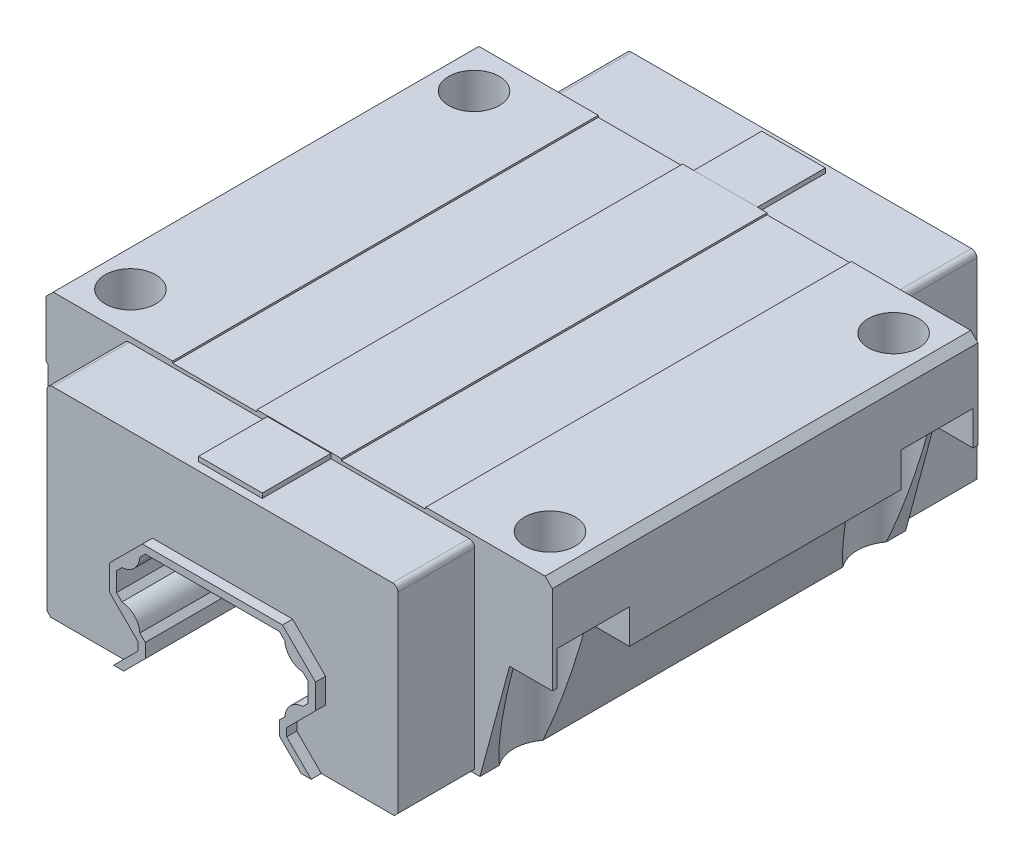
ISO-10303-21;
HEADER;
FILE_DESCRIPTION(('STEP AP214'),'2;1');
FILE_NAME('part.step','',(''),(''),'','','');
FILE_SCHEMA(('AUTOMOTIVE_DESIGN { 1 0 10303 214 1 1 1 1 }'));
ENDSEC;
DATA;
#1=APPLICATION_CONTEXT('core data for automotive mechanical design processes');
#2=APPLICATION_PROTOCOL_DEFINITION('international standard','automotive_design',2000,#1);
#3=PRODUCT_CONTEXT('',#1,'mechanical');
#4=PRODUCT('Part','Part','',(#3));
#5=PRODUCT_RELATED_PRODUCT_CATEGORY('part','',(#4));
#6=PRODUCT_DEFINITION_FORMATION('','',#4);
#7=PRODUCT_DEFINITION_CONTEXT('part definition',#1,'design');
#8=PRODUCT_DEFINITION('design','',#6,#7);
#9=PRODUCT_DEFINITION_SHAPE('','',#8);
#10=(LENGTH_UNIT() NAMED_UNIT(*) SI_UNIT(.MILLI.,.METRE.));
#11=(NAMED_UNIT(*) PLANE_ANGLE_UNIT() SI_UNIT($,.RADIAN.));
#12=(NAMED_UNIT(*) SI_UNIT($,.STERADIAN.) SOLID_ANGLE_UNIT());
#13=UNCERTAINTY_MEASURE_WITH_UNIT(LENGTH_MEASURE(1.E-05),#10,'distance_accuracy_value','');
#14=(GEOMETRIC_REPRESENTATION_CONTEXT(3) GLOBAL_UNCERTAINTY_ASSIGNED_CONTEXT((#13)) GLOBAL_UNIT_ASSIGNED_CONTEXT((#10,
#11,#12)) REPRESENTATION_CONTEXT('',''));
#15=CARTESIAN_POINT('',(0.,0.,0.));
#16=DIRECTION('',(0.,0.,1.));
#17=DIRECTION('',(1.,0.,0.));
#18=AXIS2_PLACEMENT_3D('',#15,#16,#17);
#19=CARTESIAN_POINT('',(0.,0.,-77.85));
#20=DIRECTION('',(0.,0.,1.));
#21=DIRECTION('',(1.,0.,0.));
#22=AXIS2_PLACEMENT_3D('',#19,#20,#21);
#23=PLANE('',#22);
#24=DIRECTION('',(1.,0.,0.));
#25=VECTOR('',#24,1.);
#26=CARTESIAN_POINT('',(-8.8,69.8,-77.85));
#27=LINE('',#26,#25);
#28=CARTESIAN_POINT('',(-8.8,69.8,-77.85));
#29=VERTEX_POINT('',#28);
#30=CARTESIAN_POINT('',(8.8,69.8,-77.85));
#31=VERTEX_POINT('',#30);
#32=EDGE_CURVE('E1751',#29,#31,#27,.T.);
#33=ORIENTED_EDGE('',*,*,#32,.T.);
#34=DIRECTION('',(0.,1.,0.));
#35=VECTOR('',#34,1.);
#36=CARTESIAN_POINT('',(8.8,68.5,-77.85));
#37=LINE('',#36,#35);
#38=CARTESIAN_POINT('',(8.8,68.5,-77.85));
#39=VERTEX_POINT('',#38);
#40=EDGE_CURVE('E1689',#31,#39,#37,.F.);
#41=ORIENTED_EDGE('',*,*,#40,.T.);
#42=DIRECTION('',(1.,0.,0.));
#43=VECTOR('',#42,1.);
#44=CARTESIAN_POINT('',(-48.5,68.5,-77.85));
#45=LINE('',#44,#43);
#46=CARTESIAN_POINT('',(-8.8,68.5,-77.85));
#47=VERTEX_POINT('',#46);
#48=EDGE_CURVE('E1450',#39,#47,#45,.F.);
#49=ORIENTED_EDGE('',*,*,#48,.T.);
#50=DIRECTION('',(0.,1.,0.));
#51=VECTOR('',#50,1.);
#52=CARTESIAN_POINT('',(-8.8,68.5,-77.85));
#53=LINE('',#52,#51);
#54=EDGE_CURVE('E1703',#47,#29,#53,.T.);
#55=ORIENTED_EDGE('',*,*,#54,.T.);
#56=EDGE_LOOP('',(#33,#41,#49,#55));
#57=FACE_BOUND('',#56,.T.);
#58=ADVANCED_FACE('F14',(#57),#23,.F.);
#59=CARTESIAN_POINT('',(-8.8,68.5,95.49794605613));
#60=DIRECTION('',(1.,0.,0.));
#61=DIRECTION('',(0.,0.,-1.));
#62=AXIS2_PLACEMENT_3D('',#59,#60,#61);
#63=PLANE('',#62);
#64=DIRECTION('',(0.,1.,0.));
#65=VECTOR('',#64,1.);
#66=CARTESIAN_POINT('',(-8.8,68.5,-58.85));
#67=LINE('',#66,#65);
#68=CARTESIAN_POINT('',(-8.8,69.8,-58.85));
#69=VERTEX_POINT('',#68);
#70=CARTESIAN_POINT('',(-8.8,68.5,-58.85));
#71=VERTEX_POINT('',#70);
#72=EDGE_CURVE('E1694',#69,#71,#67,.F.);
#73=ORIENTED_EDGE('',*,*,#72,.F.);
#74=DIRECTION('',(0.,0.,-1.));
#75=VECTOR('',#74,1.);
#76=CARTESIAN_POINT('',(-8.8,69.8,95.49794605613));
#77=LINE('',#76,#75);
#78=EDGE_CURVE('E1455',#69,#29,#77,.T.);
#79=ORIENTED_EDGE('',*,*,#78,.T.);
#80=ORIENTED_EDGE('',*,*,#54,.F.);
#81=DIRECTION('',(0.,0.,-1.));
#82=VECTOR('',#81,1.);
#83=CARTESIAN_POINT('',(-8.8,68.5,189.6053130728));
#84=LINE('',#83,#82);
#85=EDGE_CURVE('E1447',#47,#71,#84,.F.);
#86=ORIENTED_EDGE('',*,*,#85,.T.);
#87=EDGE_LOOP('',(#73,#79,#80,#86));
#88=FACE_BOUND('',#87,.T.);
#89=ADVANCED_FACE('F1915',(#88),#63,.F.);
#90=CARTESIAN_POINT('',(8.8,68.5,95.49794605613));
#91=DIRECTION('',(-1.,0.,0.));
#92=DIRECTION('',(0.,0.,1.));
#93=AXIS2_PLACEMENT_3D('',#90,#91,#92);
#94=PLANE('',#93);
#95=DIRECTION('',(0.,1.,0.));
#96=VECTOR('',#95,1.);
#97=CARTESIAN_POINT('',(8.8,68.5,-58.85));
#98=LINE('',#97,#96);
#99=CARTESIAN_POINT('',(8.8,68.5,-58.85));
#100=VERTEX_POINT('',#99);
#101=CARTESIAN_POINT('',(8.8,69.8,-58.85));
#102=VERTEX_POINT('',#101);
#103=EDGE_CURVE('E1661',#100,#102,#98,.T.);
#104=ORIENTED_EDGE('',*,*,#103,.F.);
#105=DIRECTION('',(0.,0.,-1.));
#106=VECTOR('',#105,1.);
#107=CARTESIAN_POINT('',(8.8,68.5,189.6053130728));
#108=LINE('',#107,#106);
#109=EDGE_CURVE('E1439',#100,#39,#108,.T.);
#110=ORIENTED_EDGE('',*,*,#109,.T.);
#111=ORIENTED_EDGE('',*,*,#40,.F.);
#112=DIRECTION('',(0.,0.,-1.));
#113=VECTOR('',#112,1.);
#114=CARTESIAN_POINT('',(8.8,69.8,95.49794605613));
#115=LINE('',#114,#113);
#116=EDGE_CURVE('E1699',#31,#102,#115,.F.);
#117=ORIENTED_EDGE('',*,*,#116,.T.);
#118=EDGE_LOOP('',(#104,#110,#111,#117));
#119=FACE_BOUND('',#118,.T.);
#120=ADVANCED_FACE('F1906',(#119),#94,.F.);
#121=CARTESIAN_POINT('',(-69.5,43.5,-77.85005));
#122=DIRECTION('',(1.,0.,0.));
#123=DIRECTION('',(0.,0.,-1.));
#124=AXIS2_PLACEMENT_3D('',#121,#122,#123);
#125=PLANE('',#124);
#126=DIRECTION('',(0.,0.,1.));
#127=VECTOR('',#126,1.);
#128=CARTESIAN_POINT('',(-69.5,52.,-77.85005));
#129=LINE('',#128,#127);
#130=CARTESIAN_POINT('',(-69.5,52.,37.5));
#131=VERTEX_POINT('',#130);
#132=CARTESIAN_POINT('',(-69.5,52.,-37.5));
#133=VERTEX_POINT('',#132);
#134=EDGE_CURVE('E1596',#131,#133,#129,.F.);
#135=ORIENTED_EDGE('',*,*,#134,.T.);
#136=DIRECTION('',(0.,1.,0.));
#137=VECTOR('',#136,1.);
#138=CARTESIAN_POINT('',(-69.5,13.,-37.5));
#139=LINE('',#138,#137);
#140=CARTESIAN_POINT('',(-69.5,43.5,-37.5));
#141=VERTEX_POINT('',#140);
#142=EDGE_CURVE('E1406',#133,#141,#139,.F.);
#143=ORIENTED_EDGE('',*,*,#142,.T.);
#144=DIRECTION('',(0.,0.,1.));
#145=VECTOR('',#144,1.);
#146=CARTESIAN_POINT('',(-69.5,43.5,-77.85005));
#147=LINE('',#146,#145);
#148=CARTESIAN_POINT('',(-69.5,43.5,37.5));
#149=VERTEX_POINT('',#148);
#150=EDGE_CURVE('E1375',#141,#149,#147,.T.);
#151=ORIENTED_EDGE('',*,*,#150,.T.);
#152=DIRECTION('',(0.,1.,0.));
#153=VECTOR('',#152,1.);
#154=CARTESIAN_POINT('',(-69.5,13.,37.5));
#155=LINE('',#154,#153);
#156=EDGE_CURVE('E1380',#149,#131,#155,.T.);
#157=ORIENTED_EDGE('',*,*,#156,.T.);
#158=EDGE_LOOP('',(#135,#143,#151,#157));
#159=FACE_BOUND('',#158,.T.);
#160=ADVANCED_FACE('F2292',(#159),#125,.F.);
#161=CARTESIAN_POINT('',(-70.,52.5,-77.85005));
#162=DIRECTION('',(0.707106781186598,0.707106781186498,0.));
#163=DIRECTION('',(-0.707106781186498,0.707106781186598,0.));
#164=AXIS2_PLACEMENT_3D('',#161,#162,#163);
#165=PLANE('',#164);
#166=DIRECTION('',(0.,0.,-1.));
#167=VECTOR('',#166,1.);
#168=CARTESIAN_POINT('',(-70.,52.5,210.0088568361));
#169=LINE('',#168,#167);
#170=CARTESIAN_POINT('',(-70.,52.5,37.5));
#171=VERTEX_POINT('',#170);
#172=CARTESIAN_POINT('',(-70.,52.5,-37.5));
#173=VERTEX_POINT('',#172);
#174=EDGE_CURVE('E1636',#171,#173,#169,.T.);
#175=ORIENTED_EDGE('',*,*,#174,.T.);
#176=DIRECTION('',(0.707106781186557,-0.707106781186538,0.));
#177=VECTOR('',#176,1.);
#178=CARTESIAN_POINT('',(-70.,52.5,-37.5));
#179=LINE('',#178,#177);
#180=EDGE_CURVE('E1405',#173,#133,#179,.T.);
#181=ORIENTED_EDGE('',*,*,#180,.T.);
#182=ORIENTED_EDGE('',*,*,#134,.F.);
#183=DIRECTION('',(-0.707106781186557,0.707106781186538,0.));
#184=VECTOR('',#183,1.);
#185=CARTESIAN_POINT('',(-69.5,52.,37.5));
#186=LINE('',#185,#184);
#187=EDGE_CURVE('E1369',#131,#171,#186,.T.);
#188=ORIENTED_EDGE('',*,*,#187,.T.);
#189=EDGE_LOOP('',(#175,#181,#182,#188));
#190=FACE_BOUND('',#189,.T.);
#191=ADVANCED_FACE('F2802',(#190),#165,.F.);
#192=CARTESIAN_POINT('',(58.,70.,47.5));
#193=DIRECTION('',(0.,1.,0.));
#194=DIRECTION('',(0.,0.,1.));
#195=AXIS2_PLACEMENT_3D('',#192,#193,#194);
#196=CYLINDRICAL_SURFACE('',#195,7.);
#197=CARTESIAN_POINT('',(58.,70.,47.5));
#198=DIRECTION('',(0.,1.,0.));
#199=DIRECTION('',(0.,0.,1.));
#200=AXIS2_PLACEMENT_3D('',#197,#198,#199);
#201=CIRCLE('',#200,7.);
#202=CARTESIAN_POINT('',(58.,70.,54.5));
#203=VERTEX_POINT('',#202);
#204=EDGE_CURVE('E1267',#203,#203,#201,.T.);
#205=ORIENTED_EDGE('',*,*,#204,.T.);
#206=EDGE_LOOP('',(#205));
#207=FACE_BOUND('',#206,.T.);
#208=CARTESIAN_POINT('',(58.,53.,47.5));
#209=DIRECTION('',(0.,1.,0.));
#210=DIRECTION('',(0.,0.,1.));
#211=AXIS2_PLACEMENT_3D('',#208,#209,#210);
#212=CIRCLE('',#211,7.);
#213=CARTESIAN_POINT('',(58.,53.,54.5));
#214=VERTEX_POINT('',#213);
#215=EDGE_CURVE('E17',#214,#214,#212,.T.);
#216=ORIENTED_EDGE('',*,*,#215,.F.);
#217=EDGE_LOOP('',(#216));
#218=FACE_BOUND('',#217,.T.);
#219=ADVANCED_FACE('F2798',(#207,#218),#196,.F.);
#220=CARTESIAN_POINT('',(58.,70.,-47.5));
#221=DIRECTION('',(0.,1.,0.));
#222=DIRECTION('',(0.,0.,1.));
#223=AXIS2_PLACEMENT_3D('',#220,#221,#222);
#224=CYLINDRICAL_SURFACE('',#223,7.);
#225=CARTESIAN_POINT('',(58.,70.,-47.5));
#226=DIRECTION('',(0.,1.,0.));
#227=DIRECTION('',(0.,0.,1.));
#228=AXIS2_PLACEMENT_3D('',#225,#226,#227);
#229=CIRCLE('',#228,7.);
#230=CARTESIAN_POINT('',(58.,70.,-40.5));
#231=VERTEX_POINT('',#230);
#232=EDGE_CURVE('E1263',#231,#231,#229,.T.);
#233=ORIENTED_EDGE('',*,*,#232,.T.);
#234=EDGE_LOOP('',(#233));
#235=FACE_BOUND('',#234,.T.);
#236=CARTESIAN_POINT('',(58.,53.,-47.5));
#237=DIRECTION('',(0.,1.,0.));
#238=DIRECTION('',(0.,0.,1.));
#239=AXIS2_PLACEMENT_3D('',#236,#237,#238);
#240=CIRCLE('',#239,7.);
#241=CARTESIAN_POINT('',(58.,53.,-40.5));
#242=VERTEX_POINT('',#241);
#243=EDGE_CURVE('E1477',#242,#242,#240,.F.);
#244=ORIENTED_EDGE('',*,*,#243,.T.);
#245=EDGE_LOOP('',(#244));
#246=FACE_BOUND('',#245,.T.);
#247=ADVANCED_FACE('F1854',(#235,#246),#224,.F.);
#248=CARTESIAN_POINT('',(35.,69.5,-58.85));
#249=DIRECTION('',(1.,0.,0.));
#250=DIRECTION('',(0.,0.,-1.));
#251=AXIS2_PLACEMENT_3D('',#248,#249,#250);
#252=PLANE('',#251);
#253=DIRECTION('',(0.,0.,-1.));
#254=VECTOR('',#253,1.);
#255=CARTESIAN_POINT('',(35.,69.5,-58.85));
#256=LINE('',#255,#254);
#257=CARTESIAN_POINT('',(35.,69.5,-58.85));
#258=VERTEX_POINT('',#257);
#259=CARTESIAN_POINT('',(35.,69.5,58.85));
#260=VERTEX_POINT('',#259);
#261=EDGE_CURVE('E1260',#258,#260,#256,.F.);
#262=ORIENTED_EDGE('',*,*,#261,.T.);
#263=DIRECTION('',(0.,1.,0.));
#264=VECTOR('',#263,1.);
#265=CARTESIAN_POINT('',(35.,69.5,58.85));
#266=LINE('',#265,#264);
#267=CARTESIAN_POINT('',(35.,70.,58.85));
#268=VERTEX_POINT('',#267);
#269=EDGE_CURVE('E1594',#268,#260,#266,.F.);
#270=ORIENTED_EDGE('',*,*,#269,.F.);
#271=DIRECTION('',(0.,0.,-1.));
#272=VECTOR('',#271,1.);
#273=CARTESIAN_POINT('',(35.,70.,210.0088568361));
#274=LINE('',#273,#272);
#275=CARTESIAN_POINT('',(35.,70.,-58.85));
#276=VERTEX_POINT('',#275);
#277=EDGE_CURVE('E1268',#268,#276,#274,.T.);
#278=ORIENTED_EDGE('',*,*,#277,.T.);
#279=DIRECTION('',(0.,1.,0.));
#280=VECTOR('',#279,1.);
#281=CARTESIAN_POINT('',(35.,69.5,-58.85));
#282=LINE('',#281,#280);
#283=EDGE_CURVE('E1592',#258,#276,#282,.T.);
#284=ORIENTED_EDGE('',*,*,#283,.F.);
#285=EDGE_LOOP('',(#262,#270,#278,#284));
#286=FACE_BOUND('',#285,.T.);
#287=ADVANCED_FACE('F1998',(#286),#252,.F.);
#288=CARTESIAN_POINT('',(11.66666666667,69.5,-58.85));
#289=DIRECTION('',(-1.,0.,0.));
#290=DIRECTION('',(0.,0.,1.));
#291=AXIS2_PLACEMENT_3D('',#288,#289,#290);
#292=PLANE('',#291);
#293=DIRECTION('',(0.,0.,-1.));
#294=VECTOR('',#293,1.);
#295=CARTESIAN_POINT('',(11.66666666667,69.5,-58.85));
#296=LINE('',#295,#294);
#297=CARTESIAN_POINT('',(11.66666666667,69.5,58.85));
#298=VERTEX_POINT('',#297);
#299=CARTESIAN_POINT('',(11.66666666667,69.5,-58.85));
#300=VERTEX_POINT('',#299);
#301=EDGE_CURVE('E1257',#298,#300,#296,.T.);
#302=ORIENTED_EDGE('',*,*,#301,.T.);
#303=DIRECTION('',(0.,1.,0.));
#304=VECTOR('',#303,1.);
#305=CARTESIAN_POINT('',(11.66666666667,69.5,-58.85));
#306=LINE('',#305,#304);
#307=CARTESIAN_POINT('',(11.66666666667,70.,-58.85));
#308=VERTEX_POINT('',#307);
#309=EDGE_CURVE('E1590',#308,#300,#306,.F.);
#310=ORIENTED_EDGE('',*,*,#309,.F.);
#311=DIRECTION('',(0.,0.,-1.));
#312=VECTOR('',#311,1.);
#313=CARTESIAN_POINT('',(11.66666666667,70.,210.0088568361));
#314=LINE('',#313,#312);
#315=CARTESIAN_POINT('',(11.66666666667,70.,58.85));
#316=VERTEX_POINT('',#315);
#317=EDGE_CURVE('E1254',#308,#316,#314,.F.);
#318=ORIENTED_EDGE('',*,*,#317,.T.);
#319=DIRECTION('',(0.,1.,0.));
#320=VECTOR('',#319,1.);
#321=CARTESIAN_POINT('',(11.66666666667,69.5,58.85));
#322=LINE('',#321,#320);
#323=EDGE_CURVE('E1588',#298,#316,#322,.T.);
#324=ORIENTED_EDGE('',*,*,#323,.F.);
#325=EDGE_LOOP('',(#302,#310,#318,#324));
#326=FACE_BOUND('',#325,.T.);
#327=ADVANCED_FACE('F1988',(#326),#292,.F.);
#328=CARTESIAN_POINT('',(-11.66666666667,69.5,-58.85));
#329=DIRECTION('',(1.,0.,0.));
#330=DIRECTION('',(0.,0.,-1.));
#331=AXIS2_PLACEMENT_3D('',#328,#329,#330);
#332=PLANE('',#331);
#333=DIRECTION('',(0.,0.,-1.));
#334=VECTOR('',#333,1.);
#335=CARTESIAN_POINT('',(-11.66666666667,69.5,-58.85));
#336=LINE('',#335,#334);
#337=CARTESIAN_POINT('',(-11.66666666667,69.5,-58.85));
#338=VERTEX_POINT('',#337);
#339=CARTESIAN_POINT('',(-11.66666666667,69.5,58.85));
#340=VERTEX_POINT('',#339);
#341=EDGE_CURVE('E1248',#338,#340,#336,.F.);
#342=ORIENTED_EDGE('',*,*,#341,.T.);
#343=DIRECTION('',(0.,1.,0.));
#344=VECTOR('',#343,1.);
#345=CARTESIAN_POINT('',(-11.66666666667,69.5,58.85));
#346=LINE('',#345,#344);
#347=CARTESIAN_POINT('',(-11.66666666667,70.,58.85));
#348=VERTEX_POINT('',#347);
#349=EDGE_CURVE('E1586',#348,#340,#346,.F.);
#350=ORIENTED_EDGE('',*,*,#349,.F.);
#351=DIRECTION('',(0.,0.,-1.));
#352=VECTOR('',#351,1.);
#353=CARTESIAN_POINT('',(-11.66666666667,70.,210.0088568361));
#354=LINE('',#353,#352);
#355=CARTESIAN_POINT('',(-11.66666666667,70.,-58.85));
#356=VERTEX_POINT('',#355);
#357=EDGE_CURVE('E1251',#348,#356,#354,.T.);
#358=ORIENTED_EDGE('',*,*,#357,.T.);
#359=DIRECTION('',(0.,1.,0.));
#360=VECTOR('',#359,1.);
#361=CARTESIAN_POINT('',(-11.66666666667,69.5,-58.85));
#362=LINE('',#361,#360);
#363=EDGE_CURVE('E1584',#338,#356,#362,.T.);
#364=ORIENTED_EDGE('',*,*,#363,.F.);
#365=EDGE_LOOP('',(#342,#350,#358,#364));
#366=FACE_BOUND('',#365,.T.);
#367=ADVANCED_FACE('F1979',(#366),#332,.F.);
#368=CARTESIAN_POINT('',(-35.,69.5,-58.85));
#369=DIRECTION('',(-1.,0.,0.));
#370=DIRECTION('',(0.,0.,1.));
#371=AXIS2_PLACEMENT_3D('',#368,#369,#370);
#372=PLANE('',#371);
#373=DIRECTION('',(0.,0.,-1.));
#374=VECTOR('',#373,1.);
#375=CARTESIAN_POINT('',(-35.,69.5,-58.85));
#376=LINE('',#375,#374);
#377=CARTESIAN_POINT('',(-35.,69.5,58.85));
#378=VERTEX_POINT('',#377);
#379=CARTESIAN_POINT('',(-35.,69.5,-58.85));
#380=VERTEX_POINT('',#379);
#381=EDGE_CURVE('E1245',#378,#380,#376,.T.);
#382=ORIENTED_EDGE('',*,*,#381,.T.);
#383=DIRECTION('',(0.,1.,0.));
#384=VECTOR('',#383,1.);
#385=CARTESIAN_POINT('',(-35.,69.5,-58.85));
#386=LINE('',#385,#384);
#387=CARTESIAN_POINT('',(-35.,70.,-58.85));
#388=VERTEX_POINT('',#387);
#389=EDGE_CURVE('E1582',#388,#380,#386,.F.);
#390=ORIENTED_EDGE('',*,*,#389,.F.);
#391=DIRECTION('',(0.,0.,-1.));
#392=VECTOR('',#391,1.);
#393=CARTESIAN_POINT('',(-35.,70.,210.0088568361));
#394=LINE('',#393,#392);
#395=CARTESIAN_POINT('',(-35.,70.,58.85));
#396=VERTEX_POINT('',#395);
#397=EDGE_CURVE('E1241',#388,#396,#394,.F.);
#398=ORIENTED_EDGE('',*,*,#397,.T.);
#399=DIRECTION('',(0.,1.,0.));
#400=VECTOR('',#399,1.);
#401=CARTESIAN_POINT('',(-35.,69.5,58.85));
#402=LINE('',#401,#400);
#403=EDGE_CURVE('E1574',#378,#396,#402,.T.);
#404=ORIENTED_EDGE('',*,*,#403,.F.);
#405=EDGE_LOOP('',(#382,#390,#398,#404));
#406=FACE_BOUND('',#405,.T.);
#407=ADVANCED_FACE('F1973',(#406),#372,.F.);
#408=CARTESIAN_POINT('',(-58.,70.,-47.5));
#409=DIRECTION('',(0.,1.,0.));
#410=DIRECTION('',(0.,0.,1.));
#411=AXIS2_PLACEMENT_3D('',#408,#409,#410);
#412=CYLINDRICAL_SURFACE('',#411,7.);
#413=CARTESIAN_POINT('',(-58.,70.,-47.5));
#414=DIRECTION('',(0.,1.,0.));
#415=DIRECTION('',(0.,0.,1.));
#416=AXIS2_PLACEMENT_3D('',#413,#414,#415);
#417=CIRCLE('',#416,7.);
#418=CARTESIAN_POINT('',(-58.,70.,-40.5));
#419=VERTEX_POINT('',#418);
#420=EDGE_CURVE('E1354',#419,#419,#417,.T.);
#421=ORIENTED_EDGE('',*,*,#420,.T.);
#422=EDGE_LOOP('',(#421));
#423=FACE_BOUND('',#422,.T.);
#424=CARTESIAN_POINT('',(-58.,53.,-47.5));
#425=DIRECTION('',(0.,1.,0.));
#426=DIRECTION('',(0.,0.,1.));
#427=AXIS2_PLACEMENT_3D('',#424,#425,#426);
#428=CIRCLE('',#427,7.);
#429=CARTESIAN_POINT('',(-58.,53.,-40.5));
#430=VERTEX_POINT('',#429);
#431=EDGE_CURVE('E1391',#430,#430,#428,.T.);
#432=ORIENTED_EDGE('',*,*,#431,.F.);
#433=EDGE_LOOP('',(#432));
#434=FACE_BOUND('',#433,.T.);
#435=ADVANCED_FACE('F2783',(#423,#434),#412,.F.);
#436=CARTESIAN_POINT('',(-58.,70.,47.5));
#437=DIRECTION('',(0.,1.,0.));
#438=DIRECTION('',(0.,0.,1.));
#439=AXIS2_PLACEMENT_3D('',#436,#437,#438);
#440=CYLINDRICAL_SURFACE('',#439,7.);
#441=CARTESIAN_POINT('',(-58.,70.,47.5));
#442=DIRECTION('',(0.,1.,0.));
#443=DIRECTION('',(0.,0.,1.));
#444=AXIS2_PLACEMENT_3D('',#441,#442,#443);
#445=CIRCLE('',#444,7.);
#446=CARTESIAN_POINT('',(-58.,70.,54.5));
#447=VERTEX_POINT('',#446);
#448=EDGE_CURVE('E1285',#447,#447,#445,.T.);
#449=ORIENTED_EDGE('',*,*,#448,.T.);
#450=EDGE_LOOP('',(#449));
#451=FACE_BOUND('',#450,.T.);
#452=CARTESIAN_POINT('',(-58.,53.,47.5));
#453=DIRECTION('',(0.,1.,0.));
#454=DIRECTION('',(0.,0.,1.));
#455=AXIS2_PLACEMENT_3D('',#452,#453,#454);
#456=CIRCLE('',#455,7.);
#457=CARTESIAN_POINT('',(-58.,53.,54.5));
#458=VERTEX_POINT('',#457);
#459=EDGE_CURVE('E1364',#458,#458,#456,.F.);
#460=ORIENTED_EDGE('',*,*,#459,.T.);
#461=EDGE_LOOP('',(#460));
#462=FACE_BOUND('',#461,.T.);
#463=ADVANCED_FACE('F2369',(#451,#462),#440,.F.);
#464=CARTESIAN_POINT('',(0.,0.,77.85));
#465=DIRECTION('',(0.,0.,1.));
#466=DIRECTION('',(1.,0.,0.));
#467=AXIS2_PLACEMENT_3D('',#464,#465,#466);
#468=PLANE('',#467);
#469=DIRECTION('',(0.,1.,0.));
#470=VECTOR('',#469,1.);
#471=CARTESIAN_POINT('',(-8.8,68.5,77.85));
#472=LINE('',#471,#470);
#473=CARTESIAN_POINT('',(-8.8,69.8,77.85));
#474=VERTEX_POINT('',#473);
#475=CARTESIAN_POINT('',(-8.8,68.5,77.85));
#476=VERTEX_POINT('',#475);
#477=EDGE_CURVE('E1557',#474,#476,#472,.F.);
#478=ORIENTED_EDGE('',*,*,#477,.T.);
#479=DIRECTION('',(1.,0.,0.));
#480=VECTOR('',#479,1.);
#481=CARTESIAN_POINT('',(-48.5,68.5,77.85));
#482=LINE('',#481,#480);
#483=CARTESIAN_POINT('',(8.8,68.5,77.85));
#484=VERTEX_POINT('',#483);
#485=EDGE_CURVE('E1284',#476,#484,#482,.T.);
#486=ORIENTED_EDGE('',*,*,#485,.T.);
#487=DIRECTION('',(0.,1.,0.));
#488=VECTOR('',#487,1.);
#489=CARTESIAN_POINT('',(8.8,68.5,77.85));
#490=LINE('',#489,#488);
#491=CARTESIAN_POINT('',(8.8,69.8,77.85));
#492=VERTEX_POINT('',#491);
#493=EDGE_CURVE('E1570',#484,#492,#490,.T.);
#494=ORIENTED_EDGE('',*,*,#493,.T.);
#495=DIRECTION('',(1.,0.,0.));
#496=VECTOR('',#495,1.);
#497=CARTESIAN_POINT('',(-8.8,69.8,77.85));
#498=LINE('',#497,#496);
#499=EDGE_CURVE('E1734',#492,#474,#498,.F.);
#500=ORIENTED_EDGE('',*,*,#499,.T.);
#501=EDGE_LOOP('',(#478,#486,#494,#500));
#502=FACE_BOUND('',#501,.T.);
#503=ADVANCED_FACE('F2365',(#502),#468,.T.);
#504=CARTESIAN_POINT('',(8.8,68.5,95.49794605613));
#505=DIRECTION('',(-1.,0.,0.));
#506=DIRECTION('',(0.,0.,1.));
#507=AXIS2_PLACEMENT_3D('',#504,#505,#506);
#508=PLANE('',#507);
#509=DIRECTION('',(0.,1.,0.));
#510=VECTOR('',#509,1.);
#511=CARTESIAN_POINT('',(8.8,68.5,58.85));
#512=LINE('',#511,#510);
#513=CARTESIAN_POINT('',(8.8,69.8,58.85));
#514=VERTEX_POINT('',#513);
#515=CARTESIAN_POINT('',(8.8,68.5,58.85));
#516=VERTEX_POINT('',#515);
#517=EDGE_CURVE('E1562',#514,#516,#512,.F.);
#518=ORIENTED_EDGE('',*,*,#517,.F.);
#519=DIRECTION('',(0.,0.,-1.));
#520=VECTOR('',#519,1.);
#521=CARTESIAN_POINT('',(8.8,69.8,95.49794605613));
#522=LINE('',#521,#520);
#523=EDGE_CURVE('E1312',#514,#492,#522,.F.);
#524=ORIENTED_EDGE('',*,*,#523,.T.);
#525=ORIENTED_EDGE('',*,*,#493,.F.);
#526=DIRECTION('',(0.,0.,-1.));
#527=VECTOR('',#526,1.);
#528=CARTESIAN_POINT('',(8.8,68.5,189.6053130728));
#529=LINE('',#528,#527);
#530=EDGE_CURVE('E1226',#484,#516,#529,.T.);
#531=ORIENTED_EDGE('',*,*,#530,.T.);
#532=EDGE_LOOP('',(#518,#524,#525,#531));
#533=FACE_BOUND('',#532,.T.);
#534=ADVANCED_FACE('F2358',(#533),#508,.F.);
#535=CARTESIAN_POINT('',(-8.8,68.5,95.49794605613));
#536=DIRECTION('',(1.,0.,0.));
#537=DIRECTION('',(0.,0.,-1.));
#538=AXIS2_PLACEMENT_3D('',#535,#536,#537);
#539=PLANE('',#538);
#540=DIRECTION('',(0.,1.,0.));
#541=VECTOR('',#540,1.);
#542=CARTESIAN_POINT('',(-8.8,68.5,58.85));
#543=LINE('',#542,#541);
#544=CARTESIAN_POINT('',(-8.8,68.5,58.85));
#545=VERTEX_POINT('',#544);
#546=CARTESIAN_POINT('',(-8.8,69.8,58.85));
#547=VERTEX_POINT('',#546);
#548=EDGE_CURVE('E1547',#545,#547,#543,.T.);
#549=ORIENTED_EDGE('',*,*,#548,.F.);
#550=DIRECTION('',(0.,0.,-1.));
#551=VECTOR('',#550,1.);
#552=CARTESIAN_POINT('',(-8.8,68.5,189.6053130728));
#553=LINE('',#552,#551);
#554=EDGE_CURVE('E1225',#545,#476,#553,.F.);
#555=ORIENTED_EDGE('',*,*,#554,.T.);
#556=ORIENTED_EDGE('',*,*,#477,.F.);
#557=DIRECTION('',(0.,0.,-1.));
#558=VECTOR('',#557,1.);
#559=CARTESIAN_POINT('',(-8.8,69.8,95.49794605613));
#560=LINE('',#559,#558);
#561=EDGE_CURVE('E1553',#474,#547,#560,.T.);
#562=ORIENTED_EDGE('',*,*,#561,.T.);
#563=EDGE_LOOP('',(#549,#555,#556,#562));
#564=FACE_BOUND('',#563,.T.);
#565=ADVANCED_FACE('F2354',(#564),#539,.F.);
#566=CARTESIAN_POINT('',(70.,13.,37.5));
#567=DIRECTION('',(0.,0.,-1.));
#568=DIRECTION('',(-1.,0.,0.));
#569=AXIS2_PLACEMENT_3D('',#566,#567,#568);
#570=PLANE('',#569);
#571=DIRECTION('',(1.,0.,0.));
#572=VECTOR('',#571,1.);
#573=CARTESIAN_POINT('',(58.,53.,37.5));
#574=LINE('',#573,#572);
#575=CARTESIAN_POINT('',(58.,53.,37.5));
#576=VERTEX_POINT('',#575);
#577=CARTESIAN_POINT('',(70.,53.,37.5));
#578=VERTEX_POINT('',#577);
#579=EDGE_CURVE('E1537',#576,#578,#574,.T.);
#580=ORIENTED_EDGE('',*,*,#579,.F.);
#581=DIRECTION('',(0.,1.,0.));
#582=VECTOR('',#581,1.);
#583=CARTESIAN_POINT('',(58.,13.,37.5));
#584=LINE('',#583,#582);
#585=CARTESIAN_POINT('',(58.,42.8564064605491,37.5));
#586=VERTEX_POINT('',#585);
#587=EDGE_CURVE('E670',#576,#586,#584,.F.);
#588=ORIENTED_EDGE('',*,*,#587,.T.);
#589=DIRECTION('',(-0.258819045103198,-0.965925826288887,0.));
#590=VECTOR('',#589,1.);
#591=CARTESIAN_POINT('',(58.17245036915,43.5,37.5));
#592=LINE('',#591,#590);
#593=CARTESIAN_POINT('',(58.17245036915,43.5,37.5));
#594=VERTEX_POINT('',#593);
#595=EDGE_CURVE('E1543',#594,#586,#592,.T.);
#596=ORIENTED_EDGE('',*,*,#595,.F.);
#597=DIRECTION('',(1.,0.,0.));
#598=VECTOR('',#597,1.);
#599=CARTESIAN_POINT('',(70.,43.5,37.5));
#600=LINE('',#599,#598);
#601=CARTESIAN_POINT('',(70.,43.5,37.5));
#602=VERTEX_POINT('',#601);
#603=EDGE_CURVE('E1523',#594,#602,#600,.T.);
#604=ORIENTED_EDGE('',*,*,#603,.T.);
#605=DIRECTION('',(0.,1.,0.));
#606=VECTOR('',#605,1.);
#607=CARTESIAN_POINT('',(70.,70.,37.5));
#608=LINE('',#607,#606);
#609=EDGE_CURVE('E1721',#602,#578,#608,.T.);
#610=ORIENTED_EDGE('',*,*,#609,.T.);
#611=EDGE_LOOP('',(#580,#588,#596,#604,#610));
#612=FACE_BOUND('',#611,.T.);
#613=ADVANCED_FACE('F2018',(#612),#570,.F.);
#614=CARTESIAN_POINT('',(58.,13.,57.5));
#615=DIRECTION('',(0.,0.,1.));
#616=DIRECTION('',(1.,0.,0.));
#617=AXIS2_PLACEMENT_3D('',#614,#615,#616);
#618=PLANE('',#617);
#619=DIRECTION('',(0.,1.,0.));
#620=VECTOR('',#619,1.);
#621=CARTESIAN_POINT('',(70.,70.,57.5));
#622=LINE('',#621,#620);
#623=CARTESIAN_POINT('',(70.,53.,57.5));
#624=VERTEX_POINT('',#623);
#625=CARTESIAN_POINT('',(70.,43.5,57.5));
#626=VERTEX_POINT('',#625);
#627=EDGE_CURVE('E1599',#624,#626,#622,.F.);
#628=ORIENTED_EDGE('',*,*,#627,.T.);
#629=DIRECTION('',(1.,0.,0.));
#630=VECTOR('',#629,1.);
#631=CARTESIAN_POINT('',(70.,43.5,57.5));
#632=LINE('',#631,#630);
#633=CARTESIAN_POINT('',(58.17245036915,43.5,57.5));
#634=VERTEX_POINT('',#633);
#635=EDGE_CURVE('E1550',#626,#634,#632,.F.);
#636=ORIENTED_EDGE('',*,*,#635,.T.);
#637=DIRECTION('',(-0.258819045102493,-0.965925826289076,0.));
#638=VECTOR('',#637,1.);
#639=CARTESIAN_POINT('',(58.17245036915,43.5,57.5));
#640=LINE('',#639,#638);
#641=CARTESIAN_POINT('',(58.,42.8564064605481,57.5));
#642=VERTEX_POINT('',#641);
#643=EDGE_CURVE('E1039',#634,#642,#640,.T.);
#644=ORIENTED_EDGE('',*,*,#643,.T.);
#645=DIRECTION('',(0.,1.,0.));
#646=VECTOR('',#645,1.);
#647=CARTESIAN_POINT('',(58.,13.,57.5));
#648=LINE('',#647,#646);
#649=CARTESIAN_POINT('',(58.,53.,57.5));
#650=VERTEX_POINT('',#649);
#651=EDGE_CURVE('E666',#642,#650,#648,.T.);
#652=ORIENTED_EDGE('',*,*,#651,.T.);
#653=DIRECTION('',(1.,0.,0.));
#654=VECTOR('',#653,1.);
#655=CARTESIAN_POINT('',(58.,53.,57.5));
#656=LINE('',#655,#654);
#657=EDGE_CURVE('E1539',#624,#650,#656,.F.);
#658=ORIENTED_EDGE('',*,*,#657,.F.);
#659=EDGE_LOOP('',(#628,#636,#644,#652,#658));
#660=FACE_BOUND('',#659,.T.);
#661=ADVANCED_FACE('F2011',(#660),#618,.F.);
#662=CARTESIAN_POINT('',(58.,53.,47.5));
#663=DIRECTION('',(0.,-1.,0.));
#664=DIRECTION('',(0.,0.,-1.));
#665=AXIS2_PLACEMENT_3D('',#662,#663,#664);
#666=PLANE('',#665);
#667=ORIENTED_EDGE('',*,*,#215,.T.);
#668=EDGE_LOOP('',(#667));
#669=FACE_BOUND('',#668,.T.);
#670=ORIENTED_EDGE('',*,*,#579,.T.);
#671=DIRECTION('',(0.,0.,1.));
#672=VECTOR('',#671,1.);
#673=CARTESIAN_POINT('',(70.,53.,210.0088568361));
#674=LINE('',#673,#672);
#675=EDGE_CURVE('E1604',#578,#624,#674,.T.);
#676=ORIENTED_EDGE('',*,*,#675,.T.);
#677=ORIENTED_EDGE('',*,*,#657,.T.);
#678=CARTESIAN_POINT('',(58.,53.,47.5));
#679=DIRECTION('',(0.,1.,0.));
#680=DIRECTION('',(0.,0.,1.));
#681=AXIS2_PLACEMENT_3D('',#678,#679,#680);
#682=CIRCLE('',#681,10.);
#683=EDGE_CURVE('E1036',#650,#576,#682,.F.);
#684=ORIENTED_EDGE('',*,*,#683,.T.);
#685=EDGE_LOOP('',(#670,#676,#677,#684));
#686=FACE_BOUND('',#685,.T.);
#687=ADVANCED_FACE('F2015',(#669,#686),#666,.T.);
#688=CARTESIAN_POINT('',(70.,43.5,-77.85005));
#689=DIRECTION('',(0.,1.,0.));
#690=DIRECTION('',(0.,0.,1.));
#691=AXIS2_PLACEMENT_3D('',#688,#689,#690);
#692=PLANE('',#691);
#693=DIRECTION('',(0.,0.,1.));
#694=VECTOR('',#693,1.);
#695=CARTESIAN_POINT('',(70.,43.5,210.0088568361));
#696=LINE('',#695,#694);
#697=CARTESIAN_POINT('',(70.,43.5,-37.5));
#698=VERTEX_POINT('',#697);
#699=EDGE_CURVE('E1716',#698,#602,#696,.T.);
#700=ORIENTED_EDGE('',*,*,#699,.T.);
#701=ORIENTED_EDGE('',*,*,#603,.F.);
#702=DIRECTION('',(0.,0.,1.));
#703=VECTOR('',#702,1.);
#704=CARTESIAN_POINT('',(58.17245036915,43.5,-77.85005));
#705=LINE('',#704,#703);
#706=CARTESIAN_POINT('',(58.17245036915,43.5,-37.5));
#707=VERTEX_POINT('',#706);
#708=EDGE_CURVE('E1032',#594,#707,#705,.F.);
#709=ORIENTED_EDGE('',*,*,#708,.T.);
#710=DIRECTION('',(1.,0.,0.));
#711=VECTOR('',#710,1.);
#712=CARTESIAN_POINT('',(70.,43.5,-37.5));
#713=LINE('',#712,#711);
#714=EDGE_CURVE('E1518',#707,#698,#713,.T.);
#715=ORIENTED_EDGE('',*,*,#714,.T.);
#716=EDGE_LOOP('',(#700,#701,#709,#715));
#717=FACE_BOUND('',#716,.T.);
#718=ADVANCED_FACE('F2021',(#717),#692,.F.);
#719=CARTESIAN_POINT('',(58.,13.,-57.5));
#720=DIRECTION('',(0.,0.,-1.));
#721=DIRECTION('',(-1.,0.,0.));
#722=AXIS2_PLACEMENT_3D('',#719,#720,#721);
#723=PLANE('',#722);
#724=DIRECTION('',(1.,0.,0.));
#725=VECTOR('',#724,1.);
#726=CARTESIAN_POINT('',(58.,53.,-57.5));
#727=LINE('',#726,#725);
#728=CARTESIAN_POINT('',(70.,53.,-57.5));
#729=VERTEX_POINT('',#728);
#730=CARTESIAN_POINT('',(58.,53.,-57.5));
#731=VERTEX_POINT('',#730);
#732=EDGE_CURVE('E1511',#729,#731,#727,.F.);
#733=ORIENTED_EDGE('',*,*,#732,.T.);
#734=DIRECTION('',(0.,1.,0.));
#735=VECTOR('',#734,1.);
#736=CARTESIAN_POINT('',(58.,13.,-57.5));
#737=LINE('',#736,#735);
#738=CARTESIAN_POINT('',(58.,42.8564064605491,-57.5));
#739=VERTEX_POINT('',#738);
#740=EDGE_CURVE('E1027',#731,#739,#737,.F.);
#741=ORIENTED_EDGE('',*,*,#740,.T.);
#742=DIRECTION('',(-0.258819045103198,-0.965925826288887,0.));
#743=VECTOR('',#742,1.);
#744=CARTESIAN_POINT('',(58.17245036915,43.5,-57.5));
#745=LINE('',#744,#743);
#746=CARTESIAN_POINT('',(58.17245036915,43.5,-57.5));
#747=VERTEX_POINT('',#746);
#748=EDGE_CURVE('E1521',#747,#739,#745,.T.);
#749=ORIENTED_EDGE('',*,*,#748,.F.);
#750=DIRECTION('',(1.,0.,0.));
#751=VECTOR('',#750,1.);
#752=CARTESIAN_POINT('',(70.,43.5,-57.5));
#753=LINE('',#752,#751);
#754=CARTESIAN_POINT('',(70.,43.5,-57.5));
#755=VERTEX_POINT('',#754);
#756=EDGE_CURVE('E1498',#747,#755,#753,.T.);
#757=ORIENTED_EDGE('',*,*,#756,.T.);
#758=DIRECTION('',(0.,1.,0.));
#759=VECTOR('',#758,1.);
#760=CARTESIAN_POINT('',(70.,70.,-57.5));
#761=LINE('',#760,#759);
#762=EDGE_CURVE('E1678',#755,#729,#761,.T.);
#763=ORIENTED_EDGE('',*,*,#762,.T.);
#764=EDGE_LOOP('',(#733,#741,#749,#757,#763));
#765=FACE_BOUND('',#764,.T.);
#766=ADVANCED_FACE('F1871',(#765),#723,.F.);
#767=CARTESIAN_POINT('',(70.,13.,-37.5));
#768=DIRECTION('',(0.,0.,1.));
#769=DIRECTION('',(1.,0.,0.));
#770=AXIS2_PLACEMENT_3D('',#767,#768,#769);
#771=PLANE('',#770);
#772=DIRECTION('',(0.,1.,0.));
#773=VECTOR('',#772,1.);
#774=CARTESIAN_POINT('',(70.,70.,-37.5));
#775=LINE('',#774,#773);
#776=CARTESIAN_POINT('',(70.,53.,-37.5));
#777=VERTEX_POINT('',#776);
#778=EDGE_CURVE('E1711',#777,#698,#775,.F.);
#779=ORIENTED_EDGE('',*,*,#778,.T.);
#780=ORIENTED_EDGE('',*,*,#714,.F.);
#781=DIRECTION('',(-0.258819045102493,-0.965925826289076,0.));
#782=VECTOR('',#781,1.);
#783=CARTESIAN_POINT('',(58.17245036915,43.5,-37.5));
#784=LINE('',#783,#782);
#785=CARTESIAN_POINT('',(58.,42.8564064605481,-37.5));
#786=VERTEX_POINT('',#785);
#787=EDGE_CURVE('E1030',#707,#786,#784,.T.);
#788=ORIENTED_EDGE('',*,*,#787,.T.);
#789=DIRECTION('',(0.,1.,0.));
#790=VECTOR('',#789,1.);
#791=CARTESIAN_POINT('',(58.,13.,-37.5));
#792=LINE('',#791,#790);
#793=CARTESIAN_POINT('',(58.,53.,-37.5));
#794=VERTEX_POINT('',#793);
#795=EDGE_CURVE('E1022',#786,#794,#792,.T.);
#796=ORIENTED_EDGE('',*,*,#795,.T.);
#797=DIRECTION('',(1.,0.,0.));
#798=VECTOR('',#797,1.);
#799=CARTESIAN_POINT('',(58.,53.,-37.5));
#800=LINE('',#799,#798);
#801=EDGE_CURVE('E1514',#794,#777,#800,.T.);
#802=ORIENTED_EDGE('',*,*,#801,.T.);
#803=EDGE_LOOP('',(#779,#780,#788,#796,#802));
#804=FACE_BOUND('',#803,.T.);
#805=ADVANCED_FACE('F1860',(#804),#771,.F.);
#806=CARTESIAN_POINT('',(58.,53.,-47.5));
#807=DIRECTION('',(0.,1.,0.));
#808=DIRECTION('',(0.,0.,1.));
#809=AXIS2_PLACEMENT_3D('',#806,#807,#808);
#810=PLANE('',#809);
#811=ORIENTED_EDGE('',*,*,#243,.F.);
#812=EDGE_LOOP('',(#811));
#813=FACE_BOUND('',#812,.T.);
#814=DIRECTION('',(0.,0.,1.));
#815=VECTOR('',#814,1.);
#816=CARTESIAN_POINT('',(70.,53.,210.0088568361));
#817=LINE('',#816,#815);
#818=EDGE_CURVE('E1681',#729,#777,#817,.T.);
#819=ORIENTED_EDGE('',*,*,#818,.T.);
#820=ORIENTED_EDGE('',*,*,#801,.F.);
#821=CARTESIAN_POINT('',(58.,53.,-47.5));
#822=DIRECTION('',(0.,1.,0.));
#823=DIRECTION('',(0.,0.,1.));
#824=AXIS2_PLACEMENT_3D('',#821,#822,#823);
#825=CIRCLE('',#824,10.);
#826=EDGE_CURVE('E1025',#794,#731,#825,.F.);
#827=ORIENTED_EDGE('',*,*,#826,.T.);
#828=ORIENTED_EDGE('',*,*,#732,.F.);
#829=EDGE_LOOP('',(#819,#820,#827,#828));
#830=FACE_BOUND('',#829,.T.);
#831=ADVANCED_FACE('F1856',(#813,#830),#810,.F.);
#832=CARTESIAN_POINT('',(-70.,52.5,-77.85005));
#833=DIRECTION('',(0.707106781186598,0.707106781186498,0.));
#834=DIRECTION('',(-0.707106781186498,0.707106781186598,0.));
#835=AXIS2_PLACEMENT_3D('',#832,#833,#834);
#836=PLANE('',#835);
#837=DIRECTION('',(0.,0.,-1.));
#838=VECTOR('',#837,1.);
#839=CARTESIAN_POINT('',(-70.,52.5,210.0088568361));
#840=LINE('',#839,#838);
#841=CARTESIAN_POINT('',(-70.,52.5,-57.5));
#842=VERTEX_POINT('',#841);
#843=CARTESIAN_POINT('',(-70.,52.5,-58.85));
#844=VERTEX_POINT('',#843);
#845=EDGE_CURVE('E1343',#842,#844,#840,.T.);
#846=ORIENTED_EDGE('',*,*,#845,.T.);
#847=DIRECTION('',(0.707106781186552,-0.707106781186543,0.));
#848=VECTOR('',#847,1.);
#849=CARTESIAN_POINT('',(-70.,52.5,-58.85));
#850=LINE('',#849,#848);
#851=CARTESIAN_POINT('',(-69.5,52.,-58.85));
#852=VERTEX_POINT('',#851);
#853=EDGE_CURVE('E1473',#844,#852,#850,.T.);
#854=ORIENTED_EDGE('',*,*,#853,.T.);
#855=DIRECTION('',(0.,0.,-1.));
#856=VECTOR('',#855,1.);
#857=CARTESIAN_POINT('',(-69.5,52.,-77.85005));
#858=LINE('',#857,#856);
#859=CARTESIAN_POINT('',(-69.5,52.,-57.5));
#860=VERTEX_POINT('',#859);
#861=EDGE_CURVE('E1465',#852,#860,#858,.F.);
#862=ORIENTED_EDGE('',*,*,#861,.T.);
#863=DIRECTION('',(-0.707106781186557,0.707106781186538,0.));
#864=VECTOR('',#863,1.);
#865=CARTESIAN_POINT('',(-69.5,52.,-57.5));
#866=LINE('',#865,#864);
#867=EDGE_CURVE('E1400',#860,#842,#866,.T.);
#868=ORIENTED_EDGE('',*,*,#867,.T.);
#869=EDGE_LOOP('',(#846,#854,#862,#868));
#870=FACE_BOUND('',#869,.T.);
#871=ADVANCED_FACE('F1859',(#870),#836,.F.);
#872=CARTESIAN_POINT('',(-69.5,43.5,-77.85005));
#873=DIRECTION('',(1.,0.,0.));
#874=DIRECTION('',(0.,0.,-1.));
#875=AXIS2_PLACEMENT_3D('',#872,#873,#874);
#876=PLANE('',#875);
#877=ORIENTED_EDGE('',*,*,#861,.F.);
#878=DIRECTION('',(0.,1.,0.));
#879=VECTOR('',#878,1.);
#880=CARTESIAN_POINT('',(-69.5,0.,-58.85));
#881=LINE('',#880,#879);
#882=CARTESIAN_POINT('',(-69.5,43.5,-58.85));
#883=VERTEX_POINT('',#882);
#884=EDGE_CURVE('E1417',#852,#883,#881,.F.);
#885=ORIENTED_EDGE('',*,*,#884,.T.);
#886=DIRECTION('',(0.,0.,1.));
#887=VECTOR('',#886,1.);
#888=CARTESIAN_POINT('',(-69.5,43.5,-77.85005));
#889=LINE('',#888,#887);
#890=CARTESIAN_POINT('',(-69.5,43.5,-57.5));
#891=VERTEX_POINT('',#890);
#892=EDGE_CURVE('E1456',#883,#891,#889,.T.);
#893=ORIENTED_EDGE('',*,*,#892,.T.);
#894=DIRECTION('',(0.,1.,0.));
#895=VECTOR('',#894,1.);
#896=CARTESIAN_POINT('',(-69.5,13.,-57.5));
#897=LINE('',#896,#895);
#898=EDGE_CURVE('E1412',#891,#860,#897,.T.);
#899=ORIENTED_EDGE('',*,*,#898,.T.);
#900=EDGE_LOOP('',(#877,#885,#893,#899));
#901=FACE_BOUND('',#900,.T.);
#902=ADVANCED_FACE('F1947',(#901),#876,.F.);
#903=CARTESIAN_POINT('',(-70.,43.5,-77.85005));
#904=DIRECTION('',(0.,1.,0.));
#905=DIRECTION('',(0.,0.,1.));
#906=AXIS2_PLACEMENT_3D('',#903,#904,#905);
#907=PLANE('',#906);
#908=DIRECTION('',(1.,0.,0.));
#909=VECTOR('',#908,1.);
#910=CARTESIAN_POINT('',(0.,43.5,-58.85));
#911=LINE('',#910,#909);
#912=CARTESIAN_POINT('',(-58.17245036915,43.5,-58.85));
#913=VERTEX_POINT('',#912);
#914=EDGE_CURVE('E950',#883,#913,#911,.T.);
#915=ORIENTED_EDGE('',*,*,#914,.T.);
#916=DIRECTION('',(0.,0.,1.));
#917=VECTOR('',#916,1.);
#918=CARTESIAN_POINT('',(-58.17245036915,43.5,-77.85005));
#919=LINE('',#918,#917);
#920=CARTESIAN_POINT('',(-58.17245036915,43.5,-57.5));
#921=VERTEX_POINT('',#920);
#922=EDGE_CURVE('E1463',#921,#913,#919,.F.);
#923=ORIENTED_EDGE('',*,*,#922,.F.);
#924=DIRECTION('',(-1.,0.,0.));
#925=VECTOR('',#924,1.);
#926=CARTESIAN_POINT('',(-58.,43.5,-57.5));
#927=LINE('',#926,#925);
#928=EDGE_CURVE('E1409',#921,#891,#927,.T.);
#929=ORIENTED_EDGE('',*,*,#928,.T.);
#930=ORIENTED_EDGE('',*,*,#892,.F.);
#931=EDGE_LOOP('',(#915,#923,#929,#930));
#932=FACE_BOUND('',#931,.T.);
#933=ADVANCED_FACE('F1944',(#932),#907,.F.);
#934=CARTESIAN_POINT('',(-48.5,68.5,189.6053130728));
#935=DIRECTION('',(1.,0.,0.));
#936=DIRECTION('',(0.,0.,-1.));
#937=AXIS2_PLACEMENT_3D('',#934,#935,#936);
#938=PLANE('',#937);
#939=DIRECTION('',(0.,0.,-1.));
#940=VECTOR('',#939,1.);
#941=CARTESIAN_POINT('',(-48.5,67.,189.6053130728));
#942=LINE('',#941,#940);
#943=CARTESIAN_POINT('',(-48.5,67.,-80.05));
#944=VERTEX_POINT('',#943);
#945=CARTESIAN_POINT('',(-48.5,67.,-58.85));
#946=VERTEX_POINT('',#945);
#947=EDGE_CURVE('E1453',#944,#946,#942,.F.);
#948=ORIENTED_EDGE('',*,*,#947,.F.);
#949=DIRECTION('',(0.,1.,0.));
#950=VECTOR('',#949,1.);
#951=CARTESIAN_POINT('',(-48.5,68.5,-80.05));
#952=LINE('',#951,#950);
#953=CARTESIAN_POINT('',(-48.5,14.,-80.05));
#954=VERTEX_POINT('',#953);
#955=EDGE_CURVE('E977',#954,#944,#952,.T.);
#956=ORIENTED_EDGE('',*,*,#955,.F.);
#957=DIRECTION('',(0.,0.,1.));
#958=VECTOR('',#957,1.);
#959=CARTESIAN_POINT('',(-48.5,14.,-77.85005));
#960=LINE('',#959,#958);
#961=CARTESIAN_POINT('',(-48.5,14.,-58.85));
#962=VERTEX_POINT('',#961);
#963=EDGE_CURVE('E960',#954,#962,#960,.T.);
#964=ORIENTED_EDGE('',*,*,#963,.T.);
#965=DIRECTION('',(0.,1.,0.));
#966=VECTOR('',#965,1.);
#967=CARTESIAN_POINT('',(-48.5,0.,-58.85));
#968=LINE('',#967,#966);
#969=EDGE_CURVE('E942',#962,#946,#968,.T.);
#970=ORIENTED_EDGE('',*,*,#969,.T.);
#971=EDGE_LOOP('',(#948,#956,#964,#970));
#972=FACE_BOUND('',#971,.T.);
#973=ADVANCED_FACE('F1922',(#972),#938,.F.);
#974=CARTESIAN_POINT('',(-47.,67.,189.6053130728));
#975=DIRECTION('',(0.,0.,-1.));
#976=DIRECTION('',(-1.,0.,0.));
#977=AXIS2_PLACEMENT_3D('',#974,#975,#976);
#978=CYLINDRICAL_SURFACE('',#977,1.5);
#979=CARTESIAN_POINT('',(-47.,67.,-80.05));
#980=DIRECTION('',(0.,0.,-1.));
#981=DIRECTION('',(-1.,0.,0.));
#982=AXIS2_PLACEMENT_3D('',#979,#980,#981);
#983=CIRCLE('',#982,1.5);
#984=CARTESIAN_POINT('',(-47.,68.5,-80.05));
#985=VERTEX_POINT('',#984);
#986=EDGE_CURVE('E976',#944,#985,#983,.T.);
#987=ORIENTED_EDGE('',*,*,#986,.F.);
#988=ORIENTED_EDGE('',*,*,#947,.T.);
#989=CARTESIAN_POINT('',(-47.,67.,-58.85));
#990=DIRECTION('',(0.,0.,-1.));
#991=DIRECTION('',(-1.,0.,0.));
#992=AXIS2_PLACEMENT_3D('',#989,#990,#991);
#993=CIRCLE('',#992,1.5);
#994=CARTESIAN_POINT('',(-47.,68.5,-58.85));
#995=VERTEX_POINT('',#994);
#996=EDGE_CURVE('E939',#946,#995,#993,.T.);
#997=ORIENTED_EDGE('',*,*,#996,.T.);
#998=DIRECTION('',(0.,0.,-1.));
#999=VECTOR('',#998,1.);
#1000=CARTESIAN_POINT('',(-47.,68.5,189.6053130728));
#1001=LINE('',#1000,#999);
#1002=EDGE_CURVE('E1444',#995,#985,#1001,.T.);
#1003=ORIENTED_EDGE('',*,*,#1002,.T.);
#1004=EDGE_LOOP('',(#987,#988,#997,#1003));
#1005=FACE_BOUND('',#1004,.T.);
#1006=ADVANCED_FACE('F1920',(#1005),#978,.T.);
#1007=CARTESIAN_POINT('',(-8.8,69.8,95.49794605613));
#1008=DIRECTION('',(0.,-1.,0.));
#1009=DIRECTION('',(0.,0.,-1.));
#1010=AXIS2_PLACEMENT_3D('',#1007,#1008,#1009);
#1011=PLANE('',#1010);
#1012=ORIENTED_EDGE('',*,*,#32,.F.);
#1013=ORIENTED_EDGE('',*,*,#78,.F.);
#1014=DIRECTION('',(1.,0.,0.));
#1015=VECTOR('',#1014,1.);
#1016=CARTESIAN_POINT('',(0.,69.8,-58.85));
#1017=LINE('',#1016,#1015);
#1018=EDGE_CURVE('E933',#69,#102,#1017,.T.);
#1019=ORIENTED_EDGE('',*,*,#1018,.T.);
#1020=ORIENTED_EDGE('',*,*,#116,.F.);
#1021=EDGE_LOOP('',(#1012,#1013,#1019,#1020));
#1022=FACE_BOUND('',#1021,.T.);
#1023=ADVANCED_FACE('F1913',(#1022),#1011,.F.);
#1024=CARTESIAN_POINT('',(-48.5,68.5,189.6053130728));
#1025=DIRECTION('',(0.,-1.,0.));
#1026=DIRECTION('',(0.,0.,-1.));
#1027=AXIS2_PLACEMENT_3D('',#1024,#1025,#1026);
#1028=PLANE('',#1027);
#1029=DIRECTION('',(1.,0.,0.));
#1030=VECTOR('',#1029,1.);
#1031=CARTESIAN_POINT('',(0.,68.5,-58.85));
#1032=LINE('',#1031,#1030);
#1033=CARTESIAN_POINT('',(47.,68.5,-58.85));
#1034=VERTEX_POINT('',#1033);
#1035=EDGE_CURVE('E930',#100,#1034,#1032,.T.);
#1036=ORIENTED_EDGE('',*,*,#1035,.T.);
#1037=DIRECTION('',(0.,0.,-1.));
#1038=VECTOR('',#1037,1.);
#1039=CARTESIAN_POINT('',(47.,68.5,189.6053130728));
#1040=LINE('',#1039,#1038);
#1041=CARTESIAN_POINT('',(47.,68.5,-80.05));
#1042=VERTEX_POINT('',#1041);
#1043=EDGE_CURVE('E1436',#1042,#1034,#1040,.F.);
#1044=ORIENTED_EDGE('',*,*,#1043,.F.);
#1045=DIRECTION('',(-1.,0.,0.));
#1046=VECTOR('',#1045,1.);
#1047=CARTESIAN_POINT('',(48.5,68.5,-80.05));
#1048=LINE('',#1047,#1046);
#1049=EDGE_CURVE('E973',#985,#1042,#1048,.F.);
#1050=ORIENTED_EDGE('',*,*,#1049,.F.);
#1051=ORIENTED_EDGE('',*,*,#1002,.F.);
#1052=DIRECTION('',(1.,0.,0.));
#1053=VECTOR('',#1052,1.);
#1054=CARTESIAN_POINT('',(0.,68.5,-58.85));
#1055=LINE('',#1054,#1053);
#1056=EDGE_CURVE('E936',#995,#71,#1055,.T.);
#1057=ORIENTED_EDGE('',*,*,#1056,.T.);
#1058=ORIENTED_EDGE('',*,*,#85,.F.);
#1059=ORIENTED_EDGE('',*,*,#48,.F.);
#1060=ORIENTED_EDGE('',*,*,#109,.F.);
#1061=EDGE_LOOP('',(#1036,#1044,#1050,#1051,#1057,#1058,#1059,#1060));
#1062=FACE_BOUND('',#1061,.T.);
#1063=ADVANCED_FACE('F1902',(#1062),#1028,.F.);
#1064=CARTESIAN_POINT('',(47.,67.,189.6053130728));
#1065=DIRECTION('',(0.,0.,-1.));
#1066=DIRECTION('',(-1.,0.,0.));
#1067=AXIS2_PLACEMENT_3D('',#1064,#1065,#1066);
#1068=CYLINDRICAL_SURFACE('',#1067,1.5);
#1069=CARTESIAN_POINT('',(47.,67.,-80.05));
#1070=DIRECTION('',(0.,0.,-1.));
#1071=DIRECTION('',(-1.,0.,0.));
#1072=AXIS2_PLACEMENT_3D('',#1069,#1070,#1071);
#1073=CIRCLE('',#1072,1.5);
#1074=CARTESIAN_POINT('',(48.5,67.,-80.05));
#1075=VERTEX_POINT('',#1074);
#1076=EDGE_CURVE('E970',#1042,#1075,#1073,.T.);
#1077=ORIENTED_EDGE('',*,*,#1076,.F.);
#1078=ORIENTED_EDGE('',*,*,#1043,.T.);
#1079=CARTESIAN_POINT('',(47.,67.,-58.85));
#1080=DIRECTION('',(0.,0.,-1.));
#1081=DIRECTION('',(-1.,0.,0.));
#1082=AXIS2_PLACEMENT_3D('',#1079,#1080,#1081);
#1083=CIRCLE('',#1082,1.5);
#1084=CARTESIAN_POINT('',(48.5,67.,-58.85));
#1085=VERTEX_POINT('',#1084);
#1086=EDGE_CURVE('E927',#1034,#1085,#1083,.T.);
#1087=ORIENTED_EDGE('',*,*,#1086,.T.);
#1088=DIRECTION('',(0.,0.,1.));
#1089=VECTOR('',#1088,1.);
#1090=CARTESIAN_POINT('',(48.5,67.,189.6053130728));
#1091=LINE('',#1090,#1089);
#1092=EDGE_CURVE('E1438',#1085,#1075,#1091,.F.);
#1093=ORIENTED_EDGE('',*,*,#1092,.T.);
#1094=EDGE_LOOP('',(#1077,#1078,#1087,#1093));
#1095=FACE_BOUND('',#1094,.T.);
#1096=ADVANCED_FACE('F1898',(#1095),#1068,.T.);
#1097=CARTESIAN_POINT('',(48.5,68.5,189.6053130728));
#1098=DIRECTION('',(-1.,0.,0.));
#1099=DIRECTION('',(0.,0.,1.));
#1100=AXIS2_PLACEMENT_3D('',#1097,#1098,#1099);
#1101=PLANE('',#1100);
#1102=DIRECTION('',(0.,0.,1.));
#1103=VECTOR('',#1102,1.);
#1104=CARTESIAN_POINT('',(48.5,14.,-77.85005));
#1105=LINE('',#1104,#1103);
#1106=CARTESIAN_POINT('',(48.5,14.,-58.85));
#1107=VERTEX_POINT('',#1106);
#1108=CARTESIAN_POINT('',(48.5,14.,-80.05));
#1109=VERTEX_POINT('',#1108);
#1110=EDGE_CURVE('E1209',#1107,#1109,#1105,.F.);
#1111=ORIENTED_EDGE('',*,*,#1110,.T.);
#1112=DIRECTION('',(0.,1.,0.));
#1113=VECTOR('',#1112,1.);
#1114=CARTESIAN_POINT('',(48.5,68.5,-80.05));
#1115=LINE('',#1114,#1113);
#1116=EDGE_CURVE('E968',#1075,#1109,#1115,.F.);
#1117=ORIENTED_EDGE('',*,*,#1116,.F.);
#1118=ORIENTED_EDGE('',*,*,#1092,.F.);
#1119=DIRECTION('',(0.,1.,0.));
#1120=VECTOR('',#1119,1.);
#1121=CARTESIAN_POINT('',(48.5,0.,-58.85));
#1122=LINE('',#1121,#1120);
#1123=EDGE_CURVE('E923',#1085,#1107,#1122,.F.);
#1124=ORIENTED_EDGE('',*,*,#1123,.T.);
#1125=EDGE_LOOP('',(#1111,#1117,#1118,#1124));
#1126=FACE_BOUND('',#1125,.T.);
#1127=ADVANCED_FACE('F1894',(#1126),#1101,.F.);
#1128=CARTESIAN_POINT('',(70.,43.5,-77.85005));
#1129=DIRECTION('',(0.,1.,0.));
#1130=DIRECTION('',(0.,0.,1.));
#1131=AXIS2_PLACEMENT_3D('',#1128,#1129,#1130);
#1132=PLANE('',#1131);
#1133=DIRECTION('',(0.,0.,1.));
#1134=VECTOR('',#1133,1.);
#1135=CARTESIAN_POINT('',(58.17245036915,43.5,-77.85005));
#1136=LINE('',#1135,#1134);
#1137=CARTESIAN_POINT('',(58.17245036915,43.5,-58.85));
#1138=VERTEX_POINT('',#1137);
#1139=EDGE_CURVE('E1420',#747,#1138,#1136,.F.);
#1140=ORIENTED_EDGE('',*,*,#1139,.T.);
#1141=DIRECTION('',(1.,0.,0.));
#1142=VECTOR('',#1141,1.);
#1143=CARTESIAN_POINT('',(0.,43.5,-58.85));
#1144=LINE('',#1143,#1142);
#1145=CARTESIAN_POINT('',(70.,43.5,-58.85));
#1146=VERTEX_POINT('',#1145);
#1147=EDGE_CURVE('E922',#1138,#1146,#1144,.T.);
#1148=ORIENTED_EDGE('',*,*,#1147,.T.);
#1149=DIRECTION('',(0.,0.,1.));
#1150=VECTOR('',#1149,1.);
#1151=CARTESIAN_POINT('',(70.,43.5,210.0088568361));
#1152=LINE('',#1151,#1150);
#1153=EDGE_CURVE('E1552',#1146,#755,#1152,.T.);
#1154=ORIENTED_EDGE('',*,*,#1153,.T.);
#1155=ORIENTED_EDGE('',*,*,#756,.F.);
#1156=EDGE_LOOP('',(#1140,#1148,#1154,#1155));
#1157=FACE_BOUND('',#1156,.T.);
#1158=ADVANCED_FACE('F1875',(#1157),#1132,.F.);
#1159=CARTESIAN_POINT('',(-70.,13.,-37.5));
#1160=DIRECTION('',(0.,0.,1.));
#1161=DIRECTION('',(1.,0.,0.));
#1162=AXIS2_PLACEMENT_3D('',#1159,#1160,#1161);
#1163=PLANE('',#1162);
#1164=DIRECTION('',(0.,1.,0.));
#1165=VECTOR('',#1164,1.);
#1166=CARTESIAN_POINT('',(-70.,70.,-37.5));
#1167=LINE('',#1166,#1165);
#1168=CARTESIAN_POINT('',(-70.,53.,-37.5));
#1169=VERTEX_POINT('',#1168);
#1170=EDGE_CURVE('E1631',#173,#1169,#1167,.T.);
#1171=ORIENTED_EDGE('',*,*,#1170,.T.);
#1172=DIRECTION('',(1.,0.,0.));
#1173=VECTOR('',#1172,1.);
#1174=CARTESIAN_POINT('',(-58.,53.,-37.5));
#1175=LINE('',#1174,#1173);
#1176=CARTESIAN_POINT('',(-58.,53.,-37.5));
#1177=VERTEX_POINT('',#1176);
#1178=EDGE_CURVE('E1396',#1177,#1169,#1175,.F.);
#1179=ORIENTED_EDGE('',*,*,#1178,.F.);
#1180=DIRECTION('',(0.,1.,0.));
#1181=VECTOR('',#1180,1.);
#1182=CARTESIAN_POINT('',(-58.,13.,-37.5));
#1183=LINE('',#1182,#1181);
#1184=CARTESIAN_POINT('',(-58.,42.8564064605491,-37.5));
#1185=VERTEX_POINT('',#1184);
#1186=EDGE_CURVE('E883',#1177,#1185,#1183,.F.);
#1187=ORIENTED_EDGE('',*,*,#1186,.T.);
#1188=DIRECTION('',(0.258819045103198,-0.965925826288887,0.));
#1189=VECTOR('',#1188,1.);
#1190=CARTESIAN_POINT('',(-58.17245036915,43.5,-37.5));
#1191=LINE('',#1190,#1189);
#1192=CARTESIAN_POINT('',(-58.17245036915,43.5,-37.5));
#1193=VERTEX_POINT('',#1192);
#1194=EDGE_CURVE('E1403',#1193,#1185,#1191,.T.);
#1195=ORIENTED_EDGE('',*,*,#1194,.F.);
#1196=DIRECTION('',(1.,0.,0.));
#1197=VECTOR('',#1196,1.);
#1198=CARTESIAN_POINT('',(-70.,43.5,-37.5));
#1199=LINE('',#1198,#1197);
#1200=EDGE_CURVE('E1388',#1193,#141,#1199,.F.);
#1201=ORIENTED_EDGE('',*,*,#1200,.T.);
#1202=ORIENTED_EDGE('',*,*,#142,.F.);
#1203=ORIENTED_EDGE('',*,*,#180,.F.);
#1204=EDGE_LOOP('',(#1171,#1179,#1187,#1195,#1201,#1202,#1203));
#1205=FACE_BOUND('',#1204,.T.);
#1206=ADVANCED_FACE('F2760',(#1205),#1163,.F.);
#1207=CARTESIAN_POINT('',(-58.,13.,-57.5));
#1208=DIRECTION('',(0.,0.,-1.));
#1209=DIRECTION('',(-1.,0.,0.));
#1210=AXIS2_PLACEMENT_3D('',#1207,#1208,#1209);
#1211=PLANE('',#1210);
#1212=ORIENTED_EDGE('',*,*,#898,.F.);
#1213=ORIENTED_EDGE('',*,*,#928,.F.);
#1214=DIRECTION('',(-0.258819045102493,0.965925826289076,0.));
#1215=VECTOR('',#1214,1.);
#1216=CARTESIAN_POINT('',(-58.17245036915,43.5,-57.5));
#1217=LINE('',#1216,#1215);
#1218=CARTESIAN_POINT('',(-58.,42.8564064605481,-57.5));
#1219=VERTEX_POINT('',#1218);
#1220=EDGE_CURVE('E886',#921,#1219,#1217,.F.);
#1221=ORIENTED_EDGE('',*,*,#1220,.T.);
#1222=DIRECTION('',(0.,1.,0.));
#1223=VECTOR('',#1222,1.);
#1224=CARTESIAN_POINT('',(-58.,13.,-57.5));
#1225=LINE('',#1224,#1223);
#1226=CARTESIAN_POINT('',(-58.,53.,-57.5));
#1227=VERTEX_POINT('',#1226);
#1228=EDGE_CURVE('E878',#1219,#1227,#1225,.T.);
#1229=ORIENTED_EDGE('',*,*,#1228,.T.);
#1230=DIRECTION('',(1.,0.,0.));
#1231=VECTOR('',#1230,1.);
#1232=CARTESIAN_POINT('',(-58.,53.,-57.5));
#1233=LINE('',#1232,#1231);
#1234=CARTESIAN_POINT('',(-70.,53.,-57.5));
#1235=VERTEX_POINT('',#1234);
#1236=EDGE_CURVE('E1394',#1235,#1227,#1233,.T.);
#1237=ORIENTED_EDGE('',*,*,#1236,.F.);
#1238=DIRECTION('',(0.,1.,0.));
#1239=VECTOR('',#1238,1.);
#1240=CARTESIAN_POINT('',(-70.,70.,-57.5));
#1241=LINE('',#1240,#1239);
#1242=EDGE_CURVE('E1489',#1235,#842,#1241,.F.);
#1243=ORIENTED_EDGE('',*,*,#1242,.T.);
#1244=ORIENTED_EDGE('',*,*,#867,.F.);
#1245=EDGE_LOOP('',(#1212,#1213,#1221,#1229,#1237,#1243,#1244));
#1246=FACE_BOUND('',#1245,.T.);
#1247=ADVANCED_FACE('F1950',(#1246),#1211,.F.);
#1248=CARTESIAN_POINT('',(-58.,53.,-47.5));
#1249=DIRECTION('',(0.,-1.,0.));
#1250=DIRECTION('',(0.,0.,-1.));
#1251=AXIS2_PLACEMENT_3D('',#1248,#1249,#1250);
#1252=PLANE('',#1251);
#1253=ORIENTED_EDGE('',*,*,#431,.T.);
#1254=EDGE_LOOP('',(#1253));
#1255=FACE_BOUND('',#1254,.T.);
#1256=ORIENTED_EDGE('',*,*,#1236,.T.);
#1257=CARTESIAN_POINT('',(-58.,53.,-47.5));
#1258=DIRECTION('',(0.,1.,0.));
#1259=DIRECTION('',(0.,0.,1.));
#1260=AXIS2_PLACEMENT_3D('',#1257,#1258,#1259);
#1261=CIRCLE('',#1260,10.);
#1262=EDGE_CURVE('E881',#1227,#1177,#1261,.F.);
#1263=ORIENTED_EDGE('',*,*,#1262,.T.);
#1264=ORIENTED_EDGE('',*,*,#1178,.T.);
#1265=DIRECTION('',(0.,0.,-1.));
#1266=VECTOR('',#1265,1.);
#1267=CARTESIAN_POINT('',(-70.,53.,210.0088568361));
#1268=LINE('',#1267,#1266);
#1269=EDGE_CURVE('E1623',#1169,#1235,#1268,.T.);
#1270=ORIENTED_EDGE('',*,*,#1269,.T.);
#1271=EDGE_LOOP('',(#1256,#1263,#1264,#1270));
#1272=FACE_BOUND('',#1271,.T.);
#1273=ADVANCED_FACE('F2753',(#1255,#1272),#1252,.T.);
#1274=CARTESIAN_POINT('',(-70.,43.5,-77.85005));
#1275=DIRECTION('',(0.,1.,0.));
#1276=DIRECTION('',(0.,0.,1.));
#1277=AXIS2_PLACEMENT_3D('',#1274,#1275,#1276);
#1278=PLANE('',#1277);
#1279=ORIENTED_EDGE('',*,*,#1200,.F.);
#1280=DIRECTION('',(0.,0.,1.));
#1281=VECTOR('',#1280,1.);
#1282=CARTESIAN_POINT('',(-58.17245036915,43.5,-77.85005));
#1283=LINE('',#1282,#1281);
#1284=CARTESIAN_POINT('',(-58.17245036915,43.5,37.5));
#1285=VERTEX_POINT('',#1284);
#1286=EDGE_CURVE('E875',#1193,#1285,#1283,.T.);
#1287=ORIENTED_EDGE('',*,*,#1286,.T.);
#1288=DIRECTION('',(-1.,0.,0.));
#1289=VECTOR('',#1288,1.);
#1290=CARTESIAN_POINT('',(-70.,43.5,37.5));
#1291=LINE('',#1290,#1289);
#1292=EDGE_CURVE('E1374',#1285,#149,#1291,.T.);
#1293=ORIENTED_EDGE('',*,*,#1292,.T.);
#1294=ORIENTED_EDGE('',*,*,#150,.F.);
#1295=EDGE_LOOP('',(#1279,#1287,#1293,#1294));
#1296=FACE_BOUND('',#1295,.T.);
#1297=ADVANCED_FACE('F2749',(#1296),#1278,.F.);
#1298=CARTESIAN_POINT('',(-58.,13.,57.5));
#1299=DIRECTION('',(0.,0.,1.));
#1300=DIRECTION('',(1.,0.,0.));
#1301=AXIS2_PLACEMENT_3D('',#1298,#1299,#1300);
#1302=PLANE('',#1301);
#1303=DIRECTION('',(0.,1.,0.));
#1304=VECTOR('',#1303,1.);
#1305=CARTESIAN_POINT('',(-70.,70.,57.5));
#1306=LINE('',#1305,#1304);
#1307=CARTESIAN_POINT('',(-70.,52.5,57.5));
#1308=VERTEX_POINT('',#1307);
#1309=CARTESIAN_POINT('',(-70.,53.,57.5));
#1310=VERTEX_POINT('',#1309);
#1311=EDGE_CURVE('E1615',#1308,#1310,#1306,.T.);
#1312=ORIENTED_EDGE('',*,*,#1311,.T.);
#1313=DIRECTION('',(1.,0.,0.));
#1314=VECTOR('',#1313,1.);
#1315=CARTESIAN_POINT('',(-58.,53.,57.5));
#1316=LINE('',#1315,#1314);
#1317=CARTESIAN_POINT('',(-58.,53.,57.5));
#1318=VERTEX_POINT('',#1317);
#1319=EDGE_CURVE('E1361',#1310,#1318,#1316,.T.);
#1320=ORIENTED_EDGE('',*,*,#1319,.T.);
#1321=DIRECTION('',(0.,1.,0.));
#1322=VECTOR('',#1321,1.);
#1323=CARTESIAN_POINT('',(-58.,13.,57.5));
#1324=LINE('',#1323,#1322);
#1325=CARTESIAN_POINT('',(-58.,42.8564064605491,57.5));
#1326=VERTEX_POINT('',#1325);
#1327=EDGE_CURVE('E870',#1318,#1326,#1324,.F.);
#1328=ORIENTED_EDGE('',*,*,#1327,.T.);
#1329=DIRECTION('',(0.258819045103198,-0.965925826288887,0.));
#1330=VECTOR('',#1329,1.);
#1331=CARTESIAN_POINT('',(-58.17245036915,43.5,57.5));
#1332=LINE('',#1331,#1330);
#1333=CARTESIAN_POINT('',(-58.17245036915,43.5,57.5));
#1334=VERTEX_POINT('',#1333);
#1335=EDGE_CURVE('E1372',#1334,#1326,#1332,.T.);
#1336=ORIENTED_EDGE('',*,*,#1335,.F.);
#1337=DIRECTION('',(1.,0.,0.));
#1338=VECTOR('',#1337,1.);
#1339=CARTESIAN_POINT('',(-70.,43.5,57.5));
#1340=LINE('',#1339,#1338);
#1341=CARTESIAN_POINT('',(-69.5,43.5,57.5));
#1342=VERTEX_POINT('',#1341);
#1343=EDGE_CURVE('E1313',#1334,#1342,#1340,.F.);
#1344=ORIENTED_EDGE('',*,*,#1343,.T.);
#1345=DIRECTION('',(0.,1.,0.));
#1346=VECTOR('',#1345,1.);
#1347=CARTESIAN_POINT('',(-69.5,43.5,57.5));
#1348=LINE('',#1347,#1346);
#1349=CARTESIAN_POINT('',(-69.5,52.,57.5));
#1350=VERTEX_POINT('',#1349);
#1351=EDGE_CURVE('E1323',#1342,#1350,#1348,.T.);
#1352=ORIENTED_EDGE('',*,*,#1351,.T.);
#1353=DIRECTION('',(-0.707106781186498,0.707106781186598,0.));
#1354=VECTOR('',#1353,1.);
#1355=CARTESIAN_POINT('',(-70.,52.5,57.5));
#1356=LINE('',#1355,#1354);
#1357=EDGE_CURVE('E1333',#1350,#1308,#1356,.T.);
#1358=ORIENTED_EDGE('',*,*,#1357,.T.);
#1359=EDGE_LOOP('',(#1312,#1320,#1328,#1336,#1344,#1352,#1358));
#1360=FACE_BOUND('',#1359,.T.);
#1361=ADVANCED_FACE('F2745',(#1360),#1302,.F.);
#1362=CARTESIAN_POINT('',(-70.,13.,37.5));
#1363=DIRECTION('',(0.,0.,-1.));
#1364=DIRECTION('',(-1.,0.,0.));
#1365=AXIS2_PLACEMENT_3D('',#1362,#1363,#1364);
#1366=PLANE('',#1365);
#1367=ORIENTED_EDGE('',*,*,#156,.F.);
#1368=ORIENTED_EDGE('',*,*,#1292,.F.);
#1369=DIRECTION('',(-0.258819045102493,0.965925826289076,0.));
#1370=VECTOR('',#1369,1.);
#1371=CARTESIAN_POINT('',(-58.17245036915,43.5,37.5000000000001));
#1372=LINE('',#1371,#1370);
#1373=CARTESIAN_POINT('',(-58.,42.8564064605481,37.5));
#1374=VERTEX_POINT('',#1373);
#1375=EDGE_CURVE('E873',#1285,#1374,#1372,.F.);
#1376=ORIENTED_EDGE('',*,*,#1375,.T.);
#1377=DIRECTION('',(0.,1.,0.));
#1378=VECTOR('',#1377,1.);
#1379=CARTESIAN_POINT('',(-58.,13.,37.5));
#1380=LINE('',#1379,#1378);
#1381=CARTESIAN_POINT('',(-58.,53.,37.5));
#1382=VERTEX_POINT('',#1381);
#1383=EDGE_CURVE('E865',#1374,#1382,#1380,.T.);
#1384=ORIENTED_EDGE('',*,*,#1383,.T.);
#1385=DIRECTION('',(1.,0.,0.));
#1386=VECTOR('',#1385,1.);
#1387=CARTESIAN_POINT('',(-58.,53.,37.5));
#1388=LINE('',#1387,#1386);
#1389=CARTESIAN_POINT('',(-70.,53.,37.5));
#1390=VERTEX_POINT('',#1389);
#1391=EDGE_CURVE('E1365',#1382,#1390,#1388,.F.);
#1392=ORIENTED_EDGE('',*,*,#1391,.T.);
#1393=DIRECTION('',(0.,1.,0.));
#1394=VECTOR('',#1393,1.);
#1395=CARTESIAN_POINT('',(-70.,70.,37.5));
#1396=LINE('',#1395,#1394);
#1397=EDGE_CURVE('E1645',#1390,#171,#1396,.F.);
#1398=ORIENTED_EDGE('',*,*,#1397,.T.);
#1399=ORIENTED_EDGE('',*,*,#187,.F.);
#1400=EDGE_LOOP('',(#1367,#1368,#1376,#1384,#1392,#1398,#1399));
#1401=FACE_BOUND('',#1400,.T.);
#1402=ADVANCED_FACE('F2741',(#1401),#1366,.F.);
#1403=CARTESIAN_POINT('',(-58.,53.,47.5));
#1404=DIRECTION('',(0.,1.,0.));
#1405=DIRECTION('',(0.,0.,1.));
#1406=AXIS2_PLACEMENT_3D('',#1403,#1404,#1405);
#1407=PLANE('',#1406);
#1408=ORIENTED_EDGE('',*,*,#459,.F.);
#1409=EDGE_LOOP('',(#1408));
#1410=FACE_BOUND('',#1409,.T.);
#1411=DIRECTION('',(0.,0.,-1.));
#1412=VECTOR('',#1411,1.);
#1413=CARTESIAN_POINT('',(-70.,53.,210.0088568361));
#1414=LINE('',#1413,#1412);
#1415=EDGE_CURVE('E1618',#1310,#1390,#1414,.T.);
#1416=ORIENTED_EDGE('',*,*,#1415,.T.);
#1417=ORIENTED_EDGE('',*,*,#1391,.F.);
#1418=CARTESIAN_POINT('',(-58.,53.,47.5));
#1419=DIRECTION('',(0.,1.,0.));
#1420=DIRECTION('',(0.,0.,1.));
#1421=AXIS2_PLACEMENT_3D('',#1418,#1419,#1420);
#1422=CIRCLE('',#1421,10.);
#1423=EDGE_CURVE('E868',#1382,#1318,#1422,.F.);
#1424=ORIENTED_EDGE('',*,*,#1423,.T.);
#1425=ORIENTED_EDGE('',*,*,#1319,.F.);
#1426=EDGE_LOOP('',(#1416,#1417,#1424,#1425));
#1427=FACE_BOUND('',#1426,.T.);
#1428=ADVANCED_FACE('F2738',(#1410,#1427),#1407,.F.);
#1429=CARTESIAN_POINT('',(-70.,68.,210.0088568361));
#1430=DIRECTION('',(0.707106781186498,-0.707106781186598,0.));
#1431=DIRECTION('',(0.707106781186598,0.707106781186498,0.));
#1432=AXIS2_PLACEMENT_3D('',#1429,#1430,#1431);
#1433=PLANE('',#1432);
#1434=DIRECTION('',(-0.707106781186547,-0.707106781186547,0.));
#1435=VECTOR('',#1434,1.);
#1436=CARTESIAN_POINT('',(-68.,70.,-58.85));
#1437=LINE('',#1436,#1435);
#1438=CARTESIAN_POINT('',(-68.,70.,-58.85));
#1439=VERTEX_POINT('',#1438);
#1440=CARTESIAN_POINT('',(-70.,68.,-58.85));
#1441=VERTEX_POINT('',#1440);
#1442=EDGE_CURVE('E893',#1439,#1441,#1437,.T.);
#1443=ORIENTED_EDGE('',*,*,#1442,.T.);
#1444=DIRECTION('',(0.,0.,-1.));
#1445=VECTOR('',#1444,1.);
#1446=CARTESIAN_POINT('',(-70.,68.,210.0088568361));
#1447=LINE('',#1446,#1445);
#1448=CARTESIAN_POINT('',(-70.,68.,58.85));
#1449=VERTEX_POINT('',#1448);
#1450=EDGE_CURVE('E1340',#1441,#1449,#1447,.F.);
#1451=ORIENTED_EDGE('',*,*,#1450,.T.);
#1452=DIRECTION('',(-0.707106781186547,-0.707106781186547,0.));
#1453=VECTOR('',#1452,1.);
#1454=CARTESIAN_POINT('',(-68.,70.,58.85));
#1455=LINE('',#1454,#1453);
#1456=CARTESIAN_POINT('',(-68.,70.,58.85));
#1457=VERTEX_POINT('',#1456);
#1458=EDGE_CURVE('E1337',#1457,#1449,#1455,.T.);
#1459=ORIENTED_EDGE('',*,*,#1458,.F.);
#1460=DIRECTION('',(0.,0.,-1.));
#1461=VECTOR('',#1460,1.);
#1462=CARTESIAN_POINT('',(-68.,70.,210.0088568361));
#1463=LINE('',#1462,#1461);
#1464=EDGE_CURVE('E1244',#1457,#1439,#1463,.T.);
#1465=ORIENTED_EDGE('',*,*,#1464,.T.);
#1466=EDGE_LOOP('',(#1443,#1451,#1459,#1465));
#1467=FACE_BOUND('',#1466,.T.);
#1468=ADVANCED_FACE('F1962',(#1467),#1433,.F.);
#1469=CARTESIAN_POINT('',(-70.,70.,210.0088568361));
#1470=DIRECTION('',(1.,0.,0.));
#1471=DIRECTION('',(0.,0.,-1.));
#1472=AXIS2_PLACEMENT_3D('',#1469,#1470,#1471);
#1473=PLANE('',#1472);
#1474=DIRECTION('',(0.,1.,0.));
#1475=VECTOR('',#1474,1.);
#1476=CARTESIAN_POINT('',(-70.,0.,-58.85));
#1477=LINE('',#1476,#1475);
#1478=EDGE_CURVE('E1460',#1441,#844,#1477,.F.);
#1479=ORIENTED_EDGE('',*,*,#1478,.T.);
#1480=ORIENTED_EDGE('',*,*,#845,.F.);
#1481=ORIENTED_EDGE('',*,*,#1242,.F.);
#1482=ORIENTED_EDGE('',*,*,#1269,.F.);
#1483=ORIENTED_EDGE('',*,*,#1170,.F.);
#1484=ORIENTED_EDGE('',*,*,#174,.F.);
#1485=ORIENTED_EDGE('',*,*,#1397,.F.);
#1486=ORIENTED_EDGE('',*,*,#1415,.F.);
#1487=ORIENTED_EDGE('',*,*,#1311,.F.);
#1488=DIRECTION('',(0.,0.,1.));
#1489=VECTOR('',#1488,1.);
#1490=CARTESIAN_POINT('',(-70.,52.5,-77.85005));
#1491=LINE('',#1490,#1489);
#1492=CARTESIAN_POINT('',(-70.,52.5,58.85));
#1493=VERTEX_POINT('',#1492);
#1494=EDGE_CURVE('E1330',#1308,#1493,#1491,.T.);
#1495=ORIENTED_EDGE('',*,*,#1494,.T.);
#1496=DIRECTION('',(0.,1.,0.));
#1497=VECTOR('',#1496,1.);
#1498=CARTESIAN_POINT('',(-70.,0.,58.85));
#1499=LINE('',#1498,#1497);
#1500=EDGE_CURVE('E1327',#1449,#1493,#1499,.F.);
#1501=ORIENTED_EDGE('',*,*,#1500,.F.);
#1502=ORIENTED_EDGE('',*,*,#1450,.F.);
#1503=EDGE_LOOP('',(#1479,#1480,#1481,#1482,#1483,#1484,#1485,#1486,#1487,#1495,#1501,#1502));
#1504=FACE_BOUND('',#1503,.T.);
#1505=ADVANCED_FACE('F1956',(#1504),#1473,.F.);
#1506=CARTESIAN_POINT('',(-70.,52.5,-77.85005));
#1507=DIRECTION('',(0.707106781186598,0.707106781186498,0.));
#1508=DIRECTION('',(-0.707106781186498,0.707106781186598,0.));
#1509=AXIS2_PLACEMENT_3D('',#1506,#1507,#1508);
#1510=PLANE('',#1509);
#1511=ORIENTED_EDGE('',*,*,#1357,.F.);
#1512=DIRECTION('',(0.,0.,-1.));
#1513=VECTOR('',#1512,1.);
#1514=CARTESIAN_POINT('',(-69.5,52.,-77.85005));
#1515=LINE('',#1514,#1513);
#1516=CARTESIAN_POINT('',(-69.5,52.,58.85));
#1517=VERTEX_POINT('',#1516);
#1518=EDGE_CURVE('E1320',#1350,#1517,#1515,.F.);
#1519=ORIENTED_EDGE('',*,*,#1518,.T.);
#1520=DIRECTION('',(0.707106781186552,-0.707106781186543,0.));
#1521=VECTOR('',#1520,1.);
#1522=CARTESIAN_POINT('',(-70.,52.5,58.85));
#1523=LINE('',#1522,#1521);
#1524=EDGE_CURVE('E1317',#1493,#1517,#1523,.T.);
#1525=ORIENTED_EDGE('',*,*,#1524,.F.);
#1526=ORIENTED_EDGE('',*,*,#1494,.F.);
#1527=EDGE_LOOP('',(#1511,#1519,#1525,#1526));
#1528=FACE_BOUND('',#1527,.T.);
#1529=ADVANCED_FACE('F2425',(#1528),#1510,.F.);
#1530=CARTESIAN_POINT('',(-69.5,43.5,-77.85005));
#1531=DIRECTION('',(1.,0.,0.));
#1532=DIRECTION('',(0.,0.,-1.));
#1533=AXIS2_PLACEMENT_3D('',#1530,#1531,#1532);
#1534=PLANE('',#1533);
#1535=ORIENTED_EDGE('',*,*,#1351,.F.);
#1536=DIRECTION('',(0.,0.,1.));
#1537=VECTOR('',#1536,1.);
#1538=CARTESIAN_POINT('',(-69.5,43.5,-77.85005));
#1539=LINE('',#1538,#1537);
#1540=CARTESIAN_POINT('',(-69.5,43.5,58.85));
#1541=VERTEX_POINT('',#1540);
#1542=EDGE_CURVE('E1309',#1342,#1541,#1539,.T.);
#1543=ORIENTED_EDGE('',*,*,#1542,.T.);
#1544=DIRECTION('',(0.,1.,0.));
#1545=VECTOR('',#1544,1.);
#1546=CARTESIAN_POINT('',(-69.5,0.,58.85));
#1547=LINE('',#1546,#1545);
#1548=EDGE_CURVE('E1306',#1517,#1541,#1547,.F.);
#1549=ORIENTED_EDGE('',*,*,#1548,.F.);
#1550=ORIENTED_EDGE('',*,*,#1518,.F.);
#1551=EDGE_LOOP('',(#1535,#1543,#1549,#1550));
#1552=FACE_BOUND('',#1551,.T.);
#1553=ADVANCED_FACE('F2730',(#1552),#1534,.F.);
#1554=CARTESIAN_POINT('',(-70.,43.5,-77.85005));
#1555=DIRECTION('',(0.,1.,0.));
#1556=DIRECTION('',(0.,0.,1.));
#1557=AXIS2_PLACEMENT_3D('',#1554,#1555,#1556);
#1558=PLANE('',#1557);
#1559=ORIENTED_EDGE('',*,*,#1343,.F.);
#1560=DIRECTION('',(0.,0.,1.));
#1561=VECTOR('',#1560,1.);
#1562=CARTESIAN_POINT('',(-58.17245036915,43.5,-77.85005));
#1563=LINE('',#1562,#1561);
#1564=CARTESIAN_POINT('',(-58.17245036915,43.5,58.85));
#1565=VERTEX_POINT('',#1564);
#1566=EDGE_CURVE('E1299',#1334,#1565,#1563,.T.);
#1567=ORIENTED_EDGE('',*,*,#1566,.T.);
#1568=DIRECTION('',(1.,0.,0.));
#1569=VECTOR('',#1568,1.);
#1570=CARTESIAN_POINT('',(0.,43.5,58.85));
#1571=LINE('',#1570,#1569);
#1572=EDGE_CURVE('E862',#1541,#1565,#1571,.T.);
#1573=ORIENTED_EDGE('',*,*,#1572,.F.);
#1574=ORIENTED_EDGE('',*,*,#1542,.F.);
#1575=EDGE_LOOP('',(#1559,#1567,#1573,#1574));
#1576=FACE_BOUND('',#1575,.T.);
#1577=ADVANCED_FACE('F2385',(#1576),#1558,.F.);
#1578=CARTESIAN_POINT('',(-8.8,69.8,95.49794605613));
#1579=DIRECTION('',(0.,-1.,0.));
#1580=DIRECTION('',(0.,0.,-1.));
#1581=AXIS2_PLACEMENT_3D('',#1578,#1579,#1580);
#1582=PLANE('',#1581);
#1583=ORIENTED_EDGE('',*,*,#561,.F.);
#1584=ORIENTED_EDGE('',*,*,#499,.F.);
#1585=ORIENTED_EDGE('',*,*,#523,.F.);
#1586=DIRECTION('',(1.,0.,0.));
#1587=VECTOR('',#1586,1.);
#1588=CARTESIAN_POINT('',(0.,69.8,58.85));
#1589=LINE('',#1588,#1587);
#1590=EDGE_CURVE('E839',#547,#514,#1589,.T.);
#1591=ORIENTED_EDGE('',*,*,#1590,.F.);
#1592=EDGE_LOOP('',(#1583,#1584,#1585,#1591));
#1593=FACE_BOUND('',#1592,.T.);
#1594=ADVANCED_FACE('F2381',(#1593),#1582,.F.);
#1595=CARTESIAN_POINT('',(70.,43.5,-77.85005));
#1596=DIRECTION('',(0.,1.,0.));
#1597=DIRECTION('',(0.,0.,1.));
#1598=AXIS2_PLACEMENT_3D('',#1595,#1596,#1597);
#1599=PLANE('',#1598);
#1600=DIRECTION('',(0.,0.,1.));
#1601=VECTOR('',#1600,1.);
#1602=CARTESIAN_POINT('',(70.,43.5,210.0088568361));
#1603=LINE('',#1602,#1601);
#1604=CARTESIAN_POINT('',(70.,43.5,58.85));
#1605=VERTEX_POINT('',#1604);
#1606=EDGE_CURVE('E1274',#626,#1605,#1603,.T.);
#1607=ORIENTED_EDGE('',*,*,#1606,.T.);
#1608=DIRECTION('',(1.,0.,0.));
#1609=VECTOR('',#1608,1.);
#1610=CARTESIAN_POINT('',(0.,43.5,58.85));
#1611=LINE('',#1610,#1609);
#1612=CARTESIAN_POINT('',(58.17245036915,43.5,58.85));
#1613=VERTEX_POINT('',#1612);
#1614=EDGE_CURVE('E829',#1613,#1605,#1611,.T.);
#1615=ORIENTED_EDGE('',*,*,#1614,.F.);
#1616=DIRECTION('',(0.,0.,1.));
#1617=VECTOR('',#1616,1.);
#1618=CARTESIAN_POINT('',(58.17245036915,43.5,-77.85005));
#1619=LINE('',#1618,#1617);
#1620=EDGE_CURVE('E1042',#1613,#634,#1619,.F.);
#1621=ORIENTED_EDGE('',*,*,#1620,.T.);
#1622=ORIENTED_EDGE('',*,*,#635,.F.);
#1623=EDGE_LOOP('',(#1607,#1615,#1621,#1622));
#1624=FACE_BOUND('',#1623,.T.);
#1625=ADVANCED_FACE('F2009',(#1624),#1599,.F.);
#1626=CARTESIAN_POINT('',(70.,70.,210.0088568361));
#1627=DIRECTION('',(-1.,0.,0.));
#1628=DIRECTION('',(0.,0.,1.));
#1629=AXIS2_PLACEMENT_3D('',#1626,#1627,#1628);
#1630=PLANE('',#1629);
#1631=DIRECTION('',(0.,1.,0.));
#1632=VECTOR('',#1631,1.);
#1633=CARTESIAN_POINT('',(70.,0.,58.85));
#1634=LINE('',#1633,#1632);
#1635=CARTESIAN_POINT('',(70.,68.,58.85));
#1636=VERTEX_POINT('',#1635);
#1637=EDGE_CURVE('E827',#1605,#1636,#1634,.T.);
#1638=ORIENTED_EDGE('',*,*,#1637,.F.);
#1639=ORIENTED_EDGE('',*,*,#1606,.F.);
#1640=ORIENTED_EDGE('',*,*,#627,.F.);
#1641=ORIENTED_EDGE('',*,*,#675,.F.);
#1642=ORIENTED_EDGE('',*,*,#609,.F.);
#1643=ORIENTED_EDGE('',*,*,#699,.F.);
#1644=ORIENTED_EDGE('',*,*,#778,.F.);
#1645=ORIENTED_EDGE('',*,*,#818,.F.);
#1646=ORIENTED_EDGE('',*,*,#762,.F.);
#1647=ORIENTED_EDGE('',*,*,#1153,.F.);
#1648=DIRECTION('',(0.,1.,0.));
#1649=VECTOR('',#1648,1.);
#1650=CARTESIAN_POINT('',(70.,0.,-58.85));
#1651=LINE('',#1650,#1649);
#1652=CARTESIAN_POINT('',(70.,68.,-58.85));
#1653=VERTEX_POINT('',#1652);
#1654=EDGE_CURVE('E919',#1146,#1653,#1651,.T.);
#1655=ORIENTED_EDGE('',*,*,#1654,.T.);
#1656=DIRECTION('',(0.,0.,1.));
#1657=VECTOR('',#1656,1.);
#1658=CARTESIAN_POINT('',(69.9999999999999,67.9999999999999,210.0088568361));
#1659=LINE('',#1658,#1657);
#1660=EDGE_CURVE('E1271',#1653,#1636,#1659,.T.);
#1661=ORIENTED_EDGE('',*,*,#1660,.T.);
#1662=EDGE_LOOP('',(#1638,#1639,#1640,#1641,#1642,#1643,#1644,#1645,#1646,#1647,#1655,#1661));
#1663=FACE_BOUND('',#1662,.T.);
#1664=ADVANCED_FACE('F1868',(#1663),#1630,.F.);
#1665=CARTESIAN_POINT('',(68.,70.,210.0088568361));
#1666=DIRECTION('',(-0.707106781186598,-0.707106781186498,0.));
#1667=DIRECTION('',(0.707106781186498,-0.707106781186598,0.));
#1668=AXIS2_PLACEMENT_3D('',#1665,#1666,#1667);
#1669=PLANE('',#1668);
#1670=DIRECTION('',(-0.707106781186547,0.707106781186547,0.));
#1671=VECTOR('',#1670,1.);
#1672=CARTESIAN_POINT('',(70.,68.,-58.85));
#1673=LINE('',#1672,#1671);
#1674=CARTESIAN_POINT('',(68.,70.,-58.85));
#1675=VERTEX_POINT('',#1674);
#1676=EDGE_CURVE('E916',#1653,#1675,#1673,.T.);
#1677=ORIENTED_EDGE('',*,*,#1676,.T.);
#1678=DIRECTION('',(0.,0.,-1.));
#1679=VECTOR('',#1678,1.);
#1680=CARTESIAN_POINT('',(68.,70.,210.0088568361));
#1681=LINE('',#1680,#1679);
#1682=CARTESIAN_POINT('',(68.,70.,58.85));
#1683=VERTEX_POINT('',#1682);
#1684=EDGE_CURVE('E1264',#1675,#1683,#1681,.F.);
#1685=ORIENTED_EDGE('',*,*,#1684,.T.);
#1686=DIRECTION('',(-0.707106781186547,0.707106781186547,0.));
#1687=VECTOR('',#1686,1.);
#1688=CARTESIAN_POINT('',(70.,68.,58.85));
#1689=LINE('',#1688,#1687);
#1690=EDGE_CURVE('E825',#1636,#1683,#1689,.T.);
#1691=ORIENTED_EDGE('',*,*,#1690,.F.);
#1692=ORIENTED_EDGE('',*,*,#1660,.F.);
#1693=EDGE_LOOP('',(#1677,#1685,#1691,#1692));
#1694=FACE_BOUND('',#1693,.T.);
#1695=ADVANCED_FACE('F2004',(#1694),#1669,.F.);
#1696=CARTESIAN_POINT('',(-70.,70.,210.0088568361));
#1697=DIRECTION('',(0.,-1.,0.));
#1698=DIRECTION('',(0.,0.,-1.));
#1699=AXIS2_PLACEMENT_3D('',#1696,#1697,#1698);
#1700=PLANE('',#1699);
#1701=ORIENTED_EDGE('',*,*,#232,.F.);
#1702=EDGE_LOOP('',(#1701));
#1703=FACE_BOUND('',#1702,.T.);
#1704=ORIENTED_EDGE('',*,*,#204,.F.);
#1705=EDGE_LOOP('',(#1704));
#1706=FACE_BOUND('',#1705,.T.);
#1707=DIRECTION('',(1.,0.,0.));
#1708=VECTOR('',#1707,1.);
#1709=CARTESIAN_POINT('',(0.,70.,-58.85));
#1710=LINE('',#1709,#1708);
#1711=EDGE_CURVE('E913',#1675,#276,#1710,.F.);
#1712=ORIENTED_EDGE('',*,*,#1711,.T.);
#1713=ORIENTED_EDGE('',*,*,#277,.F.);
#1714=DIRECTION('',(1.,0.,0.));
#1715=VECTOR('',#1714,1.);
#1716=CARTESIAN_POINT('',(0.,70.,58.85));
#1717=LINE('',#1716,#1715);
#1718=EDGE_CURVE('E822',#1683,#268,#1717,.F.);
#1719=ORIENTED_EDGE('',*,*,#1718,.F.);
#1720=ORIENTED_EDGE('',*,*,#1684,.F.);
#1721=EDGE_LOOP('',(#1712,#1713,#1719,#1720));
#1722=FACE_BOUND('',#1721,.T.);
#1723=ADVANCED_FACE('F2001',(#1703,#1706,#1722),#1700,.F.);
#1724=CARTESIAN_POINT('',(35.,69.5,-58.85));
#1725=DIRECTION('',(0.,-1.,0.));
#1726=DIRECTION('',(0.,0.,-1.));
#1727=AXIS2_PLACEMENT_3D('',#1724,#1725,#1726);
#1728=PLANE('',#1727);
#1729=ORIENTED_EDGE('',*,*,#301,.F.);
#1730=DIRECTION('',(1.,0.,0.));
#1731=VECTOR('',#1730,1.);
#1732=CARTESIAN_POINT('',(0.,69.5,58.85));
#1733=LINE('',#1732,#1731);
#1734=EDGE_CURVE('E819',#260,#298,#1733,.F.);
#1735=ORIENTED_EDGE('',*,*,#1734,.F.);
#1736=ORIENTED_EDGE('',*,*,#261,.F.);
#1737=DIRECTION('',(1.,0.,0.));
#1738=VECTOR('',#1737,1.);
#1739=CARTESIAN_POINT('',(0.,69.5,-58.85));
#1740=LINE('',#1739,#1738);
#1741=EDGE_CURVE('E910',#258,#300,#1740,.F.);
#1742=ORIENTED_EDGE('',*,*,#1741,.T.);
#1743=EDGE_LOOP('',(#1729,#1735,#1736,#1742));
#1744=FACE_BOUND('',#1743,.T.);
#1745=ADVANCED_FACE('F1993',(#1744),#1728,.F.);
#1746=CARTESIAN_POINT('',(-70.,70.,210.0088568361));
#1747=DIRECTION('',(0.,-1.,0.));
#1748=DIRECTION('',(0.,0.,-1.));
#1749=AXIS2_PLACEMENT_3D('',#1746,#1747,#1748);
#1750=PLANE('',#1749);
#1751=DIRECTION('',(1.,0.,0.));
#1752=VECTOR('',#1751,1.);
#1753=CARTESIAN_POINT('',(0.,70.,58.85));
#1754=LINE('',#1753,#1752);
#1755=EDGE_CURVE('E816',#316,#348,#1754,.F.);
#1756=ORIENTED_EDGE('',*,*,#1755,.F.);
#1757=ORIENTED_EDGE('',*,*,#317,.F.);
#1758=DIRECTION('',(1.,0.,0.));
#1759=VECTOR('',#1758,1.);
#1760=CARTESIAN_POINT('',(0.,70.,-58.85));
#1761=LINE('',#1760,#1759);
#1762=EDGE_CURVE('E907',#308,#356,#1761,.F.);
#1763=ORIENTED_EDGE('',*,*,#1762,.T.);
#1764=ORIENTED_EDGE('',*,*,#357,.F.);
#1765=EDGE_LOOP('',(#1756,#1757,#1763,#1764));
#1766=FACE_BOUND('',#1765,.T.);
#1767=ADVANCED_FACE('F1986',(#1766),#1750,.F.);
#1768=CARTESIAN_POINT('',(-35.,69.5,-58.85));
#1769=DIRECTION('',(0.,-1.,0.));
#1770=DIRECTION('',(0.,0.,-1.));
#1771=AXIS2_PLACEMENT_3D('',#1768,#1769,#1770);
#1772=PLANE('',#1771);
#1773=DIRECTION('',(1.,0.,0.));
#1774=VECTOR('',#1773,1.);
#1775=CARTESIAN_POINT('',(0.,69.5,58.85));
#1776=LINE('',#1775,#1774);
#1777=EDGE_CURVE('E812',#340,#378,#1776,.F.);
#1778=ORIENTED_EDGE('',*,*,#1777,.F.);
#1779=ORIENTED_EDGE('',*,*,#341,.F.);
#1780=DIRECTION('',(1.,0.,0.));
#1781=VECTOR('',#1780,1.);
#1782=CARTESIAN_POINT('',(0.,69.5,-58.85));
#1783=LINE('',#1782,#1781);
#1784=EDGE_CURVE('E903',#338,#380,#1783,.F.);
#1785=ORIENTED_EDGE('',*,*,#1784,.T.);
#1786=ORIENTED_EDGE('',*,*,#381,.F.);
#1787=EDGE_LOOP('',(#1778,#1779,#1785,#1786));
#1788=FACE_BOUND('',#1787,.T.);
#1789=ADVANCED_FACE('F1977',(#1788),#1772,.F.);
#1790=CARTESIAN_POINT('',(-70.,70.,210.0088568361));
#1791=DIRECTION('',(0.,-1.,0.));
#1792=DIRECTION('',(0.,0.,-1.));
#1793=AXIS2_PLACEMENT_3D('',#1790,#1791,#1792);
#1794=PLANE('',#1793);
#1795=ORIENTED_EDGE('',*,*,#448,.F.);
#1796=EDGE_LOOP('',(#1795));
#1797=FACE_BOUND('',#1796,.T.);
#1798=ORIENTED_EDGE('',*,*,#420,.F.);
#1799=EDGE_LOOP('',(#1798));
#1800=FACE_BOUND('',#1799,.T.);
#1801=DIRECTION('',(1.,0.,0.));
#1802=VECTOR('',#1801,1.);
#1803=CARTESIAN_POINT('',(0.,70.,58.85));
#1804=LINE('',#1803,#1802);
#1805=EDGE_CURVE('E815',#396,#1457,#1804,.F.);
#1806=ORIENTED_EDGE('',*,*,#1805,.F.);
#1807=ORIENTED_EDGE('',*,*,#397,.F.);
#1808=DIRECTION('',(1.,0.,0.));
#1809=VECTOR('',#1808,1.);
#1810=CARTESIAN_POINT('',(0.,70.,-58.85));
#1811=LINE('',#1810,#1809);
#1812=EDGE_CURVE('E906',#388,#1439,#1811,.F.);
#1813=ORIENTED_EDGE('',*,*,#1812,.T.);
#1814=ORIENTED_EDGE('',*,*,#1464,.F.);
#1815=EDGE_LOOP('',(#1806,#1807,#1813,#1814));
#1816=FACE_BOUND('',#1815,.T.);
#1817=ADVANCED_FACE('F1966',(#1797,#1800,#1816),#1794,.F.);
#1818=CARTESIAN_POINT('',(48.5,68.5,189.6053130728));
#1819=DIRECTION('',(-1.,0.,0.));
#1820=DIRECTION('',(0.,0.,1.));
#1821=AXIS2_PLACEMENT_3D('',#1818,#1819,#1820);
#1822=PLANE('',#1821);
#1823=DIRECTION('',(0.,0.,-1.));
#1824=VECTOR('',#1823,1.);
#1825=CARTESIAN_POINT('',(48.5,67.,189.6053130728));
#1826=LINE('',#1825,#1824);
#1827=CARTESIAN_POINT('',(48.5,67.,80.05));
#1828=VERTEX_POINT('',#1827);
#1829=CARTESIAN_POINT('',(48.5,67.,58.85));
#1830=VERTEX_POINT('',#1829);
#1831=EDGE_CURVE('E1282',#1828,#1830,#1826,.T.);
#1832=ORIENTED_EDGE('',*,*,#1831,.F.);
#1833=DIRECTION('',(0.,1.,0.));
#1834=VECTOR('',#1833,1.);
#1835=CARTESIAN_POINT('',(48.5,68.5,80.05));
#1836=LINE('',#1835,#1834);
#1837=CARTESIAN_POINT('',(48.5,14.,80.05));
#1838=VERTEX_POINT('',#1837);
#1839=EDGE_CURVE('E795',#1838,#1828,#1836,.T.);
#1840=ORIENTED_EDGE('',*,*,#1839,.F.);
#1841=DIRECTION('',(0.,0.,1.));
#1842=VECTOR('',#1841,1.);
#1843=CARTESIAN_POINT('',(48.5,14.,77.85005));
#1844=LINE('',#1843,#1842);
#1845=CARTESIAN_POINT('',(48.5,14.,58.85));
#1846=VERTEX_POINT('',#1845);
#1847=EDGE_CURVE('E1229',#1846,#1838,#1844,.T.);
#1848=ORIENTED_EDGE('',*,*,#1847,.F.);
#1849=DIRECTION('',(0.,1.,0.));
#1850=VECTOR('',#1849,1.);
#1851=CARTESIAN_POINT('',(48.5,0.,58.85));
#1852=LINE('',#1851,#1850);
#1853=EDGE_CURVE('E830',#1830,#1846,#1852,.F.);
#1854=ORIENTED_EDGE('',*,*,#1853,.F.);
#1855=EDGE_LOOP('',(#1832,#1840,#1848,#1854));
#1856=FACE_BOUND('',#1855,.T.);
#1857=ADVANCED_FACE('F2402',(#1856),#1822,.F.);
#1858=CARTESIAN_POINT('',(47.,67.,189.6053130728));
#1859=DIRECTION('',(0.,0.,-1.));
#1860=DIRECTION('',(-1.,0.,0.));
#1861=AXIS2_PLACEMENT_3D('',#1858,#1859,#1860);
#1862=CYLINDRICAL_SURFACE('',#1861,1.5);
#1863=CARTESIAN_POINT('',(47.,67.,80.05));
#1864=DIRECTION('',(0.,0.,-1.));
#1865=DIRECTION('',(-1.,0.,0.));
#1866=AXIS2_PLACEMENT_3D('',#1863,#1864,#1865);
#1867=CIRCLE('',#1866,1.5);
#1868=CARTESIAN_POINT('',(47.,68.5,80.05));
#1869=VERTEX_POINT('',#1868);
#1870=EDGE_CURVE('E794',#1828,#1869,#1867,.F.);
#1871=ORIENTED_EDGE('',*,*,#1870,.F.);
#1872=ORIENTED_EDGE('',*,*,#1831,.T.);
#1873=CARTESIAN_POINT('',(47.,67.,58.85));
#1874=DIRECTION('',(0.,0.,-1.));
#1875=DIRECTION('',(-1.,0.,0.));
#1876=AXIS2_PLACEMENT_3D('',#1873,#1874,#1875);
#1877=CIRCLE('',#1876,1.5);
#1878=CARTESIAN_POINT('',(47.,68.5,58.85));
#1879=VERTEX_POINT('',#1878);
#1880=EDGE_CURVE('E833',#1879,#1830,#1877,.T.);
#1881=ORIENTED_EDGE('',*,*,#1880,.F.);
#1882=DIRECTION('',(0.,0.,-1.));
#1883=VECTOR('',#1882,1.);
#1884=CARTESIAN_POINT('',(47.,68.5,189.6053130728));
#1885=LINE('',#1884,#1883);
#1886=EDGE_CURVE('E1222',#1879,#1869,#1885,.F.);
#1887=ORIENTED_EDGE('',*,*,#1886,.T.);
#1888=EDGE_LOOP('',(#1871,#1872,#1881,#1887));
#1889=FACE_BOUND('',#1888,.T.);
#1890=ADVANCED_FACE('F2394',(#1889),#1862,.T.);
#1891=CARTESIAN_POINT('',(-48.5,68.5,189.6053130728));
#1892=DIRECTION('',(0.,-1.,0.));
#1893=DIRECTION('',(0.,0.,-1.));
#1894=AXIS2_PLACEMENT_3D('',#1891,#1892,#1893);
#1895=PLANE('',#1894);
#1896=DIRECTION('',(1.,0.,0.));
#1897=VECTOR('',#1896,1.);
#1898=CARTESIAN_POINT('',(0.,68.5,58.85));
#1899=LINE('',#1898,#1897);
#1900=CARTESIAN_POINT('',(-47.,68.5,58.85));
#1901=VERTEX_POINT('',#1900);
#1902=EDGE_CURVE('E842',#1901,#545,#1899,.T.);
#1903=ORIENTED_EDGE('',*,*,#1902,.F.);
#1904=DIRECTION('',(0.,0.,-1.));
#1905=VECTOR('',#1904,1.);
#1906=CARTESIAN_POINT('',(-47.,68.5,189.6053130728));
#1907=LINE('',#1906,#1905);
#1908=CARTESIAN_POINT('',(-47.,68.5,80.05));
#1909=VERTEX_POINT('',#1908);
#1910=EDGE_CURVE('E1210',#1909,#1901,#1907,.T.);
#1911=ORIENTED_EDGE('',*,*,#1910,.F.);
#1912=DIRECTION('',(1.,0.,0.));
#1913=VECTOR('',#1912,1.);
#1914=CARTESIAN_POINT('',(-48.5,68.5,80.05));
#1915=LINE('',#1914,#1913);
#1916=EDGE_CURVE('E791',#1869,#1909,#1915,.F.);
#1917=ORIENTED_EDGE('',*,*,#1916,.F.);
#1918=ORIENTED_EDGE('',*,*,#1886,.F.);
#1919=DIRECTION('',(1.,0.,0.));
#1920=VECTOR('',#1919,1.);
#1921=CARTESIAN_POINT('',(0.,68.5,58.85));
#1922=LINE('',#1921,#1920);
#1923=EDGE_CURVE('E836',#516,#1879,#1922,.T.);
#1924=ORIENTED_EDGE('',*,*,#1923,.F.);
#1925=ORIENTED_EDGE('',*,*,#530,.F.);
#1926=ORIENTED_EDGE('',*,*,#485,.F.);
#1927=ORIENTED_EDGE('',*,*,#554,.F.);
#1928=EDGE_LOOP('',(#1903,#1911,#1917,#1918,#1924,#1925,#1926,#1927));
#1929=FACE_BOUND('',#1928,.T.);
#1930=ADVANCED_FACE('F2348',(#1929),#1895,.F.);
#1931=CARTESIAN_POINT('',(-47.,67.,189.6053130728));
#1932=DIRECTION('',(0.,0.,-1.));
#1933=DIRECTION('',(-1.,0.,0.));
#1934=AXIS2_PLACEMENT_3D('',#1931,#1932,#1933);
#1935=CYLINDRICAL_SURFACE('',#1934,1.5);
#1936=CARTESIAN_POINT('',(-47.,67.,80.05));
#1937=DIRECTION('',(0.,0.,-1.));
#1938=DIRECTION('',(-1.,0.,0.));
#1939=AXIS2_PLACEMENT_3D('',#1936,#1937,#1938);
#1940=CIRCLE('',#1939,1.5);
#1941=CARTESIAN_POINT('',(-48.5,67.,80.05));
#1942=VERTEX_POINT('',#1941);
#1943=EDGE_CURVE('E788',#1909,#1942,#1940,.F.);
#1944=ORIENTED_EDGE('',*,*,#1943,.F.);
#1945=ORIENTED_EDGE('',*,*,#1910,.T.);
#1946=CARTESIAN_POINT('',(-47.,67.,58.85));
#1947=DIRECTION('',(0.,0.,-1.));
#1948=DIRECTION('',(-1.,0.,0.));
#1949=AXIS2_PLACEMENT_3D('',#1946,#1947,#1948);
#1950=CIRCLE('',#1949,1.5);
#1951=CARTESIAN_POINT('',(-48.5,67.,58.85));
#1952=VERTEX_POINT('',#1951);
#1953=EDGE_CURVE('E845',#1952,#1901,#1950,.T.);
#1954=ORIENTED_EDGE('',*,*,#1953,.F.);
#1955=DIRECTION('',(0.,0.,-1.));
#1956=VECTOR('',#1955,1.);
#1957=CARTESIAN_POINT('',(-48.5,67.,189.6053130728));
#1958=LINE('',#1957,#1956);
#1959=EDGE_CURVE('E1206',#1952,#1942,#1958,.F.);
#1960=ORIENTED_EDGE('',*,*,#1959,.T.);
#1961=EDGE_LOOP('',(#1944,#1945,#1954,#1960));
#1962=FACE_BOUND('',#1961,.T.);
#1963=ADVANCED_FACE('F2340',(#1962),#1935,.T.);
#1964=CARTESIAN_POINT('',(-48.5,68.5,189.6053130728));
#1965=DIRECTION('',(1.,0.,0.));
#1966=DIRECTION('',(0.,0.,-1.));
#1967=AXIS2_PLACEMENT_3D('',#1964,#1965,#1966);
#1968=PLANE('',#1967);
#1969=DIRECTION('',(0.,0.,1.));
#1970=VECTOR('',#1969,1.);
#1971=CARTESIAN_POINT('',(-48.5,14.,77.85005));
#1972=LINE('',#1971,#1970);
#1973=CARTESIAN_POINT('',(-48.5,14.,80.05));
#1974=VERTEX_POINT('',#1973);
#1975=CARTESIAN_POINT('',(-48.5,14.,58.85));
#1976=VERTEX_POINT('',#1975);
#1977=EDGE_CURVE('E1059',#1974,#1976,#1972,.F.);
#1978=ORIENTED_EDGE('',*,*,#1977,.F.);
#1979=DIRECTION('',(0.,1.,0.));
#1980=VECTOR('',#1979,1.);
#1981=CARTESIAN_POINT('',(-48.5,68.5,80.05));
#1982=LINE('',#1981,#1980);
#1983=EDGE_CURVE('E785',#1942,#1974,#1982,.F.);
#1984=ORIENTED_EDGE('',*,*,#1983,.F.);
#1985=ORIENTED_EDGE('',*,*,#1959,.F.);
#1986=DIRECTION('',(0.,1.,0.));
#1987=VECTOR('',#1986,1.);
#1988=CARTESIAN_POINT('',(-48.5,0.,58.85));
#1989=LINE('',#1988,#1987);
#1990=EDGE_CURVE('E848',#1976,#1952,#1989,.T.);
#1991=ORIENTED_EDGE('',*,*,#1990,.F.);
#1992=EDGE_LOOP('',(#1978,#1984,#1985,#1991));
#1993=FACE_BOUND('',#1992,.T.);
#1994=ADVANCED_FACE('F2269',(#1993),#1968,.F.);
#1995=CARTESIAN_POINT('',(47.5,13.,-77.85005));
#1996=DIRECTION('',(-0.707106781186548,0.707106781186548,0.));
#1997=DIRECTION('',(-0.707106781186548,-0.707106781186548,0.));
#1998=AXIS2_PLACEMENT_3D('',#1995,#1996,#1997);
#1999=PLANE('',#1998);
#2000=DIRECTION('',(0.,0.,1.));
#2001=VECTOR('',#2000,1.);
#2002=CARTESIAN_POINT('',(47.5,13.,189.6053130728));
#2003=LINE('',#2002,#2001);
#2004=CARTESIAN_POINT('',(47.5,13.,-58.85));
#2005=VERTEX_POINT('',#2004);
#2006=CARTESIAN_POINT('',(47.5,13.,-80.05));
#2007=VERTEX_POINT('',#2006);
#2008=EDGE_CURVE('E696',#2005,#2007,#2003,.F.);
#2009=ORIENTED_EDGE('',*,*,#2008,.T.);
#2010=DIRECTION('',(-0.707106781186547,-0.707106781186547,0.));
#2011=VECTOR('',#2010,1.);
#2012=CARTESIAN_POINT('',(48.5,14.,-80.05));
#2013=LINE('',#2012,#2011);
#2014=EDGE_CURVE('E961',#1109,#2007,#2013,.T.);
#2015=ORIENTED_EDGE('',*,*,#2014,.F.);
#2016=ORIENTED_EDGE('',*,*,#1110,.F.);
#2017=DIRECTION('',(-0.707106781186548,-0.707106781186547,0.));
#2018=VECTOR('',#2017,1.);
#2019=CARTESIAN_POINT('',(48.5,14.,-58.85));
#2020=LINE('',#2019,#2018);
#2021=EDGE_CURVE('E926',#1107,#2005,#2020,.T.);
#2022=ORIENTED_EDGE('',*,*,#2021,.T.);
#2023=EDGE_LOOP('',(#2009,#2015,#2016,#2022));
#2024=FACE_BOUND('',#2023,.T.);
#2025=ADVANCED_FACE('F1890',(#2024),#1999,.F.);
#2026=CARTESIAN_POINT('',(47.5,13.,77.85005));
#2027=DIRECTION('',(0.707106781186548,-0.707106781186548,0.));
#2028=DIRECTION('',(0.707106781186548,0.707106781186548,0.));
#2029=AXIS2_PLACEMENT_3D('',#2026,#2027,#2028);
#2030=PLANE('',#2029);
#2031=DIRECTION('',(0.707106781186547,0.707106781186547,0.));
#2032=VECTOR('',#2031,1.);
#2033=CARTESIAN_POINT('',(47.5,13.,80.05));
#2034=LINE('',#2033,#2032);
#2035=CARTESIAN_POINT('',(47.5,13.,80.05));
#2036=VERTEX_POINT('',#2035);
#2037=EDGE_CURVE('E798',#2036,#1838,#2034,.T.);
#2038=ORIENTED_EDGE('',*,*,#2037,.F.);
#2039=DIRECTION('',(0.,0.,1.));
#2040=VECTOR('',#2039,1.);
#2041=CARTESIAN_POINT('',(47.5,13.,189.6053130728));
#2042=LINE('',#2041,#2040);
#2043=CARTESIAN_POINT('',(47.5,13.,58.85));
#2044=VERTEX_POINT('',#2043);
#2045=EDGE_CURVE('E689',#2036,#2044,#2042,.F.);
#2046=ORIENTED_EDGE('',*,*,#2045,.T.);
#2047=DIRECTION('',(-0.707106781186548,-0.707106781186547,0.));
#2048=VECTOR('',#2047,1.);
#2049=CARTESIAN_POINT('',(48.5,14.,58.85));
#2050=LINE('',#2049,#2048);
#2051=EDGE_CURVE('E832',#1846,#2044,#2050,.T.);
#2052=ORIENTED_EDGE('',*,*,#2051,.F.);
#2053=ORIENTED_EDGE('',*,*,#1847,.T.);
#2054=EDGE_LOOP('',(#2038,#2046,#2052,#2053));
#2055=FACE_BOUND('',#2054,.T.);
#2056=ADVANCED_FACE('F2268',(#2055),#2030,.T.);
#2057=CARTESIAN_POINT('',(58.17245036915,43.5,-77.85005));
#2058=DIRECTION('',(-0.965925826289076,0.258819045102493,0.));
#2059=DIRECTION('',(-0.258819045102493,-0.965925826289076,0.));
#2060=AXIS2_PLACEMENT_3D('',#2057,#2058,#2059);
#2061=PLANE('',#2060);
#2062=ORIENTED_EDGE('',*,*,#1620,.F.);
#2063=DIRECTION('',(0.258819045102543,0.965925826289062,0.));
#2064=VECTOR('',#2063,1.);
#2065=CARTESIAN_POINT('',(50.,13.,58.85));
#2066=LINE('',#2065,#2064);
#2067=CARTESIAN_POINT('',(50.,13.,58.85));
#2068=VERTEX_POINT('',#2067);
#2069=EDGE_CURVE('E686',#2068,#1613,#2066,.T.);
#2070=ORIENTED_EDGE('',*,*,#2069,.F.);
#2071=DIRECTION('',(0.,0.,1.));
#2072=VECTOR('',#2071,1.);
#2073=CARTESIAN_POINT('',(50.,13.,189.6053130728));
#2074=LINE('',#2073,#2072);
#2075=CARTESIAN_POINT('',(50.0000000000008,13.,53.5000000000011));
#2076=VERTEX_POINT('',#2075);
#2077=EDGE_CURVE('E678',#2068,#2076,#2074,.F.);
#2078=ORIENTED_EDGE('',*,*,#2077,.T.);
#2079=CARTESIAN_POINT('',(58.,42.8564064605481,47.5));
#2080=DIRECTION('',(-0.965925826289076,0.258819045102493,0.));
#2081=DIRECTION('',(0.258819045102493,0.965925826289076,0.));
#2082=AXIS2_PLACEMENT_3D('',#2079,#2080,#2081);
#2083=ELLIPSE('',#2082,38.6370330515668,10.);
#2084=EDGE_CURVE('E659',#2076,#642,#2083,.T.);
#2085=ORIENTED_EDGE('',*,*,#2084,.T.);
#2086=ORIENTED_EDGE('',*,*,#643,.F.);
#2087=EDGE_LOOP('',(#2062,#2070,#2078,#2085,#2086));
#2088=FACE_BOUND('',#2087,.T.);
#2089=ADVANCED_FACE('F684',(#2088),#2061,.F.);
#2090=CARTESIAN_POINT('',(58.,13.,47.5));
#2091=DIRECTION('',(0.,1.,0.));
#2092=DIRECTION('',(0.,0.,1.));
#2093=AXIS2_PLACEMENT_3D('',#2090,#2091,#2092);
#2094=CYLINDRICAL_SURFACE('',#2093,10.);
#2095=ORIENTED_EDGE('',*,*,#651,.F.);
#2096=ORIENTED_EDGE('',*,*,#2084,.F.);
#2097=CARTESIAN_POINT('',(58.,13.,47.5));
#2098=DIRECTION('',(0.,1.,0.));
#2099=DIRECTION('',(0.,0.,1.));
#2100=AXIS2_PLACEMENT_3D('',#2097,#2098,#2099);
#2101=CIRCLE('',#2100,10.);
#2102=CARTESIAN_POINT('',(50.0000000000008,13.,41.4999999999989));
#2103=VERTEX_POINT('',#2102);
#2104=EDGE_CURVE('E663',#2076,#2103,#2101,.F.);
#2105=ORIENTED_EDGE('',*,*,#2104,.T.);
#2106=CARTESIAN_POINT('',(58.,42.8564064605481,47.5));
#2107=DIRECTION('',(-0.965925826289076,0.258819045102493,0.));
#2108=DIRECTION('',(0.258819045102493,0.965925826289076,0.));
#2109=AXIS2_PLACEMENT_3D('',#2106,#2107,#2108);
#2110=ELLIPSE('',#2109,38.6370330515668,10.);
#2111=EDGE_CURVE('E1531',#2103,#586,#2110,.F.);
#2112=ORIENTED_EDGE('',*,*,#2111,.T.);
#2113=ORIENTED_EDGE('',*,*,#587,.F.);
#2114=ORIENTED_EDGE('',*,*,#683,.F.);
#2115=EDGE_LOOP('',(#2095,#2096,#2105,#2112,#2113,#2114));
#2116=FACE_BOUND('',#2115,.T.);
#2117=ADVANCED_FACE('F661',(#2116),#2094,.F.);
#2118=CARTESIAN_POINT('',(58.17245036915,43.5,-77.85005));
#2119=DIRECTION('',(-0.965925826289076,0.258819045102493,0.));
#2120=DIRECTION('',(-0.258819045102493,-0.965925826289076,0.));
#2121=AXIS2_PLACEMENT_3D('',#2118,#2119,#2120);
#2122=PLANE('',#2121);
#2123=ORIENTED_EDGE('',*,*,#787,.F.);
#2124=ORIENTED_EDGE('',*,*,#708,.F.);
#2125=ORIENTED_EDGE('',*,*,#595,.T.);
#2126=ORIENTED_EDGE('',*,*,#2111,.F.);
#2127=DIRECTION('',(0.,0.,1.));
#2128=VECTOR('',#2127,1.);
#2129=CARTESIAN_POINT('',(50.,13.,189.6053130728));
#2130=LINE('',#2129,#2128);
#2131=CARTESIAN_POINT('',(50.0000000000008,13.,-41.4999999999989));
#2132=VERTEX_POINT('',#2131);
#2133=EDGE_CURVE('E682',#2103,#2132,#2130,.F.);
#2134=ORIENTED_EDGE('',*,*,#2133,.T.);
#2135=CARTESIAN_POINT('',(58.,42.8564064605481,-47.5));
#2136=DIRECTION('',(-0.965925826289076,0.258819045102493,0.));
#2137=DIRECTION('',(0.258819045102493,0.965925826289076,0.));
#2138=AXIS2_PLACEMENT_3D('',#2135,#2136,#2137);
#2139=ELLIPSE('',#2138,38.6370330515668,10.);
#2140=EDGE_CURVE('E1026',#2132,#786,#2139,.T.);
#2141=ORIENTED_EDGE('',*,*,#2140,.T.);
#2142=EDGE_LOOP('',(#2123,#2124,#2125,#2126,#2134,#2141));
#2143=FACE_BOUND('',#2142,.T.);
#2144=ADVANCED_FACE('F2027',(#2143),#2122,.F.);
#2145=CARTESIAN_POINT('',(58.,13.,-47.5));
#2146=DIRECTION('',(0.,1.,0.));
#2147=DIRECTION('',(0.,0.,1.));
#2148=AXIS2_PLACEMENT_3D('',#2145,#2146,#2147);
#2149=CYLINDRICAL_SURFACE('',#2148,10.);
#2150=ORIENTED_EDGE('',*,*,#795,.F.);
#2151=ORIENTED_EDGE('',*,*,#2140,.F.);
#2152=CARTESIAN_POINT('',(58.,13.,-47.5));
#2153=DIRECTION('',(0.,1.,0.));
#2154=DIRECTION('',(0.,0.,1.));
#2155=AXIS2_PLACEMENT_3D('',#2152,#2153,#2154);
#2156=CIRCLE('',#2155,10.);
#2157=CARTESIAN_POINT('',(50.0000000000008,13.,-53.5000000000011));
#2158=VERTEX_POINT('',#2157);
#2159=EDGE_CURVE('E1804',#2132,#2158,#2156,.F.);
#2160=ORIENTED_EDGE('',*,*,#2159,.T.);
#2161=CARTESIAN_POINT('',(58.,42.8564064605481,-47.5));
#2162=DIRECTION('',(-0.965925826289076,0.258819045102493,0.));
#2163=DIRECTION('',(0.258819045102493,0.965925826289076,0.));
#2164=AXIS2_PLACEMENT_3D('',#2161,#2162,#2163);
#2165=ELLIPSE('',#2164,38.6370330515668,10.);
#2166=EDGE_CURVE('E980',#2158,#739,#2165,.F.);
#2167=ORIENTED_EDGE('',*,*,#2166,.T.);
#2168=ORIENTED_EDGE('',*,*,#740,.F.);
#2169=ORIENTED_EDGE('',*,*,#826,.F.);
#2170=EDGE_LOOP('',(#2150,#2151,#2160,#2167,#2168,#2169));
#2171=FACE_BOUND('',#2170,.T.);
#2172=ADVANCED_FACE('F2029',(#2171),#2149,.F.);
#2173=CARTESIAN_POINT('',(58.17245036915,43.5,-77.85005));
#2174=DIRECTION('',(-0.965925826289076,0.258819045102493,0.));
#2175=DIRECTION('',(-0.258819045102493,-0.965925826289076,0.));
#2176=AXIS2_PLACEMENT_3D('',#2173,#2174,#2175);
#2177=PLANE('',#2176);
#2178=DIRECTION('',(0.,0.,1.));
#2179=VECTOR('',#2178,1.);
#2180=CARTESIAN_POINT('',(50.,13.,189.6053130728));
#2181=LINE('',#2180,#2179);
#2182=CARTESIAN_POINT('',(50.,13.,-58.85));
#2183=VERTEX_POINT('',#2182);
#2184=EDGE_CURVE('E1014',#2158,#2183,#2181,.F.);
#2185=ORIENTED_EDGE('',*,*,#2184,.T.);
#2186=DIRECTION('',(0.258819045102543,0.965925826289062,0.));
#2187=VECTOR('',#2186,1.);
#2188=CARTESIAN_POINT('',(50.,13.,-58.85));
#2189=LINE('',#2188,#2187);
#2190=EDGE_CURVE('E1017',#2183,#1138,#2189,.T.);
#2191=ORIENTED_EDGE('',*,*,#2190,.T.);
#2192=ORIENTED_EDGE('',*,*,#1139,.F.);
#2193=ORIENTED_EDGE('',*,*,#748,.T.);
#2194=ORIENTED_EDGE('',*,*,#2166,.F.);
#2195=EDGE_LOOP('',(#2185,#2191,#2192,#2193,#2194));
#2196=FACE_BOUND('',#2195,.T.);
#2197=ADVANCED_FACE('F1879',(#2196),#2177,.F.);
#2198=CARTESIAN_POINT('',(48.5,68.5,-80.05));
#2199=DIRECTION('',(0.,0.,-1.));
#2200=DIRECTION('',(-1.,0.,0.));
#2201=AXIS2_PLACEMENT_3D('',#2198,#2199,#2200);
#2202=PLANE('',#2201);
#2203=DIRECTION('',(-0.707106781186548,-0.707106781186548,0.));
#2204=VECTOR('',#2203,1.);
#2205=CARTESIAN_POINT('',(-19.96421356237,20.36421356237,-80.05));
#2206=LINE('',#2205,#2204);
#2207=CARTESIAN_POINT('',(-27.3284271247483,12.9999999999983,-80.05));
#2208=VERTEX_POINT('',#2207);
#2209=CARTESIAN_POINT('',(-20.5499999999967,19.778427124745,-80.05));
#2210=VERTEX_POINT('',#2209);
#2211=EDGE_CURVE('E983',#2208,#2210,#2206,.F.);
#2212=ORIENTED_EDGE('',*,*,#2211,.F.);
#2213=DIRECTION('',(1.,0.,0.));
#2214=VECTOR('',#2213,1.);
#2215=CARTESIAN_POINT('',(-48.5,13.,-80.05));
#2216=LINE('',#2215,#2214);
#2217=CARTESIAN_POINT('',(-47.5,13.,-80.05));
#2218=VERTEX_POINT('',#2217);
#2219=EDGE_CURVE('E777',#2208,#2218,#2216,.F.);
#2220=ORIENTED_EDGE('',*,*,#2219,.T.);
#2221=DIRECTION('',(-0.707106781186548,0.707106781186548,0.));
#2222=VECTOR('',#2221,1.);
#2223=CARTESIAN_POINT('',(-47.5,13.,-80.05));
#2224=LINE('',#2223,#2222);
#2225=EDGE_CURVE('E957',#2218,#954,#2224,.T.);
#2226=ORIENTED_EDGE('',*,*,#2225,.T.);
#2227=ORIENTED_EDGE('',*,*,#955,.T.);
#2228=ORIENTED_EDGE('',*,*,#986,.T.);
#2229=ORIENTED_EDGE('',*,*,#1049,.T.);
#2230=ORIENTED_EDGE('',*,*,#1076,.T.);
#2231=ORIENTED_EDGE('',*,*,#1116,.T.);
#2232=ORIENTED_EDGE('',*,*,#2014,.T.);
#2233=DIRECTION('',(1.,0.,0.));
#2234=VECTOR('',#2233,1.);
#2235=CARTESIAN_POINT('',(-48.5,13.,-80.05));
#2236=LINE('',#2235,#2234);
#2237=CARTESIAN_POINT('',(27.328427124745,12.999999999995,-80.05));
#2238=VERTEX_POINT('',#2237);
#2239=EDGE_CURVE('E699',#2007,#2238,#2236,.F.);
#2240=ORIENTED_EDGE('',*,*,#2239,.T.);
#2241=DIRECTION('',(-0.707106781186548,0.707106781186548,0.));
#2242=VECTOR('',#2241,1.);
#2243=CARTESIAN_POINT('',(19.96421356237,20.36421356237,-80.05));
#2244=LINE('',#2243,#2242);
#2245=CARTESIAN_POINT('',(20.5499999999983,19.7784271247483,-80.05));
#2246=VERTEX_POINT('',#2245);
#2247=EDGE_CURVE('E1188',#2246,#2238,#2244,.F.);
#2248=ORIENTED_EDGE('',*,*,#2247,.F.);
#2249=DIRECTION('',(0.,1.,0.));
#2250=VECTOR('',#2249,1.);
#2251=CARTESIAN_POINT('',(20.55,22.85,-80.05));
#2252=LINE('',#2251,#2250);
#2253=CARTESIAN_POINT('',(20.5499999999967,22.0215728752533,-80.05));
#2254=VERTEX_POINT('',#2253);
#2255=EDGE_CURVE('E1175',#2254,#2246,#2252,.F.);
#2256=ORIENTED_EDGE('',*,*,#2255,.F.);
#2257=DIRECTION('',(0.707106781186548,0.707106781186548,0.));
#2258=VECTOR('',#2257,1.);
#2259=CARTESIAN_POINT('',(27.91421356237,29.38578643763,-80.05));
#2260=LINE('',#2259,#2258);
#2261=CARTESIAN_POINT('',(28.4999999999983,29.9715728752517,-80.05));
#2262=VERTEX_POINT('',#2261);
#2263=EDGE_CURVE('E1161',#2262,#2254,#2260,.F.);
#2264=ORIENTED_EDGE('',*,*,#2263,.F.);
#2265=DIRECTION('',(0.,1.,0.));
#2266=VECTOR('',#2265,1.);
#2267=CARTESIAN_POINT('',(28.5,36.05,-80.05));
#2268=LINE('',#2267,#2266);
#2269=CARTESIAN_POINT('',(28.4999999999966,36.8784271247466,-80.05));
#2270=VERTEX_POINT('',#2269);
#2271=EDGE_CURVE('E1147',#2270,#2262,#2268,.F.);
#2272=ORIENTED_EDGE('',*,*,#2271,.F.);
#2273=DIRECTION('',(-0.707106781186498,0.707106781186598,0.));
#2274=VECTOR('',#2273,1.);
#2275=CARTESIAN_POINT('',(27.91421356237,37.46421356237,-80.05));
#2276=LINE('',#2275,#2274);
#2277=CARTESIAN_POINT('',(19.3784271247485,45.9999999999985,-80.05));
#2278=VERTEX_POINT('',#2277);
#2279=EDGE_CURVE('E1133',#2278,#2270,#2276,.F.);
#2280=ORIENTED_EDGE('',*,*,#2279,.F.);
#2281=DIRECTION('',(1.,0.,0.));
#2282=VECTOR('',#2281,1.);
#2283=CARTESIAN_POINT('',(18.55,46.,-80.05));
#2284=LINE('',#2283,#2282);
#2285=CARTESIAN_POINT('',(-19.3784271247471,45.9999999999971,-80.05));
#2286=VERTEX_POINT('',#2285);
#2287=EDGE_CURVE('E1119',#2286,#2278,#2284,.T.);
#2288=ORIENTED_EDGE('',*,*,#2287,.F.);
#2289=DIRECTION('',(-0.707106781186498,-0.707106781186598,0.));
#2290=VECTOR('',#2289,1.);
#2291=CARTESIAN_POINT('',(-27.91421356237,37.46421356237,-80.05));
#2292=LINE('',#2291,#2290);
#2293=CARTESIAN_POINT('',(-28.4999999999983,36.8784271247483,-80.05));
#2294=VERTEX_POINT('',#2293);
#2295=EDGE_CURVE('E1105',#2294,#2286,#2292,.F.);
#2296=ORIENTED_EDGE('',*,*,#2295,.F.);
#2297=DIRECTION('',(0.,1.,0.));
#2298=VECTOR('',#2297,1.);
#2299=CARTESIAN_POINT('',(-28.5,36.05,-80.05));
#2300=LINE('',#2299,#2298);
#2301=CARTESIAN_POINT('',(-28.4999999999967,29.9715728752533,-80.05));
#2302=VERTEX_POINT('',#2301);
#2303=EDGE_CURVE('E1091',#2302,#2294,#2300,.T.);
#2304=ORIENTED_EDGE('',*,*,#2303,.F.);
#2305=DIRECTION('',(0.707106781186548,-0.707106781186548,0.));
#2306=VECTOR('',#2305,1.);
#2307=CARTESIAN_POINT('',(-27.91421356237,29.38578643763,-80.05));
#2308=LINE('',#2307,#2306);
#2309=CARTESIAN_POINT('',(-20.5499999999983,22.0215728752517,-80.05));
#2310=VERTEX_POINT('',#2309);
#2311=EDGE_CURVE('E1072',#2310,#2302,#2308,.F.);
#2312=ORIENTED_EDGE('',*,*,#2311,.F.);
#2313=DIRECTION('',(0.,1.,0.));
#2314=VECTOR('',#2313,1.);
#2315=CARTESIAN_POINT('',(-20.55,22.85,-80.05));
#2316=LINE('',#2315,#2314);
#2317=EDGE_CURVE('E985',#2210,#2310,#2316,.T.);
#2318=ORIENTED_EDGE('',*,*,#2317,.F.);
#2319=EDGE_LOOP('',(#2212,#2220,#2226,#2227,#2228,#2229,#2230,#2231,#2232,#2240,#2248,#2256,
#2264,#2272,#2280,#2288,#2296,#2304,#2312,#2318));
#2320=FACE_BOUND('',#2319,.T.);
#2321=ADVANCED_FACE('F1925',(#2320),#2202,.T.);
#2322=CARTESIAN_POINT('',(-47.5,13.,-77.85005));
#2323=DIRECTION('',(0.707106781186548,0.707106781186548,0.));
#2324=DIRECTION('',(-0.707106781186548,0.707106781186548,0.));
#2325=AXIS2_PLACEMENT_3D('',#2322,#2323,#2324);
#2326=PLANE('',#2325);
#2327=ORIENTED_EDGE('',*,*,#963,.F.);
#2328=ORIENTED_EDGE('',*,*,#2225,.F.);
#2329=DIRECTION('',(0.,0.,1.));
#2330=VECTOR('',#2329,1.);
#2331=CARTESIAN_POINT('',(-47.5,13.,189.6053130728));
#2332=LINE('',#2331,#2330);
#2333=CARTESIAN_POINT('',(-47.5,13.,-58.85));
#2334=VERTEX_POINT('',#2333);
#2335=EDGE_CURVE('E900',#2218,#2334,#2332,.T.);
#2336=ORIENTED_EDGE('',*,*,#2335,.T.);
#2337=DIRECTION('',(-0.707106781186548,0.707106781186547,0.));
#2338=VECTOR('',#2337,1.);
#2339=CARTESIAN_POINT('',(-47.5,13.,-58.85));
#2340=LINE('',#2339,#2338);
#2341=EDGE_CURVE('E945',#2334,#962,#2340,.T.);
#2342=ORIENTED_EDGE('',*,*,#2341,.T.);
#2343=EDGE_LOOP('',(#2327,#2328,#2336,#2342));
#2344=FACE_BOUND('',#2343,.T.);
#2345=ADVANCED_FACE('F1929',(#2344),#2326,.F.);
#2346=CARTESIAN_POINT('',(0.,0.,-58.85));
#2347=DIRECTION('',(0.,0.,1.));
#2348=DIRECTION('',(1.,0.,0.));
#2349=AXIS2_PLACEMENT_3D('',#2346,#2347,#2348);
#2350=PLANE('',#2349);
#2351=ORIENTED_EDGE('',*,*,#1812,.F.);
#2352=ORIENTED_EDGE('',*,*,#389,.T.);
#2353=ORIENTED_EDGE('',*,*,#1784,.F.);
#2354=ORIENTED_EDGE('',*,*,#363,.T.);
#2355=ORIENTED_EDGE('',*,*,#1762,.F.);
#2356=ORIENTED_EDGE('',*,*,#309,.T.);
#2357=ORIENTED_EDGE('',*,*,#1741,.F.);
#2358=ORIENTED_EDGE('',*,*,#283,.T.);
#2359=ORIENTED_EDGE('',*,*,#1711,.F.);
#2360=ORIENTED_EDGE('',*,*,#1676,.F.);
#2361=ORIENTED_EDGE('',*,*,#1654,.F.);
#2362=ORIENTED_EDGE('',*,*,#1147,.F.);
#2363=ORIENTED_EDGE('',*,*,#2190,.F.);
#2364=DIRECTION('',(1.,0.,0.));
#2365=VECTOR('',#2364,1.);
#2366=CARTESIAN_POINT('',(-48.5,13.,-58.85));
#2367=LINE('',#2366,#2365);
#2368=EDGE_CURVE('E1010',#2183,#2005,#2367,.F.);
#2369=ORIENTED_EDGE('',*,*,#2368,.T.);
#2370=ORIENTED_EDGE('',*,*,#2021,.F.);
#2371=ORIENTED_EDGE('',*,*,#1123,.F.);
#2372=ORIENTED_EDGE('',*,*,#1086,.F.);
#2373=ORIENTED_EDGE('',*,*,#1035,.F.);
#2374=ORIENTED_EDGE('',*,*,#103,.T.);
#2375=ORIENTED_EDGE('',*,*,#1018,.F.);
#2376=ORIENTED_EDGE('',*,*,#72,.T.);
#2377=ORIENTED_EDGE('',*,*,#1056,.F.);
#2378=ORIENTED_EDGE('',*,*,#996,.F.);
#2379=ORIENTED_EDGE('',*,*,#969,.F.);
#2380=ORIENTED_EDGE('',*,*,#2341,.F.);
#2381=DIRECTION('',(1.,0.,0.));
#2382=VECTOR('',#2381,1.);
#2383=CARTESIAN_POINT('',(-48.5,13.,-58.85));
#2384=LINE('',#2383,#2382);
#2385=CARTESIAN_POINT('',(-50.0000000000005,12.9999999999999,-58.85));
#2386=VERTEX_POINT('',#2385);
#2387=EDGE_CURVE('E896',#2334,#2386,#2384,.F.);
#2388=ORIENTED_EDGE('',*,*,#2387,.T.);
#2389=DIRECTION('',(-0.258819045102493,0.965925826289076,0.));
#2390=VECTOR('',#2389,1.);
#2391=CARTESIAN_POINT('',(-58.17245036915,43.5,-58.85));
#2392=LINE('',#2391,#2390);
#2393=EDGE_CURVE('E888',#2386,#913,#2392,.T.);
#2394=ORIENTED_EDGE('',*,*,#2393,.T.);
#2395=ORIENTED_EDGE('',*,*,#914,.F.);
#2396=ORIENTED_EDGE('',*,*,#884,.F.);
#2397=ORIENTED_EDGE('',*,*,#853,.F.);
#2398=ORIENTED_EDGE('',*,*,#1478,.F.);
#2399=ORIENTED_EDGE('',*,*,#1442,.F.);
#2400=EDGE_LOOP('',(#2351,#2352,#2353,#2354,#2355,#2356,#2357,#2358,#2359,#2360,#2361,#2362,
#2363,#2369,#2370,#2371,#2372,#2373,#2374,#2375,#2376,#2377,#2378,#2379,#2380,#2388,#2394,#2395,
#2396,#2397,#2398,#2399));
#2401=FACE_BOUND('',#2400,.T.);
#2402=ADVANCED_FACE('F1883',(#2401),#2350,.F.);
#2403=CARTESIAN_POINT('',(-58.17245036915,43.5,-77.85005));
#2404=DIRECTION('',(0.965925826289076,0.258819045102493,0.));
#2405=DIRECTION('',(-0.258819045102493,0.965925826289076,0.));
#2406=AXIS2_PLACEMENT_3D('',#2403,#2404,#2405);
#2407=PLANE('',#2406);
#2408=ORIENTED_EDGE('',*,*,#1220,.F.);
#2409=ORIENTED_EDGE('',*,*,#922,.T.);
#2410=ORIENTED_EDGE('',*,*,#2393,.F.);
#2411=DIRECTION('',(0.,0.,1.));
#2412=VECTOR('',#2411,1.);
#2413=CARTESIAN_POINT('',(-50.,13.,189.6053130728));
#2414=LINE('',#2413,#2412);
#2415=CARTESIAN_POINT('',(-50.0000000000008,13.,-53.5000000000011));
#2416=VERTEX_POINT('',#2415);
#2417=EDGE_CURVE('E899',#2386,#2416,#2414,.T.);
#2418=ORIENTED_EDGE('',*,*,#2417,.T.);
#2419=CARTESIAN_POINT('',(-58.,42.8564064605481,-47.5));
#2420=DIRECTION('',(0.965925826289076,0.258819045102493,0.));
#2421=DIRECTION('',(-0.258819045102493,0.965925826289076,0.));
#2422=AXIS2_PLACEMENT_3D('',#2419,#2420,#2421);
#2423=ELLIPSE('',#2422,38.6370330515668,10.);
#2424=EDGE_CURVE('E882',#2416,#1219,#2423,.T.);
#2425=ORIENTED_EDGE('',*,*,#2424,.T.);
#2426=EDGE_LOOP('',(#2408,#2409,#2410,#2418,#2425));
#2427=FACE_BOUND('',#2426,.T.);
#2428=ADVANCED_FACE('F1941',(#2427),#2407,.F.);
#2429=CARTESIAN_POINT('',(-58.,13.,-47.5));
#2430=DIRECTION('',(0.,1.,0.));
#2431=DIRECTION('',(0.,0.,1.));
#2432=AXIS2_PLACEMENT_3D('',#2429,#2430,#2431);
#2433=CYLINDRICAL_SURFACE('',#2432,10.);
#2434=ORIENTED_EDGE('',*,*,#1228,.F.);
#2435=ORIENTED_EDGE('',*,*,#2424,.F.);
#2436=CARTESIAN_POINT('',(-58.,13.,-47.5));
#2437=DIRECTION('',(0.,1.,0.));
#2438=DIRECTION('',(0.,0.,1.));
#2439=AXIS2_PLACEMENT_3D('',#2436,#2437,#2438);
#2440=CIRCLE('',#2439,10.);
#2441=CARTESIAN_POINT('',(-50.0000000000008,13.,-41.4999999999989));
#2442=VERTEX_POINT('',#2441);
#2443=EDGE_CURVE('E1801',#2416,#2442,#2440,.F.);
#2444=ORIENTED_EDGE('',*,*,#2443,.T.);
#2445=CARTESIAN_POINT('',(-58.,42.8564064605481,-47.5));
#2446=DIRECTION('',(0.965925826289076,0.258819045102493,0.));
#2447=DIRECTION('',(-0.258819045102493,0.965925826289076,0.));
#2448=AXIS2_PLACEMENT_3D('',#2445,#2446,#2447);
#2449=ELLIPSE('',#2448,38.6370330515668,10.);
#2450=EDGE_CURVE('E1385',#2442,#1185,#2449,.F.);
#2451=ORIENTED_EDGE('',*,*,#2450,.T.);
#2452=ORIENTED_EDGE('',*,*,#1186,.F.);
#2453=ORIENTED_EDGE('',*,*,#1262,.F.);
#2454=EDGE_LOOP('',(#2434,#2435,#2444,#2451,#2452,#2453));
#2455=FACE_BOUND('',#2454,.T.);
#2456=ADVANCED_FACE('F2239',(#2455),#2433,.F.);
#2457=CARTESIAN_POINT('',(-58.17245036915,43.5,-77.85005));
#2458=DIRECTION('',(0.965925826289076,0.258819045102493,0.));
#2459=DIRECTION('',(-0.258819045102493,0.965925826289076,0.));
#2460=AXIS2_PLACEMENT_3D('',#2457,#2458,#2459);
#2461=PLANE('',#2460);
#2462=ORIENTED_EDGE('',*,*,#1375,.F.);
#2463=ORIENTED_EDGE('',*,*,#1286,.F.);
#2464=ORIENTED_EDGE('',*,*,#1194,.T.);
#2465=ORIENTED_EDGE('',*,*,#2450,.F.);
#2466=DIRECTION('',(0.,0.,1.));
#2467=VECTOR('',#2466,1.);
#2468=CARTESIAN_POINT('',(-50.,13.,189.6053130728));
#2469=LINE('',#2468,#2467);
#2470=CARTESIAN_POINT('',(-50.0000000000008,13.,41.4999999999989));
#2471=VERTEX_POINT('',#2470);
#2472=EDGE_CURVE('E1800',#2442,#2471,#2469,.T.);
#2473=ORIENTED_EDGE('',*,*,#2472,.T.);
#2474=CARTESIAN_POINT('',(-58.,42.8564064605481,47.5));
#2475=DIRECTION('',(0.965925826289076,0.258819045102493,0.));
#2476=DIRECTION('',(-0.258819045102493,0.965925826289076,0.));
#2477=AXIS2_PLACEMENT_3D('',#2474,#2475,#2476);
#2478=ELLIPSE('',#2477,38.6370330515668,10.);
#2479=EDGE_CURVE('E869',#2471,#1374,#2478,.T.);
#2480=ORIENTED_EDGE('',*,*,#2479,.T.);
#2481=EDGE_LOOP('',(#2462,#2463,#2464,#2465,#2473,#2480));
#2482=FACE_BOUND('',#2481,.T.);
#2483=ADVANCED_FACE('F2235',(#2482),#2461,.F.);
#2484=CARTESIAN_POINT('',(-58.,13.,47.5));
#2485=DIRECTION('',(0.,1.,0.));
#2486=DIRECTION('',(0.,0.,1.));
#2487=AXIS2_PLACEMENT_3D('',#2484,#2485,#2486);
#2488=CYLINDRICAL_SURFACE('',#2487,10.);
#2489=ORIENTED_EDGE('',*,*,#1383,.F.);
#2490=ORIENTED_EDGE('',*,*,#2479,.F.);
#2491=CARTESIAN_POINT('',(-58.,13.,47.5));
#2492=DIRECTION('',(0.,1.,0.));
#2493=DIRECTION('',(0.,0.,1.));
#2494=AXIS2_PLACEMENT_3D('',#2491,#2492,#2493);
#2495=CIRCLE('',#2494,10.);
#2496=CARTESIAN_POINT('',(-50.0000000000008,13.,53.5000000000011));
#2497=VERTEX_POINT('',#2496);
#2498=EDGE_CURVE('E1797',#2471,#2497,#2495,.F.);
#2499=ORIENTED_EDGE('',*,*,#2498,.T.);
#2500=CARTESIAN_POINT('',(-58.,42.8564064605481,47.5));
#2501=DIRECTION('',(0.965925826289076,0.258819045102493,0.));
#2502=DIRECTION('',(-0.258819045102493,0.965925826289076,0.));
#2503=AXIS2_PLACEMENT_3D('',#2500,#2501,#2502);
#2504=ELLIPSE('',#2503,38.6370330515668,10.);
#2505=EDGE_CURVE('E1302',#2497,#1326,#2504,.F.);
#2506=ORIENTED_EDGE('',*,*,#2505,.T.);
#2507=ORIENTED_EDGE('',*,*,#1327,.F.);
#2508=ORIENTED_EDGE('',*,*,#1423,.F.);
#2509=EDGE_LOOP('',(#2489,#2490,#2499,#2506,#2507,#2508));
#2510=FACE_BOUND('',#2509,.T.);
#2511=ADVANCED_FACE('F2231',(#2510),#2488,.F.);
#2512=CARTESIAN_POINT('',(-58.17245036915,43.5,-77.85005));
#2513=DIRECTION('',(0.965925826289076,0.258819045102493,0.));
#2514=DIRECTION('',(-0.258819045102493,0.965925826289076,0.));
#2515=AXIS2_PLACEMENT_3D('',#2512,#2513,#2514);
#2516=PLANE('',#2515);
#2517=DIRECTION('',(0.,0.,1.));
#2518=VECTOR('',#2517,1.);
#2519=CARTESIAN_POINT('',(-50.,13.,189.6053130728));
#2520=LINE('',#2519,#2518);
#2521=CARTESIAN_POINT('',(-50.,13.,58.85));
#2522=VERTEX_POINT('',#2521);
#2523=EDGE_CURVE('E858',#2497,#2522,#2520,.T.);
#2524=ORIENTED_EDGE('',*,*,#2523,.T.);
#2525=DIRECTION('',(0.258819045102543,-0.965925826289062,0.));
#2526=VECTOR('',#2525,1.);
#2527=CARTESIAN_POINT('',(-58.17245036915,43.5,58.85));
#2528=LINE('',#2527,#2526);
#2529=EDGE_CURVE('E851',#1565,#2522,#2528,.T.);
#2530=ORIENTED_EDGE('',*,*,#2529,.F.);
#2531=ORIENTED_EDGE('',*,*,#1566,.F.);
#2532=ORIENTED_EDGE('',*,*,#1335,.T.);
#2533=ORIENTED_EDGE('',*,*,#2505,.F.);
#2534=EDGE_LOOP('',(#2524,#2530,#2531,#2532,#2533));
#2535=FACE_BOUND('',#2534,.T.);
#2536=ADVANCED_FACE('F2228',(#2535),#2516,.F.);
#2537=CARTESIAN_POINT('',(0.,0.,58.85));
#2538=DIRECTION('',(0.,0.,1.));
#2539=DIRECTION('',(1.,0.,0.));
#2540=AXIS2_PLACEMENT_3D('',#2537,#2538,#2539);
#2541=PLANE('',#2540);
#2542=ORIENTED_EDGE('',*,*,#403,.T.);
#2543=ORIENTED_EDGE('',*,*,#1805,.T.);
#2544=ORIENTED_EDGE('',*,*,#1458,.T.);
#2545=ORIENTED_EDGE('',*,*,#1500,.T.);
#2546=ORIENTED_EDGE('',*,*,#1524,.T.);
#2547=ORIENTED_EDGE('',*,*,#1548,.T.);
#2548=ORIENTED_EDGE('',*,*,#1572,.T.);
#2549=ORIENTED_EDGE('',*,*,#2529,.T.);
#2550=DIRECTION('',(1.,0.,0.));
#2551=VECTOR('',#2550,1.);
#2552=CARTESIAN_POINT('',(-48.5,13.,58.85));
#2553=LINE('',#2552,#2551);
#2554=CARTESIAN_POINT('',(-47.5,13.,58.85));
#2555=VERTEX_POINT('',#2554);
#2556=EDGE_CURVE('E854',#2522,#2555,#2553,.T.);
#2557=ORIENTED_EDGE('',*,*,#2556,.T.);
#2558=DIRECTION('',(0.707106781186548,-0.707106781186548,0.));
#2559=VECTOR('',#2558,1.);
#2560=CARTESIAN_POINT('',(-47.5,13.,58.85));
#2561=LINE('',#2560,#2559);
#2562=EDGE_CURVE('E1215',#1976,#2555,#2561,.T.);
#2563=ORIENTED_EDGE('',*,*,#2562,.F.);
#2564=ORIENTED_EDGE('',*,*,#1990,.T.);
#2565=ORIENTED_EDGE('',*,*,#1953,.T.);
#2566=ORIENTED_EDGE('',*,*,#1902,.T.);
#2567=ORIENTED_EDGE('',*,*,#548,.T.);
#2568=ORIENTED_EDGE('',*,*,#1590,.T.);
#2569=ORIENTED_EDGE('',*,*,#517,.T.);
#2570=ORIENTED_EDGE('',*,*,#1923,.T.);
#2571=ORIENTED_EDGE('',*,*,#1880,.T.);
#2572=ORIENTED_EDGE('',*,*,#1853,.T.);
#2573=ORIENTED_EDGE('',*,*,#2051,.T.);
#2574=DIRECTION('',(1.,0.,0.));
#2575=VECTOR('',#2574,1.);
#2576=CARTESIAN_POINT('',(-48.5,13.,58.85));
#2577=LINE('',#2576,#2575);
#2578=EDGE_CURVE('E687',#2044,#2068,#2577,.T.);
#2579=ORIENTED_EDGE('',*,*,#2578,.T.);
#2580=ORIENTED_EDGE('',*,*,#2069,.T.);
#2581=ORIENTED_EDGE('',*,*,#1614,.T.);
#2582=ORIENTED_EDGE('',*,*,#1637,.T.);
#2583=ORIENTED_EDGE('',*,*,#1690,.T.);
#2584=ORIENTED_EDGE('',*,*,#1718,.T.);
#2585=ORIENTED_EDGE('',*,*,#269,.T.);
#2586=ORIENTED_EDGE('',*,*,#1734,.T.);
#2587=ORIENTED_EDGE('',*,*,#323,.T.);
#2588=ORIENTED_EDGE('',*,*,#1755,.T.);
#2589=ORIENTED_EDGE('',*,*,#349,.T.);
#2590=ORIENTED_EDGE('',*,*,#1777,.T.);
#2591=EDGE_LOOP('',(#2542,#2543,#2544,#2545,#2546,#2547,#2548,#2549,#2557,#2563,#2564,#2565,
#2566,#2567,#2568,#2569,#2570,#2571,#2572,#2573,#2579,#2580,#2581,#2582,#2583,#2584,#2585,#2586,
#2587,#2588,#2589,#2590));
#2592=FACE_BOUND('',#2591,.T.);
#2593=ADVANCED_FACE('F1969',(#2592),#2541,.T.);
#2594=CARTESIAN_POINT('',(-47.5,13.,77.85005));
#2595=DIRECTION('',(-0.707106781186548,-0.707106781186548,0.));
#2596=DIRECTION('',(0.707106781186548,-0.707106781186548,0.));
#2597=AXIS2_PLACEMENT_3D('',#2594,#2595,#2596);
#2598=PLANE('',#2597);
#2599=DIRECTION('',(0.707106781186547,-0.707106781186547,0.));
#2600=VECTOR('',#2599,1.);
#2601=CARTESIAN_POINT('',(-48.5,14.,80.05));
#2602=LINE('',#2601,#2600);
#2603=CARTESIAN_POINT('',(-47.5,13.,80.05));
#2604=VERTEX_POINT('',#2603);
#2605=EDGE_CURVE('E787',#1974,#2604,#2602,.T.);
#2606=ORIENTED_EDGE('',*,*,#2605,.F.);
#2607=ORIENTED_EDGE('',*,*,#1977,.T.);
#2608=ORIENTED_EDGE('',*,*,#2562,.T.);
#2609=DIRECTION('',(0.,0.,1.));
#2610=VECTOR('',#2609,1.);
#2611=CARTESIAN_POINT('',(-47.5,13.,189.6053130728));
#2612=LINE('',#2611,#2610);
#2613=EDGE_CURVE('E857',#2555,#2604,#2612,.T.);
#2614=ORIENTED_EDGE('',*,*,#2613,.T.);
#2615=EDGE_LOOP('',(#2606,#2607,#2608,#2614));
#2616=FACE_BOUND('',#2615,.T.);
#2617=ADVANCED_FACE('F2221',(#2616),#2598,.T.);
#2618=CARTESIAN_POINT('',(-48.5,68.5,80.05));
#2619=DIRECTION('',(0.,0.,1.));
#2620=DIRECTION('',(1.,0.,0.));
#2621=AXIS2_PLACEMENT_3D('',#2618,#2619,#2620);
#2622=PLANE('',#2621);
#2623=DIRECTION('',(-0.707106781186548,0.707106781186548,0.));
#2624=VECTOR('',#2623,1.);
#2625=CARTESIAN_POINT('',(19.96421356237,20.36421356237,80.05));
#2626=LINE('',#2625,#2624);
#2627=CARTESIAN_POINT('',(27.328427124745,12.9999999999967,80.05));
#2628=VERTEX_POINT('',#2627);
#2629=CARTESIAN_POINT('',(20.5499999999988,19.7784271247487,80.05));
#2630=VERTEX_POINT('',#2629);
#2631=EDGE_CURVE('E704',#2628,#2630,#2626,.T.);
#2632=ORIENTED_EDGE('',*,*,#2631,.F.);
#2633=DIRECTION('',(1.,0.,0.));
#2634=VECTOR('',#2633,1.);
#2635=CARTESIAN_POINT('',(-48.5,13.,80.05));
#2636=LINE('',#2635,#2634);
#2637=EDGE_CURVE('E801',#2628,#2036,#2636,.T.);
#2638=ORIENTED_EDGE('',*,*,#2637,.T.);
#2639=ORIENTED_EDGE('',*,*,#2037,.T.);
#2640=ORIENTED_EDGE('',*,*,#1839,.T.);
#2641=ORIENTED_EDGE('',*,*,#1870,.T.);
#2642=ORIENTED_EDGE('',*,*,#1916,.T.);
#2643=ORIENTED_EDGE('',*,*,#1943,.T.);
#2644=ORIENTED_EDGE('',*,*,#1983,.T.);
#2645=ORIENTED_EDGE('',*,*,#2605,.T.);
#2646=DIRECTION('',(1.,0.,0.));
#2647=VECTOR('',#2646,1.);
#2648=CARTESIAN_POINT('',(-48.5,13.,80.05));
#2649=LINE('',#2648,#2647);
#2650=CARTESIAN_POINT('',(-27.3284271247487,12.9999999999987,80.05));
#2651=VERTEX_POINT('',#2650);
#2652=EDGE_CURVE('E1238',#2604,#2651,#2649,.T.);
#2653=ORIENTED_EDGE('',*,*,#2652,.T.);
#2654=DIRECTION('',(-0.707106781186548,-0.707106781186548,0.));
#2655=VECTOR('',#2654,1.);
#2656=CARTESIAN_POINT('',(-19.96421356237,20.36421356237,80.05));
#2657=LINE('',#2656,#2655);
#2658=CARTESIAN_POINT('',(-20.5499999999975,19.7784271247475,80.05));
#2659=VERTEX_POINT('',#2658);
#2660=EDGE_CURVE('E3025',#2659,#2651,#2657,.T.);
#2661=ORIENTED_EDGE('',*,*,#2660,.F.);
#2662=DIRECTION('',(0.,1.,0.));
#2663=VECTOR('',#2662,1.);
#2664=CARTESIAN_POINT('',(-20.55,22.85,80.05));
#2665=LINE('',#2664,#2663);
#2666=CARTESIAN_POINT('',(-20.5499999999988,22.0215728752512,80.05));
#2667=VERTEX_POINT('',#2666);
#2668=EDGE_CURVE('E3019',#2667,#2659,#2665,.F.);
#2669=ORIENTED_EDGE('',*,*,#2668,.F.);
#2670=DIRECTION('',(0.707106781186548,-0.707106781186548,0.));
#2671=VECTOR('',#2670,1.);
#2672=CARTESIAN_POINT('',(-27.91421356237,29.38578643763,80.05));
#2673=LINE('',#2672,#2671);
#2674=CARTESIAN_POINT('',(-28.4999999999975,29.9715728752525,80.05));
#2675=VERTEX_POINT('',#2674);
#2676=EDGE_CURVE('E3013',#2675,#2667,#2673,.T.);
#2677=ORIENTED_EDGE('',*,*,#2676,.F.);
#2678=DIRECTION('',(0.,1.,0.));
#2679=VECTOR('',#2678,1.);
#2680=CARTESIAN_POINT('',(-28.5,36.05,80.05));
#2681=LINE('',#2680,#2679);
#2682=CARTESIAN_POINT('',(-28.4999999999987,36.8784271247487,80.05));
#2683=VERTEX_POINT('',#2682);
#2684=EDGE_CURVE('E3007',#2683,#2675,#2681,.F.);
#2685=ORIENTED_EDGE('',*,*,#2684,.F.);
#2686=DIRECTION('',(-0.707106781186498,-0.707106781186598,0.));
#2687=VECTOR('',#2686,1.);
#2688=CARTESIAN_POINT('',(-27.91421356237,37.46421356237,80.05));
#2689=LINE('',#2688,#2687);
#2690=CARTESIAN_POINT('',(-19.3784271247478,45.9999999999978,80.05));
#2691=VERTEX_POINT('',#2690);
#2692=EDGE_CURVE('E3001',#2691,#2683,#2689,.T.);
#2693=ORIENTED_EDGE('',*,*,#2692,.F.);
#2694=DIRECTION('',(1.,0.,0.));
#2695=VECTOR('',#2694,1.);
#2696=CARTESIAN_POINT('',(-18.55,46.,80.05));
#2697=LINE('',#2696,#2695);
#2698=CARTESIAN_POINT('',(19.3784271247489,45.9999999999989,80.05));
#2699=VERTEX_POINT('',#2698);
#2700=EDGE_CURVE('E2995',#2699,#2691,#2697,.F.);
#2701=ORIENTED_EDGE('',*,*,#2700,.F.);
#2702=DIRECTION('',(-0.707106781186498,0.707106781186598,0.));
#2703=VECTOR('',#2702,1.);
#2704=CARTESIAN_POINT('',(27.91421356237,37.46421356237,80.05));
#2705=LINE('',#2704,#2703);
#2706=CARTESIAN_POINT('',(28.4999999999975,36.8784271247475,80.05));
#2707=VERTEX_POINT('',#2706);
#2708=EDGE_CURVE('E2989',#2707,#2699,#2705,.T.);
#2709=ORIENTED_EDGE('',*,*,#2708,.F.);
#2710=DIRECTION('',(0.,1.,0.));
#2711=VECTOR('',#2710,1.);
#2712=CARTESIAN_POINT('',(28.5,36.05,80.05));
#2713=LINE('',#2712,#2711);
#2714=CARTESIAN_POINT('',(28.4999999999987,29.9715728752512,80.05));
#2715=VERTEX_POINT('',#2714);
#2716=EDGE_CURVE('E2983',#2715,#2707,#2713,.T.);
#2717=ORIENTED_EDGE('',*,*,#2716,.F.);
#2718=DIRECTION('',(0.707106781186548,0.707106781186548,0.));
#2719=VECTOR('',#2718,1.);
#2720=CARTESIAN_POINT('',(27.91421356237,29.38578643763,80.05));
#2721=LINE('',#2720,#2719);
#2722=CARTESIAN_POINT('',(20.5499999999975,22.0215728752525,80.05));
#2723=VERTEX_POINT('',#2722);
#2724=EDGE_CURVE('E2977',#2723,#2715,#2721,.T.);
#2725=ORIENTED_EDGE('',*,*,#2724,.F.);
#2726=DIRECTION('',(0.,1.,0.));
#2727=VECTOR('',#2726,1.);
#2728=CARTESIAN_POINT('',(20.55,22.85,80.05));
#2729=LINE('',#2728,#2727);
#2730=EDGE_CURVE('E705',#2630,#2723,#2729,.T.);
#2731=ORIENTED_EDGE('',*,*,#2730,.F.);
#2732=EDGE_LOOP('',(#2632,#2638,#2639,#2640,#2641,#2642,#2643,#2644,#2645,#2653,#2661,#2669,
#2677,#2685,#2693,#2701,#2709,#2717,#2725,#2731));
#2733=FACE_BOUND('',#2732,.T.);
#2734=ADVANCED_FACE('F2217',(#2733),#2622,.T.);
#2735=CARTESIAN_POINT('',(19.96421356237,20.36421356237,-82.85));
#2736=DIRECTION('',(0.707106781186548,0.707106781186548,0.));
#2737=DIRECTION('',(-0.707106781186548,0.707106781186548,0.));
#2738=AXIS2_PLACEMENT_3D('',#2735,#2736,#2737);
#2739=PLANE('',#2738);
#2740=DIRECTION('',(0.,0.,-1.));
#2741=VECTOR('',#2740,1.);
#2742=CARTESIAN_POINT('',(20.55,19.77842712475,-82.85));
#2743=LINE('',#2742,#2741);
#2744=CARTESIAN_POINT('',(20.55,19.7784271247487,-82.85));
#2745=VERTEX_POINT('',#2744);
#2746=EDGE_CURVE('E1180',#2246,#2745,#2743,.T.);
#2747=ORIENTED_EDGE('',*,*,#2746,.F.);
#2748=ORIENTED_EDGE('',*,*,#2247,.T.);
#2749=DIRECTION('',(0.,0.,1.));
#2750=VECTOR('',#2749,1.);
#2751=CARTESIAN_POINT('',(27.32842712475,13.,189.6053130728));
#2752=LINE('',#2751,#2750);
#2753=CARTESIAN_POINT('',(27.3284271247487,12.9999999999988,-82.85));
#2754=VERTEX_POINT('',#2753);
#2755=EDGE_CURVE('E804',#2238,#2754,#2752,.F.);
#2756=ORIENTED_EDGE('',*,*,#2755,.T.);
#2757=DIRECTION('',(-0.707106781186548,0.707106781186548,0.));
#2758=VECTOR('',#2757,1.);
#2759=CARTESIAN_POINT('',(27.32842712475,13.,-82.85));
#2760=LINE('',#2759,#2758);
#2761=EDGE_CURVE('E1007',#2754,#2745,#2760,.T.);
#2762=ORIENTED_EDGE('',*,*,#2761,.T.);
#2763=EDGE_LOOP('',(#2747,#2748,#2756,#2762));
#2764=FACE_BOUND('',#2763,.T.);
#2765=ADVANCED_FACE('F2213',(#2764),#2739,.T.);
#2766=CARTESIAN_POINT('',(20.55,22.85,-82.85));
#2767=DIRECTION('',(1.,0.,0.));
#2768=DIRECTION('',(0.,0.,-1.));
#2769=AXIS2_PLACEMENT_3D('',#2766,#2767,#2768);
#2770=PLANE('',#2769);
#2771=DIRECTION('',(0.,0.,1.));
#2772=VECTOR('',#2771,1.);
#2773=CARTESIAN_POINT('',(20.549999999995,22.021572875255,-82.85));
#2774=LINE('',#2773,#2772);
#2775=CARTESIAN_POINT('',(20.5499999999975,22.0215728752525,-82.85));
#2776=VERTEX_POINT('',#2775);
#2777=EDGE_CURVE('E1166',#2254,#2776,#2774,.F.);
#2778=ORIENTED_EDGE('',*,*,#2777,.F.);
#2779=ORIENTED_EDGE('',*,*,#2255,.T.);
#2780=ORIENTED_EDGE('',*,*,#2746,.T.);
#2781=DIRECTION('',(0.,1.,0.));
#2782=VECTOR('',#2781,1.);
#2783=CARTESIAN_POINT('',(20.55,0.,-82.85));
#2784=LINE('',#2783,#2782);
#2785=EDGE_CURVE('E1171',#2745,#2776,#2784,.T.);
#2786=ORIENTED_EDGE('',*,*,#2785,.T.);
#2787=EDGE_LOOP('',(#2778,#2779,#2780,#2786));
#2788=FACE_BOUND('',#2787,.T.);
#2789=ADVANCED_FACE('F2209',(#2788),#2770,.T.);
#2790=CARTESIAN_POINT('',(27.91421356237,29.38578643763,-82.85));
#2791=DIRECTION('',(0.707106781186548,-0.707106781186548,0.));
#2792=DIRECTION('',(0.707106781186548,0.707106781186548,0.));
#2793=AXIS2_PLACEMENT_3D('',#2790,#2791,#2792);
#2794=PLANE('',#2793);
#2795=DIRECTION('',(0.,0.,-1.));
#2796=VECTOR('',#2795,1.);
#2797=CARTESIAN_POINT('',(28.5,29.97157287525,-82.85));
#2798=LINE('',#2797,#2796);
#2799=CARTESIAN_POINT('',(28.5,29.9715728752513,-82.85));
#2800=VERTEX_POINT('',#2799);
#2801=EDGE_CURVE('E1152',#2262,#2800,#2798,.T.);
#2802=ORIENTED_EDGE('',*,*,#2801,.F.);
#2803=ORIENTED_EDGE('',*,*,#2263,.T.);
#2804=ORIENTED_EDGE('',*,*,#2777,.T.);
#2805=DIRECTION('',(0.707106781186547,0.707106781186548,0.));
#2806=VECTOR('',#2805,1.);
#2807=CARTESIAN_POINT('',(20.55,22.02157287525,-82.85));
#2808=LINE('',#2807,#2806);
#2809=EDGE_CURVE('E1157',#2776,#2800,#2808,.T.);
#2810=ORIENTED_EDGE('',*,*,#2809,.T.);
#2811=EDGE_LOOP('',(#2802,#2803,#2804,#2810));
#2812=FACE_BOUND('',#2811,.T.);
#2813=ADVANCED_FACE('F2205',(#2812),#2794,.T.);
#2814=CARTESIAN_POINT('',(28.5,36.05,-82.85));
#2815=DIRECTION('',(1.,0.,0.));
#2816=DIRECTION('',(0.,0.,-1.));
#2817=AXIS2_PLACEMENT_3D('',#2814,#2815,#2816);
#2818=PLANE('',#2817);
#2819=DIRECTION('',(0.,0.,1.));
#2820=VECTOR('',#2819,1.);
#2821=CARTESIAN_POINT('',(28.499999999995,36.878427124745,-82.85));
#2822=LINE('',#2821,#2820);
#2823=CARTESIAN_POINT('',(28.4999999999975,36.8784271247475,-82.85));
#2824=VERTEX_POINT('',#2823);
#2825=EDGE_CURVE('E1138',#2270,#2824,#2822,.F.);
#2826=ORIENTED_EDGE('',*,*,#2825,.F.);
#2827=ORIENTED_EDGE('',*,*,#2271,.T.);
#2828=ORIENTED_EDGE('',*,*,#2801,.T.);
#2829=DIRECTION('',(0.,1.,0.));
#2830=VECTOR('',#2829,1.);
#2831=CARTESIAN_POINT('',(28.5,0.,-82.85));
#2832=LINE('',#2831,#2830);
#2833=EDGE_CURVE('E1143',#2800,#2824,#2832,.T.);
#2834=ORIENTED_EDGE('',*,*,#2833,.T.);
#2835=EDGE_LOOP('',(#2826,#2827,#2828,#2834));
#2836=FACE_BOUND('',#2835,.T.);
#2837=ADVANCED_FACE('F2201',(#2836),#2818,.T.);
#2838=CARTESIAN_POINT('',(27.91421356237,37.46421356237,-82.85));
#2839=DIRECTION('',(0.707106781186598,0.707106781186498,0.));
#2840=DIRECTION('',(-0.707106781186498,0.707106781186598,0.));
#2841=AXIS2_PLACEMENT_3D('',#2838,#2839,#2840);
#2842=PLANE('',#2841);
#2843=DIRECTION('',(0.,0.,1.));
#2844=VECTOR('',#2843,1.);
#2845=CARTESIAN_POINT('',(19.37842712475,46.,-82.85));
#2846=LINE('',#2845,#2844);
#2847=CARTESIAN_POINT('',(19.3784271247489,46.,-82.85));
#2848=VERTEX_POINT('',#2847);
#2849=EDGE_CURVE('E1124',#2278,#2848,#2846,.F.);
#2850=ORIENTED_EDGE('',*,*,#2849,.F.);
#2851=ORIENTED_EDGE('',*,*,#2279,.T.);
#2852=ORIENTED_EDGE('',*,*,#2825,.T.);
#2853=DIRECTION('',(-0.707106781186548,0.707106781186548,0.));
#2854=VECTOR('',#2853,1.);
#2855=CARTESIAN_POINT('',(28.5,36.87842712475,-82.85));
#2856=LINE('',#2855,#2854);
#2857=EDGE_CURVE('E1129',#2824,#2848,#2856,.T.);
#2858=ORIENTED_EDGE('',*,*,#2857,.T.);
#2859=EDGE_LOOP('',(#2850,#2851,#2852,#2858));
#2860=FACE_BOUND('',#2859,.T.);
#2861=ADVANCED_FACE('F2197',(#2860),#2842,.T.);
#2862=CARTESIAN_POINT('',(18.55,46.,-82.85));
#2863=DIRECTION('',(0.,1.,0.));
#2864=DIRECTION('',(0.,0.,1.));
#2865=AXIS2_PLACEMENT_3D('',#2862,#2863,#2864);
#2866=PLANE('',#2865);
#2867=DIRECTION('',(0.,0.,1.));
#2868=VECTOR('',#2867,1.);
#2869=CARTESIAN_POINT('',(-19.3784271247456,45.9999999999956,-82.85));
#2870=LINE('',#2869,#2868);
#2871=CARTESIAN_POINT('',(-19.3784271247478,45.9999999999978,-82.85));
#2872=VERTEX_POINT('',#2871);
#2873=EDGE_CURVE('E1110',#2286,#2872,#2870,.F.);
#2874=ORIENTED_EDGE('',*,*,#2873,.F.);
#2875=ORIENTED_EDGE('',*,*,#2287,.T.);
#2876=ORIENTED_EDGE('',*,*,#2849,.T.);
#2877=DIRECTION('',(1.,0.,0.));
#2878=VECTOR('',#2877,1.);
#2879=CARTESIAN_POINT('',(-26.5,46.,-82.85));
#2880=LINE('',#2879,#2878);
#2881=EDGE_CURVE('E1115',#2848,#2872,#2880,.F.);
#2882=ORIENTED_EDGE('',*,*,#2881,.T.);
#2883=EDGE_LOOP('',(#2874,#2875,#2876,#2882));
#2884=FACE_BOUND('',#2883,.T.);
#2885=ADVANCED_FACE('F2193',(#2884),#2866,.T.);
#2886=CARTESIAN_POINT('',(-27.91421356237,37.46421356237,-82.85));
#2887=DIRECTION('',(-0.707106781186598,0.707106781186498,0.));
#2888=DIRECTION('',(-0.707106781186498,-0.707106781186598,0.));
#2889=AXIS2_PLACEMENT_3D('',#2886,#2887,#2888);
#2890=PLANE('',#2889);
#2891=DIRECTION('',(0.,0.,1.));
#2892=VECTOR('',#2891,1.);
#2893=CARTESIAN_POINT('',(-28.5,36.87842712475,-82.85));
#2894=LINE('',#2893,#2892);
#2895=CARTESIAN_POINT('',(-28.5,36.8784271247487,-82.85));
#2896=VERTEX_POINT('',#2895);
#2897=EDGE_CURVE('E1096',#2294,#2896,#2894,.F.);
#2898=ORIENTED_EDGE('',*,*,#2897,.F.);
#2899=ORIENTED_EDGE('',*,*,#2295,.T.);
#2900=ORIENTED_EDGE('',*,*,#2873,.T.);
#2901=DIRECTION('',(-0.707106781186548,-0.707106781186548,0.));
#2902=VECTOR('',#2901,1.);
#2903=CARTESIAN_POINT('',(-19.37842712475,46.,-82.85));
#2904=LINE('',#2903,#2902);
#2905=EDGE_CURVE('E1101',#2872,#2896,#2904,.T.);
#2906=ORIENTED_EDGE('',*,*,#2905,.T.);
#2907=EDGE_LOOP('',(#2898,#2899,#2900,#2906));
#2908=FACE_BOUND('',#2907,.T.);
#2909=ADVANCED_FACE('F2189',(#2908),#2890,.T.);
#2910=CARTESIAN_POINT('',(-28.5,36.05,-82.85));
#2911=DIRECTION('',(-1.,0.,0.));
#2912=DIRECTION('',(0.,0.,1.));
#2913=AXIS2_PLACEMENT_3D('',#2910,#2911,#2912);
#2914=PLANE('',#2913);
#2915=DIRECTION('',(0.,0.,1.));
#2916=VECTOR('',#2915,1.);
#2917=CARTESIAN_POINT('',(-28.499999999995,29.971572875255,-82.85));
#2918=LINE('',#2917,#2916);
#2919=CARTESIAN_POINT('',(-28.4999999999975,29.9715728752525,-82.85));
#2920=VERTEX_POINT('',#2919);
#2921=EDGE_CURVE('E1077',#2302,#2920,#2918,.F.);
#2922=ORIENTED_EDGE('',*,*,#2921,.F.);
#2923=ORIENTED_EDGE('',*,*,#2303,.T.);
#2924=ORIENTED_EDGE('',*,*,#2897,.T.);
#2925=DIRECTION('',(0.,1.,0.));
#2926=VECTOR('',#2925,1.);
#2927=CARTESIAN_POINT('',(-28.5,0.,-82.85));
#2928=LINE('',#2927,#2926);
#2929=EDGE_CURVE('E1087',#2896,#2920,#2928,.F.);
#2930=ORIENTED_EDGE('',*,*,#2929,.T.);
#2931=EDGE_LOOP('',(#2922,#2923,#2924,#2930));
#2932=FACE_BOUND('',#2931,.T.);
#2933=ADVANCED_FACE('F2185',(#2932),#2914,.T.);
#2934=CARTESIAN_POINT('',(-27.91421356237,29.38578643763,-82.85));
#2935=DIRECTION('',(-0.707106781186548,-0.707106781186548,0.));
#2936=DIRECTION('',(0.707106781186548,-0.707106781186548,0.));
#2937=AXIS2_PLACEMENT_3D('',#2934,#2935,#2936);
#2938=PLANE('',#2937);
#2939=DIRECTION('',(0.,0.,1.));
#2940=VECTOR('',#2939,1.);
#2941=CARTESIAN_POINT('',(-20.55,22.02157287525,-82.85));
#2942=LINE('',#2941,#2940);
#2943=CARTESIAN_POINT('',(-20.55,22.02157287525,-82.85));
#2944=VERTEX_POINT('',#2943);
#2945=EDGE_CURVE('E1064',#2310,#2944,#2942,.F.);
#2946=ORIENTED_EDGE('',*,*,#2945,.F.);
#2947=ORIENTED_EDGE('',*,*,#2311,.T.);
#2948=ORIENTED_EDGE('',*,*,#2921,.T.);
#2949=DIRECTION('',(0.707106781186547,-0.707106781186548,0.));
#2950=VECTOR('',#2949,1.);
#2951=CARTESIAN_POINT('',(-28.5,29.97157287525,-82.85));
#2952=LINE('',#2951,#2950);
#2953=EDGE_CURVE('E1082',#2920,#2944,#2952,.T.);
#2954=ORIENTED_EDGE('',*,*,#2953,.T.);
#2955=EDGE_LOOP('',(#2946,#2947,#2948,#2954));
#2956=FACE_BOUND('',#2955,.T.);
#2957=ADVANCED_FACE('F2181',(#2956),#2938,.T.);
#2958=CARTESIAN_POINT('',(-20.55,22.85,-82.85));
#2959=DIRECTION('',(-1.,0.,0.));
#2960=DIRECTION('',(0.,0.,1.));
#2961=AXIS2_PLACEMENT_3D('',#2958,#2959,#2960);
#2962=PLANE('',#2961);
#2963=DIRECTION('',(0.,0.,1.));
#2964=VECTOR('',#2963,1.);
#2965=CARTESIAN_POINT('',(-20.549999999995,19.778427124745,-82.85));
#2966=LINE('',#2965,#2964);
#2967=CARTESIAN_POINT('',(-20.5499999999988,19.7784271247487,-82.85));
#2968=VERTEX_POINT('',#2967);
#2969=EDGE_CURVE('E700',#2210,#2968,#2966,.F.);
#2970=ORIENTED_EDGE('',*,*,#2969,.F.);
#2971=ORIENTED_EDGE('',*,*,#2317,.T.);
#2972=ORIENTED_EDGE('',*,*,#2945,.T.);
#2973=DIRECTION('',(0.,1.,0.));
#2974=VECTOR('',#2973,1.);
#2975=CARTESIAN_POINT('',(-20.55,0.,-82.85));
#2976=LINE('',#2975,#2974);
#2977=EDGE_CURVE('E782',#2944,#2968,#2976,.F.);
#2978=ORIENTED_EDGE('',*,*,#2977,.T.);
#2979=EDGE_LOOP('',(#2970,#2971,#2972,#2978));
#2980=FACE_BOUND('',#2979,.T.);
#2981=ADVANCED_FACE('F2177',(#2980),#2962,.T.);
#2982=CARTESIAN_POINT('',(-19.96421356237,20.36421356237,-82.85));
#2983=DIRECTION('',(-0.707106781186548,0.707106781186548,0.));
#2984=DIRECTION('',(-0.707106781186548,-0.707106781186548,0.));
#2985=AXIS2_PLACEMENT_3D('',#2982,#2983,#2984);
#2986=PLANE('',#2985);
#2987=ORIENTED_EDGE('',*,*,#2969,.T.);
#2988=DIRECTION('',(-0.707106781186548,-0.707106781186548,0.));
#2989=VECTOR('',#2988,1.);
#2990=CARTESIAN_POINT('',(-20.55,19.77842712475,-82.85));
#2991=LINE('',#2990,#2989);
#2992=CARTESIAN_POINT('',(-27.3284271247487,13.0000000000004,-82.85));
#2993=VERTEX_POINT('',#2992);
#2994=EDGE_CURVE('E719',#2968,#2993,#2991,.T.);
#2995=ORIENTED_EDGE('',*,*,#2994,.T.);
#2996=DIRECTION('',(0.,0.,1.));
#2997=VECTOR('',#2996,1.);
#2998=CARTESIAN_POINT('',(-27.32842712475,13.,189.6053130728));
#2999=LINE('',#2998,#2997);
#3000=EDGE_CURVE('E772',#2993,#2208,#2999,.T.);
#3001=ORIENTED_EDGE('',*,*,#3000,.T.);
#3002=ORIENTED_EDGE('',*,*,#2211,.T.);
#3003=EDGE_LOOP('',(#2987,#2995,#3001,#3002));
#3004=FACE_BOUND('',#3003,.T.);
#3005=ADVANCED_FACE('F2174',(#3004),#2986,.T.);
#3006=CARTESIAN_POINT('',(-48.5,13.,189.6053130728));
#3007=DIRECTION('',(0.,1.,0.));
#3008=DIRECTION('',(0.,0.,1.));
#3009=AXIS2_PLACEMENT_3D('',#3006,#3007,#3008);
#3010=PLANE('',#3009);
#3011=ORIENTED_EDGE('',*,*,#2184,.F.);
#3012=ORIENTED_EDGE('',*,*,#2159,.F.);
#3013=ORIENTED_EDGE('',*,*,#2133,.F.);
#3014=ORIENTED_EDGE('',*,*,#2104,.F.);
#3015=ORIENTED_EDGE('',*,*,#2077,.F.);
#3016=ORIENTED_EDGE('',*,*,#2578,.F.);
#3017=ORIENTED_EDGE('',*,*,#2045,.F.);
#3018=ORIENTED_EDGE('',*,*,#2637,.F.);
#3019=DIRECTION('',(0.,0.,1.));
#3020=VECTOR('',#3019,1.);
#3021=CARTESIAN_POINT('',(27.328427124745,12.999999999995,82.85));
#3022=LINE('',#3021,#3020);
#3023=CARTESIAN_POINT('',(27.3284271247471,12.9999999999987,82.85));
#3024=VERTEX_POINT('',#3023);
#3025=EDGE_CURVE('E701',#3024,#2628,#3022,.F.);
#3026=ORIENTED_EDGE('',*,*,#3025,.F.);
#3027=DIRECTION('',(-1.,0.,0.));
#3028=VECTOR('',#3027,1.);
#3029=CARTESIAN_POINT('',(26.5,13.,82.85));
#3030=LINE('',#3029,#3028);
#3031=CARTESIAN_POINT('',(24.4999999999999,12.9999999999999,82.85));
#3032=VERTEX_POINT('',#3031);
#3033=EDGE_CURVE('E2862',#3024,#3032,#3030,.T.);
#3034=ORIENTED_EDGE('',*,*,#3033,.T.);
#3035=DIRECTION('',(0.,0.,1.));
#3036=VECTOR('',#3035,1.);
#3037=CARTESIAN_POINT('',(24.4999999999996,12.9999999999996,99.18641253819));
#3038=LINE('',#3037,#3036);
#3039=CARTESIAN_POINT('',(24.4999999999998,12.9999999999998,-82.85));
#3040=VERTEX_POINT('',#3039);
#3041=EDGE_CURVE('E1013',#3032,#3040,#3038,.F.);
#3042=ORIENTED_EDGE('',*,*,#3041,.T.);
#3043=DIRECTION('',(1.,0.,0.));
#3044=VECTOR('',#3043,1.);
#3045=CARTESIAN_POINT('',(-26.5,13.,-82.85));
#3046=LINE('',#3045,#3044);
#3047=EDGE_CURVE('E1002',#3040,#2754,#3046,.T.);
#3048=ORIENTED_EDGE('',*,*,#3047,.T.);
#3049=ORIENTED_EDGE('',*,*,#2755,.F.);
#3050=ORIENTED_EDGE('',*,*,#2239,.F.);
#3051=ORIENTED_EDGE('',*,*,#2008,.F.);
#3052=ORIENTED_EDGE('',*,*,#2368,.F.);
#3053=EDGE_LOOP('',(#3011,#3012,#3013,#3014,#3015,#3016,#3017,#3018,#3026,#3034,#3042,#3048,
#3049,#3050,#3051,#3052));
#3054=FACE_BOUND('',#3053,.T.);
#3055=ADVANCED_FACE('F676',(#3054),#3010,.F.);
#3056=CARTESIAN_POINT('',(18.55,18.95,99.18641253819));
#3057=DIRECTION('',(0.707106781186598,0.707106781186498,0.));
#3058=DIRECTION('',(-0.707106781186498,0.707106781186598,0.));
#3059=AXIS2_PLACEMENT_3D('',#3056,#3057,#3058);
#3060=PLANE('',#3059);
#3061=DIRECTION('',(0.,0.,-1.));
#3062=VECTOR('',#3061,1.);
#3063=CARTESIAN_POINT('',(18.55,18.95,99.18641253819));
#3064=LINE('',#3063,#3062);
#3065=CARTESIAN_POINT('',(18.55,18.95,82.85));
#3066=VERTEX_POINT('',#3065);
#3067=CARTESIAN_POINT('',(18.55,18.95,-82.85));
#3068=VERTEX_POINT('',#3067);
#3069=EDGE_CURVE('E2895',#3066,#3068,#3064,.T.);
#3070=ORIENTED_EDGE('',*,*,#3069,.T.);
#3071=DIRECTION('',(0.707106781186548,-0.707106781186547,0.));
#3072=VECTOR('',#3071,1.);
#3073=CARTESIAN_POINT('',(18.55,18.95,-82.85));
#3074=LINE('',#3073,#3072);
#3075=EDGE_CURVE('E730',#3068,#3040,#3074,.T.);
#3076=ORIENTED_EDGE('',*,*,#3075,.T.);
#3077=ORIENTED_EDGE('',*,*,#3041,.F.);
#3078=DIRECTION('',(-0.707106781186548,0.707106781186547,0.));
#3079=VECTOR('',#3078,1.);
#3080=CARTESIAN_POINT('',(24.5,13.,82.85));
#3081=LINE('',#3080,#3079);
#3082=EDGE_CURVE('E2901',#3032,#3066,#3081,.T.);
#3083=ORIENTED_EDGE('',*,*,#3082,.T.);
#3084=EDGE_LOOP('',(#3070,#3076,#3077,#3083));
#3085=FACE_BOUND('',#3084,.T.);
#3086=ADVANCED_FACE('F2167',(#3085),#3060,.F.);
#3087=CARTESIAN_POINT('',(18.55,22.85,99.18641253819));
#3088=DIRECTION('',(1.,0.,0.));
#3089=DIRECTION('',(0.,0.,-1.));
#3090=AXIS2_PLACEMENT_3D('',#3087,#3088,#3089);
#3091=PLANE('',#3090);
#3092=DIRECTION('',(0.,0.,1.));
#3093=VECTOR('',#3092,1.);
#3094=CARTESIAN_POINT('',(18.5500000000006,22.8499999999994,99.18641253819));
#3095=LINE('',#3094,#3093);
#3096=CARTESIAN_POINT('',(18.5500000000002,22.8499999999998,82.85));
#3097=VERTEX_POINT('',#3096);
#3098=CARTESIAN_POINT('',(18.5500000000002,22.8499999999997,-82.85));
#3099=VERTEX_POINT('',#3098);
#3100=EDGE_CURVE('E2893',#3097,#3099,#3095,.F.);
#3101=ORIENTED_EDGE('',*,*,#3100,.T.);
#3102=DIRECTION('',(0.,1.,0.));
#3103=VECTOR('',#3102,1.);
#3104=CARTESIAN_POINT('',(18.55,0.,-82.85));
#3105=LINE('',#3104,#3103);
#3106=EDGE_CURVE('E727',#3099,#3068,#3105,.F.);
#3107=ORIENTED_EDGE('',*,*,#3106,.T.);
#3108=ORIENTED_EDGE('',*,*,#3069,.F.);
#3109=DIRECTION('',(0.,1.,0.));
#3110=VECTOR('',#3109,1.);
#3111=CARTESIAN_POINT('',(18.55,0.,82.85));
#3112=LINE('',#3111,#3110);
#3113=EDGE_CURVE('E2898',#3066,#3097,#3112,.T.);
#3114=ORIENTED_EDGE('',*,*,#3113,.T.);
#3115=EDGE_LOOP('',(#3101,#3107,#3108,#3114));
#3116=FACE_BOUND('',#3115,.T.);
#3117=ADVANCED_FACE('F2163',(#3116),#3091,.F.);
#3118=CARTESIAN_POINT('',(26.5,30.8,99.18641253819));
#3119=DIRECTION('',(0.707106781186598,-0.707106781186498,0.));
#3120=DIRECTION('',(0.707106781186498,0.707106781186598,0.));
#3121=AXIS2_PLACEMENT_3D('',#3118,#3119,#3120);
#3122=PLANE('',#3121);
#3123=DIRECTION('',(0.,0.,-1.));
#3124=VECTOR('',#3123,1.);
#3125=CARTESIAN_POINT('',(20.0461519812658,24.3461519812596,92.84066376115));
#3126=LINE('',#3125,#3124);
#3127=CARTESIAN_POINT('',(20.046151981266,24.3461519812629,-82.85));
#3128=VERTEX_POINT('',#3127);
#3129=CARTESIAN_POINT('',(20.046151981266,24.3461519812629,82.85));
#3130=VERTEX_POINT('',#3129);
#3131=EDGE_CURVE('E2891',#3128,#3130,#3126,.F.);
#3132=ORIENTED_EDGE('',*,*,#3131,.F.);
#3133=DIRECTION('',(-0.707106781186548,-0.707106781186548,0.));
#3134=VECTOR('',#3133,1.);
#3135=CARTESIAN_POINT('',(20.04615198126,24.34615198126,-82.85));
#3136=LINE('',#3135,#3134);
#3137=EDGE_CURVE('E731',#3128,#3099,#3136,.T.);
#3138=ORIENTED_EDGE('',*,*,#3137,.T.);
#3139=ORIENTED_EDGE('',*,*,#3100,.F.);
#3140=DIRECTION('',(0.707106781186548,0.707106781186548,0.));
#3141=VECTOR('',#3140,1.);
#3142=CARTESIAN_POINT('',(18.55,22.85,82.85));
#3143=LINE('',#3142,#3141);
#3144=EDGE_CURVE('E1784',#3097,#3130,#3143,.T.);
#3145=ORIENTED_EDGE('',*,*,#3144,.T.);
#3146=EDGE_LOOP('',(#3132,#3138,#3139,#3145));
#3147=FACE_BOUND('',#3146,.T.);
#3148=ADVANCED_FACE('F2159',(#3147),#3122,.F.);
#3149=CARTESIAN_POINT('',(25.33574945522,24.01425054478,92.84066376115));
#3150=DIRECTION('',(0.,0.,-1.));
#3151=DIRECTION('',(-1.,0.,0.));
#3152=AXIS2_PLACEMENT_3D('',#3149,#3150,#3151);
#3153=CYLINDRICAL_SURFACE('',#3152,5.3);
#3154=CARTESIAN_POINT('',(25.33574945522,24.01425054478,-82.85));
#3155=DIRECTION('',(0.,0.,-1.));
#3156=DIRECTION('',(-1.,0.,0.));
#3157=AXIS2_PLACEMENT_3D('',#3154,#3155,#3156);
#3158=CIRCLE('',#3157,5.3);
#3159=CARTESIAN_POINT('',(25.003848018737,29.3038480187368,-82.85));
#3160=VERTEX_POINT('',#3159);
#3161=EDGE_CURVE('E1785',#3160,#3128,#3158,.F.);
#3162=ORIENTED_EDGE('',*,*,#3161,.T.);
#3163=ORIENTED_EDGE('',*,*,#3131,.T.);
#3164=CARTESIAN_POINT('',(25.33574945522,24.01425054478,82.85));
#3165=DIRECTION('',(0.,0.,-1.));
#3166=DIRECTION('',(-1.,0.,0.));
#3167=AXIS2_PLACEMENT_3D('',#3164,#3165,#3166);
#3168=CIRCLE('',#3167,5.3);
#3169=CARTESIAN_POINT('',(25.003848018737,29.3038480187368,82.85));
#3170=VERTEX_POINT('',#3169);
#3171=EDGE_CURVE('E1780',#3130,#3170,#3168,.T.);
#3172=ORIENTED_EDGE('',*,*,#3171,.T.);
#3173=DIRECTION('',(0.,0.,1.));
#3174=VECTOR('',#3173,1.);
#3175=CARTESIAN_POINT('',(25.0038480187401,29.3038480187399,99.18641253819));
#3176=LINE('',#3175,#3174);
#3177=EDGE_CURVE('E2887',#3170,#3160,#3176,.F.);
#3178=ORIENTED_EDGE('',*,*,#3177,.T.);
#3179=EDGE_LOOP('',(#3162,#3163,#3172,#3178));
#3180=FACE_BOUND('',#3179,.T.);
#3181=ADVANCED_FACE('F2155',(#3180),#3153,.T.);
#3182=CARTESIAN_POINT('',(26.5,30.8,99.18641253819));
#3183=DIRECTION('',(0.707106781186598,-0.707106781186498,0.));
#3184=DIRECTION('',(0.707106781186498,0.707106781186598,0.));
#3185=AXIS2_PLACEMENT_3D('',#3182,#3183,#3184);
#3186=PLANE('',#3185);
#3187=DIRECTION('',(0.,0.,-1.));
#3188=VECTOR('',#3187,1.);
#3189=CARTESIAN_POINT('',(26.5,30.8,-77.85005));
#3190=LINE('',#3189,#3188);
#3191=CARTESIAN_POINT('',(26.5,30.8,82.85));
#3192=VERTEX_POINT('',#3191);
#3193=CARTESIAN_POINT('',(26.5,30.8,-82.85));
#3194=VERTEX_POINT('',#3193);
#3195=EDGE_CURVE('E2878',#3192,#3194,#3190,.T.);
#3196=ORIENTED_EDGE('',*,*,#3195,.T.);
#3197=DIRECTION('',(-0.707106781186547,-0.707106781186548,0.));
#3198=VECTOR('',#3197,1.);
#3199=CARTESIAN_POINT('',(26.5,30.8,-82.85));
#3200=LINE('',#3199,#3198);
#3201=EDGE_CURVE('E737',#3194,#3160,#3200,.T.);
#3202=ORIENTED_EDGE('',*,*,#3201,.T.);
#3203=ORIENTED_EDGE('',*,*,#3177,.F.);
#3204=DIRECTION('',(0.707106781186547,0.707106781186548,0.));
#3205=VECTOR('',#3204,1.);
#3206=CARTESIAN_POINT('',(25.00384801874,29.30384801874,82.85));
#3207=LINE('',#3206,#3205);
#3208=EDGE_CURVE('E1783',#3170,#3192,#3207,.T.);
#3209=ORIENTED_EDGE('',*,*,#3208,.T.);
#3210=EDGE_LOOP('',(#3196,#3202,#3203,#3209));
#3211=FACE_BOUND('',#3210,.T.);
#3212=ADVANCED_FACE('F2151',(#3211),#3186,.F.);
#3213=CARTESIAN_POINT('',(26.5,0.,-77.85005));
#3214=DIRECTION('',(1.,0.,0.));
#3215=DIRECTION('',(0.,0.,-1.));
#3216=AXIS2_PLACEMENT_3D('',#3213,#3214,#3215);
#3217=PLANE('',#3216);
#3218=DIRECTION('',(0.,0.,1.));
#3219=VECTOR('',#3218,1.);
#3220=CARTESIAN_POINT('',(26.5000000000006,36.0500000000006,89.09299782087));
#3221=LINE('',#3220,#3219);
#3222=CARTESIAN_POINT('',(26.5000000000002,36.0500000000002,82.85));
#3223=VERTEX_POINT('',#3222);
#3224=CARTESIAN_POINT('',(26.5000000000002,36.0500000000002,-82.85));
#3225=VERTEX_POINT('',#3224);
#3226=EDGE_CURVE('E2876',#3223,#3225,#3221,.F.);
#3227=ORIENTED_EDGE('',*,*,#3226,.T.);
#3228=DIRECTION('',(0.,1.,0.));
#3229=VECTOR('',#3228,1.);
#3230=CARTESIAN_POINT('',(26.5,0.,-82.85));
#3231=LINE('',#3230,#3229);
#3232=EDGE_CURVE('E734',#3225,#3194,#3231,.F.);
#3233=ORIENTED_EDGE('',*,*,#3232,.T.);
#3234=ORIENTED_EDGE('',*,*,#3195,.F.);
#3235=DIRECTION('',(0.,1.,0.));
#3236=VECTOR('',#3235,1.);
#3237=CARTESIAN_POINT('',(26.5,0.,82.85));
#3238=LINE('',#3237,#3236);
#3239=EDGE_CURVE('E2881',#3192,#3223,#3238,.T.);
#3240=ORIENTED_EDGE('',*,*,#3239,.T.);
#3241=EDGE_LOOP('',(#3227,#3233,#3234,#3240));
#3242=FACE_BOUND('',#3241,.T.);
#3243=ADVANCED_FACE('F2147',(#3242),#3217,.F.);
#3244=CARTESIAN_POINT('',(18.55,44.,89.09299782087));
#3245=DIRECTION('',(0.707106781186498,0.707106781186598,0.));
#3246=DIRECTION('',(-0.707106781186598,0.707106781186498,0.));
#3247=AXIS2_PLACEMENT_3D('',#3244,#3245,#3246);
#3248=PLANE('',#3247);
#3249=DIRECTION('',(0.,0.,-1.));
#3250=VECTOR('',#3249,1.);
#3251=CARTESIAN_POINT('',(25.0038480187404,37.5461519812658,92.84066376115));
#3252=LINE('',#3251,#3250);
#3253=CARTESIAN_POINT('',(25.0038480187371,37.546151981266,-82.85));
#3254=VERTEX_POINT('',#3253);
#3255=CARTESIAN_POINT('',(25.0038480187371,37.546151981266,82.85));
#3256=VERTEX_POINT('',#3255);
#3257=EDGE_CURVE('E2861',#3254,#3256,#3252,.F.);
#3258=ORIENTED_EDGE('',*,*,#3257,.F.);
#3259=DIRECTION('',(0.707106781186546,-0.707106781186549,0.));
#3260=VECTOR('',#3259,1.);
#3261=CARTESIAN_POINT('',(25.00384801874,37.54615198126,-82.85));
#3262=LINE('',#3261,#3260);
#3263=EDGE_CURVE('E738',#3254,#3225,#3262,.T.);
#3264=ORIENTED_EDGE('',*,*,#3263,.T.);
#3265=ORIENTED_EDGE('',*,*,#3226,.F.);
#3266=DIRECTION('',(-0.707106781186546,0.707106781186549,0.));
#3267=VECTOR('',#3266,1.);
#3268=CARTESIAN_POINT('',(26.5,36.05,82.85));
#3269=LINE('',#3268,#3267);
#3270=EDGE_CURVE('E1779',#3223,#3256,#3269,.T.);
#3271=ORIENTED_EDGE('',*,*,#3270,.T.);
#3272=EDGE_LOOP('',(#3258,#3264,#3265,#3271));
#3273=FACE_BOUND('',#3272,.T.);
#3274=ADVANCED_FACE('F2143',(#3273),#3248,.F.);
#3275=CARTESIAN_POINT('',(25.33574945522,42.83574945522,92.84066376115));
#3276=DIRECTION('',(0.,0.,-1.));
#3277=DIRECTION('',(-1.,0.,0.));
#3278=AXIS2_PLACEMENT_3D('',#3275,#3276,#3277);
#3279=CYLINDRICAL_SURFACE('',#3278,5.3);
#3280=CARTESIAN_POINT('',(25.33574945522,42.83574945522,-82.85));
#3281=DIRECTION('',(0.,0.,-1.));
#3282=DIRECTION('',(-1.,0.,0.));
#3283=AXIS2_PLACEMENT_3D('',#3280,#3281,#3282);
#3284=CIRCLE('',#3283,5.3);
#3285=CARTESIAN_POINT('',(20.0461519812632,42.503848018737,-82.85));
#3286=VERTEX_POINT('',#3285);
#3287=EDGE_CURVE('E1788',#3286,#3254,#3284,.F.);
#3288=ORIENTED_EDGE('',*,*,#3287,.T.);
#3289=ORIENTED_EDGE('',*,*,#3257,.T.);
#3290=CARTESIAN_POINT('',(25.33574945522,42.83574945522,82.85));
#3291=DIRECTION('',(0.,0.,-1.));
#3292=DIRECTION('',(-1.,0.,0.));
#3293=AXIS2_PLACEMENT_3D('',#3290,#3291,#3292);
#3294=CIRCLE('',#3293,5.3);
#3295=CARTESIAN_POINT('',(20.0461519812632,42.503848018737,82.85));
#3296=VERTEX_POINT('',#3295);
#3297=EDGE_CURVE('E1775',#3256,#3296,#3294,.T.);
#3298=ORIENTED_EDGE('',*,*,#3297,.T.);
#3299=DIRECTION('',(0.,0.,1.));
#3300=VECTOR('',#3299,1.);
#3301=CARTESIAN_POINT('',(20.0461519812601,42.5038480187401,89.09299782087));
#3302=LINE('',#3301,#3300);
#3303=EDGE_CURVE('E768',#3296,#3286,#3302,.F.);
#3304=ORIENTED_EDGE('',*,*,#3303,.T.);
#3305=EDGE_LOOP('',(#3288,#3289,#3298,#3304));
#3306=FACE_BOUND('',#3305,.T.);
#3307=ADVANCED_FACE('F2139',(#3306),#3279,.T.);
#3308=CARTESIAN_POINT('',(-25.33574945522,42.83574945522,92.84066376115));
#3309=DIRECTION('',(0.,0.,-1.));
#3310=DIRECTION('',(-1.,0.,0.));
#3311=AXIS2_PLACEMENT_3D('',#3308,#3309,#3310);
#3312=CYLINDRICAL_SURFACE('',#3311,5.3);
#3313=CARTESIAN_POINT('',(-25.33574945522,42.83574945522,-82.85));
#3314=DIRECTION('',(0.,0.,-1.));
#3315=DIRECTION('',(-1.,0.,0.));
#3316=AXIS2_PLACEMENT_3D('',#3313,#3314,#3315);
#3317=CIRCLE('',#3316,5.3);
#3318=CARTESIAN_POINT('',(-25.0038480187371,37.5461519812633,-82.85));
#3319=VERTEX_POINT('',#3318);
#3320=CARTESIAN_POINT('',(-20.0461519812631,42.5038480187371,-82.85));
#3321=VERTEX_POINT('',#3320);
#3322=EDGE_CURVE('E1792',#3319,#3321,#3317,.F.);
#3323=ORIENTED_EDGE('',*,*,#3322,.T.);
#3324=DIRECTION('',(0.,0.,1.));
#3325=VECTOR('',#3324,1.);
#3326=CARTESIAN_POINT('',(-20.0461519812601,42.5038480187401,89.09299782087));
#3327=LINE('',#3326,#3325);
#3328=CARTESIAN_POINT('',(-20.0461519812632,42.503848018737,82.85));
#3329=VERTEX_POINT('',#3328);
#3330=EDGE_CURVE('E718',#3321,#3329,#3327,.T.);
#3331=ORIENTED_EDGE('',*,*,#3330,.T.);
#3332=CARTESIAN_POINT('',(-25.33574945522,42.83574945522,82.85));
#3333=DIRECTION('',(0.,0.,-1.));
#3334=DIRECTION('',(-1.,0.,0.));
#3335=AXIS2_PLACEMENT_3D('',#3332,#3333,#3334);
#3336=CIRCLE('',#3335,5.3);
#3337=CARTESIAN_POINT('',(-25.0038480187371,37.5461519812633,82.85));
#3338=VERTEX_POINT('',#3337);
#3339=EDGE_CURVE('E1771',#3329,#3338,#3336,.T.);
#3340=ORIENTED_EDGE('',*,*,#3339,.T.);
#3341=DIRECTION('',(0.,0.,1.));
#3342=VECTOR('',#3341,1.);
#3343=CARTESIAN_POINT('',(-25.0038480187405,37.5461519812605,89.09299782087));
#3344=LINE('',#3343,#3342);
#3345=EDGE_CURVE('E2857',#3338,#3319,#3344,.F.);
#3346=ORIENTED_EDGE('',*,*,#3345,.T.);
#3347=EDGE_LOOP('',(#3323,#3331,#3340,#3346));
#3348=FACE_BOUND('',#3347,.T.);
#3349=ADVANCED_FACE('F2135',(#3348),#3312,.T.);
#3350=CARTESIAN_POINT('',(-18.55,44.,89.09299782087));
#3351=DIRECTION('',(-0.707106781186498,0.707106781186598,0.));
#3352=DIRECTION('',(-0.707106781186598,-0.707106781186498,0.));
#3353=AXIS2_PLACEMENT_3D('',#3350,#3351,#3352);
#3354=PLANE('',#3353);
#3355=DIRECTION('',(0.,0.,1.));
#3356=VECTOR('',#3355,1.);
#3357=CARTESIAN_POINT('',(-26.5,36.05,-77.85005));
#3358=LINE('',#3357,#3356);
#3359=CARTESIAN_POINT('',(-26.5,36.05,82.85));
#3360=VERTEX_POINT('',#3359);
#3361=CARTESIAN_POINT('',(-26.5,36.0500000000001,-82.85));
#3362=VERTEX_POINT('',#3361);
#3363=EDGE_CURVE('E2848',#3360,#3362,#3358,.F.);
#3364=ORIENTED_EDGE('',*,*,#3363,.T.);
#3365=DIRECTION('',(0.707106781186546,0.707106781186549,0.));
#3366=VECTOR('',#3365,1.);
#3367=CARTESIAN_POINT('',(-26.5,36.05,-82.85));
#3368=LINE('',#3367,#3366);
#3369=EDGE_CURVE('E744',#3362,#3319,#3368,.T.);
#3370=ORIENTED_EDGE('',*,*,#3369,.T.);
#3371=ORIENTED_EDGE('',*,*,#3345,.F.);
#3372=DIRECTION('',(-0.707106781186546,-0.707106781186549,0.));
#3373=VECTOR('',#3372,1.);
#3374=CARTESIAN_POINT('',(-25.00384801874,37.54615198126,82.85));
#3375=LINE('',#3374,#3373);
#3376=EDGE_CURVE('E1774',#3338,#3360,#3375,.T.);
#3377=ORIENTED_EDGE('',*,*,#3376,.T.);
#3378=EDGE_LOOP('',(#3364,#3370,#3371,#3377));
#3379=FACE_BOUND('',#3378,.T.);
#3380=ADVANCED_FACE('F2131',(#3379),#3354,.F.);
#3381=CARTESIAN_POINT('',(-26.5,0.,-77.85005));
#3382=DIRECTION('',(-1.,0.,0.));
#3383=DIRECTION('',(0.,0.,1.));
#3384=AXIS2_PLACEMENT_3D('',#3381,#3382,#3383);
#3385=PLANE('',#3384);
#3386=DIRECTION('',(0.,0.,1.));
#3387=VECTOR('',#3386,1.);
#3388=CARTESIAN_POINT('',(-26.5,30.8,99.18641253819));
#3389=LINE('',#3388,#3387);
#3390=CARTESIAN_POINT('',(-26.5,30.8,82.85));
#3391=VERTEX_POINT('',#3390);
#3392=CARTESIAN_POINT('',(-26.5,30.8,-82.85));
#3393=VERTEX_POINT('',#3392);
#3394=EDGE_CURVE('E2846',#3391,#3393,#3389,.F.);
#3395=ORIENTED_EDGE('',*,*,#3394,.T.);
#3396=DIRECTION('',(0.,1.,0.));
#3397=VECTOR('',#3396,1.);
#3398=CARTESIAN_POINT('',(-26.5,0.,-82.85));
#3399=LINE('',#3398,#3397);
#3400=EDGE_CURVE('E741',#3393,#3362,#3399,.T.);
#3401=ORIENTED_EDGE('',*,*,#3400,.T.);
#3402=ORIENTED_EDGE('',*,*,#3363,.F.);
#3403=DIRECTION('',(0.,1.,0.));
#3404=VECTOR('',#3403,1.);
#3405=CARTESIAN_POINT('',(-26.5,0.,82.85));
#3406=LINE('',#3405,#3404);
#3407=EDGE_CURVE('E2851',#3360,#3391,#3406,.F.);
#3408=ORIENTED_EDGE('',*,*,#3407,.T.);
#3409=EDGE_LOOP('',(#3395,#3401,#3402,#3408));
#3410=FACE_BOUND('',#3409,.T.);
#3411=ADVANCED_FACE('F2127',(#3410),#3385,.F.);
#3412=CARTESIAN_POINT('',(-26.5,30.8,99.18641253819));
#3413=DIRECTION('',(-0.707106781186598,-0.707106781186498,0.));
#3414=DIRECTION('',(0.707106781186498,-0.707106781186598,0.));
#3415=AXIS2_PLACEMENT_3D('',#3412,#3413,#3414);
#3416=PLANE('',#3415);
#3417=DIRECTION('',(0.,0.,-1.));
#3418=VECTOR('',#3417,1.);
#3419=CARTESIAN_POINT('',(-25.0038480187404,29.3038480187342,92.84066376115));
#3420=LINE('',#3419,#3418);
#3421=CARTESIAN_POINT('',(-25.0038480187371,29.303848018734,-82.85));
#3422=VERTEX_POINT('',#3421);
#3423=CARTESIAN_POINT('',(-25.0038480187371,29.303848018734,82.85));
#3424=VERTEX_POINT('',#3423);
#3425=EDGE_CURVE('E2837',#3422,#3424,#3420,.F.);
#3426=ORIENTED_EDGE('',*,*,#3425,.F.);
#3427=DIRECTION('',(-0.707106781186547,0.707106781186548,0.));
#3428=VECTOR('',#3427,1.);
#3429=CARTESIAN_POINT('',(-25.00384801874,29.30384801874,-82.85));
#3430=LINE('',#3429,#3428);
#3431=EDGE_CURVE('E745',#3422,#3393,#3430,.T.);
#3432=ORIENTED_EDGE('',*,*,#3431,.T.);
#3433=ORIENTED_EDGE('',*,*,#3394,.F.);
#3434=DIRECTION('',(0.707106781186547,-0.707106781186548,0.));
#3435=VECTOR('',#3434,1.);
#3436=CARTESIAN_POINT('',(-26.5,30.8,82.85));
#3437=LINE('',#3436,#3435);
#3438=EDGE_CURVE('E1770',#3391,#3424,#3437,.T.);
#3439=ORIENTED_EDGE('',*,*,#3438,.T.);
#3440=EDGE_LOOP('',(#3426,#3432,#3433,#3439));
#3441=FACE_BOUND('',#3440,.T.);
#3442=ADVANCED_FACE('F2123',(#3441),#3416,.F.);
#3443=CARTESIAN_POINT('',(-25.33574945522,24.01425054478,92.84066376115));
#3444=DIRECTION('',(0.,0.,-1.));
#3445=DIRECTION('',(-1.,0.,0.));
#3446=AXIS2_PLACEMENT_3D('',#3443,#3444,#3445);
#3447=CYLINDRICAL_SURFACE('',#3446,5.3);
#3448=CARTESIAN_POINT('',(-25.33574945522,24.01425054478,-82.85));
#3449=DIRECTION('',(0.,0.,-1.));
#3450=DIRECTION('',(-1.,0.,0.));
#3451=AXIS2_PLACEMENT_3D('',#3448,#3449,#3450);
#3452=CIRCLE('',#3451,5.3);
#3453=CARTESIAN_POINT('',(-20.0461519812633,24.3461519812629,-82.85));
#3454=VERTEX_POINT('',#3453);
#3455=EDGE_CURVE('E1794',#3454,#3422,#3452,.F.);
#3456=ORIENTED_EDGE('',*,*,#3455,.T.);
#3457=ORIENTED_EDGE('',*,*,#3425,.T.);
#3458=CARTESIAN_POINT('',(-25.33574945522,24.01425054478,82.85));
#3459=DIRECTION('',(0.,0.,-1.));
#3460=DIRECTION('',(-1.,0.,0.));
#3461=AXIS2_PLACEMENT_3D('',#3458,#3459,#3460);
#3462=CIRCLE('',#3461,5.3);
#3463=CARTESIAN_POINT('',(-20.0461519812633,24.3461519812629,82.85));
#3464=VERTEX_POINT('',#3463);
#3465=EDGE_CURVE('E1766',#3424,#3464,#3462,.T.);
#3466=ORIENTED_EDGE('',*,*,#3465,.T.);
#3467=DIRECTION('',(0.,0.,1.));
#3468=VECTOR('',#3467,1.);
#3469=CARTESIAN_POINT('',(-20.0461519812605,24.3461519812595,99.18641253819));
#3470=LINE('',#3469,#3468);
#3471=EDGE_CURVE('E2835',#3464,#3454,#3470,.F.);
#3472=ORIENTED_EDGE('',*,*,#3471,.T.);
#3473=EDGE_LOOP('',(#3456,#3457,#3466,#3472));
#3474=FACE_BOUND('',#3473,.T.);
#3475=ADVANCED_FACE('F2119',(#3474),#3447,.T.);
#3476=CARTESIAN_POINT('',(-26.5,30.8,99.18641253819));
#3477=DIRECTION('',(-0.707106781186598,-0.707106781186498,0.));
#3478=DIRECTION('',(0.707106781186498,-0.707106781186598,0.));
#3479=AXIS2_PLACEMENT_3D('',#3476,#3477,#3478);
#3480=PLANE('',#3479);
#3481=DIRECTION('',(0.,0.,1.));
#3482=VECTOR('',#3481,1.);
#3483=CARTESIAN_POINT('',(-18.55,22.85,99.18641253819));
#3484=LINE('',#3483,#3482);
#3485=CARTESIAN_POINT('',(-18.55,22.85,82.85));
#3486=VERTEX_POINT('',#3485);
#3487=CARTESIAN_POINT('',(-18.55,22.8499999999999,-82.85));
#3488=VERTEX_POINT('',#3487);
#3489=EDGE_CURVE('E763',#3486,#3488,#3484,.F.);
#3490=ORIENTED_EDGE('',*,*,#3489,.T.);
#3491=DIRECTION('',(-0.707106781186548,0.707106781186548,0.));
#3492=VECTOR('',#3491,1.);
#3493=CARTESIAN_POINT('',(-18.55,22.85,-82.85));
#3494=LINE('',#3493,#3492);
#3495=EDGE_CURVE('E751',#3488,#3454,#3494,.T.);
#3496=ORIENTED_EDGE('',*,*,#3495,.T.);
#3497=ORIENTED_EDGE('',*,*,#3471,.F.);
#3498=DIRECTION('',(0.707106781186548,-0.707106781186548,0.));
#3499=VECTOR('',#3498,1.);
#3500=CARTESIAN_POINT('',(-20.04615198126,24.34615198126,82.85));
#3501=LINE('',#3500,#3499);
#3502=EDGE_CURVE('E1769',#3464,#3486,#3501,.T.);
#3503=ORIENTED_EDGE('',*,*,#3502,.T.);
#3504=EDGE_LOOP('',(#3490,#3496,#3497,#3503));
#3505=FACE_BOUND('',#3504,.T.);
#3506=ADVANCED_FACE('F2115',(#3505),#3480,.F.);
#3507=CARTESIAN_POINT('',(-18.55,22.85,99.18641253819));
#3508=DIRECTION('',(-1.,0.,0.));
#3509=DIRECTION('',(0.,0.,1.));
#3510=AXIS2_PLACEMENT_3D('',#3507,#3508,#3509);
#3511=PLANE('',#3510);
#3512=DIRECTION('',(0.,0.,1.));
#3513=VECTOR('',#3512,1.);
#3514=CARTESIAN_POINT('',(-18.55,18.95,99.18641253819));
#3515=LINE('',#3514,#3513);
#3516=CARTESIAN_POINT('',(-18.55,18.95,82.85));
#3517=VERTEX_POINT('',#3516);
#3518=CARTESIAN_POINT('',(-18.55,18.95,-82.85));
#3519=VERTEX_POINT('',#3518);
#3520=EDGE_CURVE('E760',#3517,#3519,#3515,.F.);
#3521=ORIENTED_EDGE('',*,*,#3520,.T.);
#3522=DIRECTION('',(0.,1.,0.));
#3523=VECTOR('',#3522,1.);
#3524=CARTESIAN_POINT('',(-18.55,0.,-82.85));
#3525=LINE('',#3524,#3523);
#3526=EDGE_CURVE('E748',#3519,#3488,#3525,.T.);
#3527=ORIENTED_EDGE('',*,*,#3526,.T.);
#3528=ORIENTED_EDGE('',*,*,#3489,.F.);
#3529=DIRECTION('',(0.,1.,0.));
#3530=VECTOR('',#3529,1.);
#3531=CARTESIAN_POINT('',(-18.55,0.,82.85));
#3532=LINE('',#3531,#3530);
#3533=EDGE_CURVE('E997',#3486,#3517,#3532,.F.);
#3534=ORIENTED_EDGE('',*,*,#3533,.T.);
#3535=EDGE_LOOP('',(#3521,#3527,#3528,#3534));
#3536=FACE_BOUND('',#3535,.T.);
#3537=ADVANCED_FACE('F2111',(#3536),#3511,.F.);
#3538=CARTESIAN_POINT('',(-18.55,18.95,99.18641253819));
#3539=DIRECTION('',(-0.707106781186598,0.707106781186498,0.));
#3540=DIRECTION('',(-0.707106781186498,-0.707106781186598,0.));
#3541=AXIS2_PLACEMENT_3D('',#3538,#3539,#3540);
#3542=PLANE('',#3541);
#3543=DIRECTION('',(0.,0.,1.));
#3544=VECTOR('',#3543,1.);
#3545=CARTESIAN_POINT('',(-24.5,13.,189.6053130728));
#3546=LINE('',#3545,#3544);
#3547=CARTESIAN_POINT('',(-24.5,13.,82.85));
#3548=VERTEX_POINT('',#3547);
#3549=CARTESIAN_POINT('',(-24.5,13.,-82.85));
#3550=VERTEX_POINT('',#3549);
#3551=EDGE_CURVE('E762',#3548,#3550,#3546,.F.);
#3552=ORIENTED_EDGE('',*,*,#3551,.T.);
#3553=DIRECTION('',(0.707106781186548,0.707106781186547,0.));
#3554=VECTOR('',#3553,1.);
#3555=CARTESIAN_POINT('',(-24.5,13.,-82.85));
#3556=LINE('',#3555,#3554);
#3557=EDGE_CURVE('E752',#3550,#3519,#3556,.T.);
#3558=ORIENTED_EDGE('',*,*,#3557,.T.);
#3559=ORIENTED_EDGE('',*,*,#3520,.F.);
#3560=DIRECTION('',(-0.707106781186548,-0.707106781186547,0.));
#3561=VECTOR('',#3560,1.);
#3562=CARTESIAN_POINT('',(-18.55,18.95,82.85));
#3563=LINE('',#3562,#3561);
#3564=EDGE_CURVE('E992',#3517,#3548,#3563,.T.);
#3565=ORIENTED_EDGE('',*,*,#3564,.T.);
#3566=EDGE_LOOP('',(#3552,#3558,#3559,#3565));
#3567=FACE_BOUND('',#3566,.T.);
#3568=ADVANCED_FACE('F2108',(#3567),#3542,.F.);
#3569=CARTESIAN_POINT('',(-48.5,13.,189.6053130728));
#3570=DIRECTION('',(0.,1.,0.));
#3571=DIRECTION('',(0.,0.,1.));
#3572=AXIS2_PLACEMENT_3D('',#3569,#3570,#3571);
#3573=PLANE('',#3572);
#3574=DIRECTION('',(0.,0.,1.));
#3575=VECTOR('',#3574,1.);
#3576=CARTESIAN_POINT('',(-27.328427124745,12.999999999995,82.85));
#3577=LINE('',#3576,#3575);
#3578=CARTESIAN_POINT('',(-27.3284271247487,12.9999999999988,82.85));
#3579=VERTEX_POINT('',#3578);
#3580=EDGE_CURVE('E3028',#2651,#3579,#3577,.T.);
#3581=ORIENTED_EDGE('',*,*,#3580,.F.);
#3582=ORIENTED_EDGE('',*,*,#2652,.F.);
#3583=ORIENTED_EDGE('',*,*,#2613,.F.);
#3584=ORIENTED_EDGE('',*,*,#2556,.F.);
#3585=ORIENTED_EDGE('',*,*,#2523,.F.);
#3586=ORIENTED_EDGE('',*,*,#2498,.F.);
#3587=ORIENTED_EDGE('',*,*,#2472,.F.);
#3588=ORIENTED_EDGE('',*,*,#2443,.F.);
#3589=ORIENTED_EDGE('',*,*,#2417,.F.);
#3590=ORIENTED_EDGE('',*,*,#2387,.F.);
#3591=ORIENTED_EDGE('',*,*,#2335,.F.);
#3592=ORIENTED_EDGE('',*,*,#2219,.F.);
#3593=ORIENTED_EDGE('',*,*,#3000,.F.);
#3594=DIRECTION('',(1.,0.,0.));
#3595=VECTOR('',#3594,1.);
#3596=CARTESIAN_POINT('',(-26.5,13.,-82.85));
#3597=LINE('',#3596,#3595);
#3598=EDGE_CURVE('E757',#2993,#3550,#3597,.T.);
#3599=ORIENTED_EDGE('',*,*,#3598,.T.);
#3600=ORIENTED_EDGE('',*,*,#3551,.F.);
#3601=DIRECTION('',(-1.,0.,0.));
#3602=VECTOR('',#3601,1.);
#3603=CARTESIAN_POINT('',(26.5,13.,82.85));
#3604=LINE('',#3603,#3602);
#3605=EDGE_CURVE('E988',#3548,#3579,#3604,.T.);
#3606=ORIENTED_EDGE('',*,*,#3605,.T.);
#3607=EDGE_LOOP('',(#3581,#3582,#3583,#3584,#3585,#3586,#3587,#3588,#3589,#3590,#3591,#3592,
#3593,#3599,#3600,#3606));
#3608=FACE_BOUND('',#3607,.T.);
#3609=ADVANCED_FACE('F1933',(#3608),#3573,.F.);
#3610=CARTESIAN_POINT('',(-19.96421356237,20.36421356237,82.85));
#3611=DIRECTION('',(-0.707106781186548,0.707106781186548,0.));
#3612=DIRECTION('',(-0.707106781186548,-0.707106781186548,0.));
#3613=AXIS2_PLACEMENT_3D('',#3610,#3611,#3612);
#3614=PLANE('',#3613);
#3615=DIRECTION('',(0.,0.,1.));
#3616=VECTOR('',#3615,1.);
#3617=CARTESIAN_POINT('',(-20.55,19.77842712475,82.85));
#3618=LINE('',#3617,#3616);
#3619=CARTESIAN_POINT('',(-20.5499999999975,19.7784271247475,82.85));
#3620=VERTEX_POINT('',#3619);
#3621=EDGE_CURVE('E3022',#2659,#3620,#3618,.T.);
#3622=ORIENTED_EDGE('',*,*,#3621,.F.);
#3623=ORIENTED_EDGE('',*,*,#2660,.T.);
#3624=ORIENTED_EDGE('',*,*,#3580,.T.);
#3625=DIRECTION('',(0.707106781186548,0.707106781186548,0.));
#3626=VECTOR('',#3625,1.);
#3627=CARTESIAN_POINT('',(-27.32842712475,13.,82.85));
#3628=LINE('',#3627,#3626);
#3629=EDGE_CURVE('E991',#3579,#3620,#3628,.T.);
#3630=ORIENTED_EDGE('',*,*,#3629,.T.);
#3631=EDGE_LOOP('',(#3622,#3623,#3624,#3630));
#3632=FACE_BOUND('',#3631,.T.);
#3633=ADVANCED_FACE('F2101',(#3632),#3614,.T.);
#3634=CARTESIAN_POINT('',(-20.55,22.85,82.85));
#3635=DIRECTION('',(-1.,0.,0.));
#3636=DIRECTION('',(0.,0.,1.));
#3637=AXIS2_PLACEMENT_3D('',#3634,#3635,#3636);
#3638=PLANE('',#3637);
#3639=DIRECTION('',(0.,0.,1.));
#3640=VECTOR('',#3639,1.);
#3641=CARTESIAN_POINT('',(-20.549999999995,22.021572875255,82.85));
#3642=LINE('',#3641,#3640);
#3643=CARTESIAN_POINT('',(-20.5499999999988,22.0215728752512,82.85));
#3644=VERTEX_POINT('',#3643);
#3645=EDGE_CURVE('E3016',#2667,#3644,#3642,.T.);
#3646=ORIENTED_EDGE('',*,*,#3645,.F.);
#3647=ORIENTED_EDGE('',*,*,#2668,.T.);
#3648=ORIENTED_EDGE('',*,*,#3621,.T.);
#3649=DIRECTION('',(0.,1.,0.));
#3650=VECTOR('',#3649,1.);
#3651=CARTESIAN_POINT('',(-20.55,0.,82.85));
#3652=LINE('',#3651,#3650);
#3653=EDGE_CURVE('E3068',#3620,#3644,#3652,.T.);
#3654=ORIENTED_EDGE('',*,*,#3653,.T.);
#3655=EDGE_LOOP('',(#3646,#3647,#3648,#3654));
#3656=FACE_BOUND('',#3655,.T.);
#3657=ADVANCED_FACE('F2097',(#3656),#3638,.T.);
#3658=CARTESIAN_POINT('',(-27.91421356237,29.38578643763,82.85));
#3659=DIRECTION('',(-0.707106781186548,-0.707106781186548,0.));
#3660=DIRECTION('',(0.707106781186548,-0.707106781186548,0.));
#3661=AXIS2_PLACEMENT_3D('',#3658,#3659,#3660);
#3662=PLANE('',#3661);
#3663=DIRECTION('',(0.,0.,1.));
#3664=VECTOR('',#3663,1.);
#3665=CARTESIAN_POINT('',(-28.5,29.97157287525,82.85));
#3666=LINE('',#3665,#3664);
#3667=CARTESIAN_POINT('',(-28.4999999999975,29.9715728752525,82.85));
#3668=VERTEX_POINT('',#3667);
#3669=EDGE_CURVE('E3010',#2675,#3668,#3666,.T.);
#3670=ORIENTED_EDGE('',*,*,#3669,.F.);
#3671=ORIENTED_EDGE('',*,*,#2676,.T.);
#3672=ORIENTED_EDGE('',*,*,#3645,.T.);
#3673=DIRECTION('',(-0.707106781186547,0.707106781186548,0.));
#3674=VECTOR('',#3673,1.);
#3675=CARTESIAN_POINT('',(-20.55,22.02157287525,82.85));
#3676=LINE('',#3675,#3674);
#3677=EDGE_CURVE('E3074',#3644,#3668,#3676,.T.);
#3678=ORIENTED_EDGE('',*,*,#3677,.T.);
#3679=EDGE_LOOP('',(#3670,#3671,#3672,#3678));
#3680=FACE_BOUND('',#3679,.T.);
#3681=ADVANCED_FACE('F2093',(#3680),#3662,.T.);
#3682=CARTESIAN_POINT('',(-28.5,36.05,82.85));
#3683=DIRECTION('',(-1.,0.,0.));
#3684=DIRECTION('',(0.,0.,1.));
#3685=AXIS2_PLACEMENT_3D('',#3682,#3683,#3684);
#3686=PLANE('',#3685);
#3687=DIRECTION('',(0.,0.,1.));
#3688=VECTOR('',#3687,1.);
#3689=CARTESIAN_POINT('',(-28.499999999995,36.878427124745,82.85));
#3690=LINE('',#3689,#3688);
#3691=CARTESIAN_POINT('',(-28.4999999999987,36.8784271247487,82.85));
#3692=VERTEX_POINT('',#3691);
#3693=EDGE_CURVE('E3004',#2683,#3692,#3690,.T.);
#3694=ORIENTED_EDGE('',*,*,#3693,.F.);
#3695=ORIENTED_EDGE('',*,*,#2684,.T.);
#3696=ORIENTED_EDGE('',*,*,#3669,.T.);
#3697=DIRECTION('',(0.,1.,0.));
#3698=VECTOR('',#3697,1.);
#3699=CARTESIAN_POINT('',(-28.5,0.,82.85));
#3700=LINE('',#3699,#3698);
#3701=EDGE_CURVE('E3076',#3668,#3692,#3700,.T.);
#3702=ORIENTED_EDGE('',*,*,#3701,.T.);
#3703=EDGE_LOOP('',(#3694,#3695,#3696,#3702));
#3704=FACE_BOUND('',#3703,.T.);
#3705=ADVANCED_FACE('F2089',(#3704),#3686,.T.);
#3706=CARTESIAN_POINT('',(-27.91421356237,37.46421356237,82.85));
#3707=DIRECTION('',(-0.707106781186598,0.707106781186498,0.));
#3708=DIRECTION('',(-0.707106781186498,-0.707106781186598,0.));
#3709=AXIS2_PLACEMENT_3D('',#3706,#3707,#3708);
#3710=PLANE('',#3709);
#3711=DIRECTION('',(0.,0.,1.));
#3712=VECTOR('',#3711,1.);
#3713=CARTESIAN_POINT('',(-19.37842712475,46.,82.85));
#3714=LINE('',#3713,#3712);
#3715=CARTESIAN_POINT('',(-19.3784271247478,45.9999999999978,82.85));
#3716=VERTEX_POINT('',#3715);
#3717=EDGE_CURVE('E2998',#2691,#3716,#3714,.T.);
#3718=ORIENTED_EDGE('',*,*,#3717,.F.);
#3719=ORIENTED_EDGE('',*,*,#2692,.T.);
#3720=ORIENTED_EDGE('',*,*,#3693,.T.);
#3721=DIRECTION('',(0.707106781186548,0.707106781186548,0.));
#3722=VECTOR('',#3721,1.);
#3723=CARTESIAN_POINT('',(-28.5,36.87842712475,82.85));
#3724=LINE('',#3723,#3722);
#3725=EDGE_CURVE('E3185',#3692,#3716,#3724,.T.);
#3726=ORIENTED_EDGE('',*,*,#3725,.T.);
#3727=EDGE_LOOP('',(#3718,#3719,#3720,#3726));
#3728=FACE_BOUND('',#3727,.T.);
#3729=ADVANCED_FACE('F2085',(#3728),#3710,.T.);
#3730=CARTESIAN_POINT('',(-18.55,46.,82.85));
#3731=DIRECTION('',(0.,1.,0.));
#3732=DIRECTION('',(0.,0.,1.));
#3733=AXIS2_PLACEMENT_3D('',#3730,#3731,#3732);
#3734=PLANE('',#3733);
#3735=DIRECTION('',(0.,0.,1.));
#3736=VECTOR('',#3735,1.);
#3737=CARTESIAN_POINT('',(19.3784271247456,45.9999999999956,82.85));
#3738=LINE('',#3737,#3736);
#3739=CARTESIAN_POINT('',(19.3784271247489,45.9999999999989,82.85));
#3740=VERTEX_POINT('',#3739);
#3741=EDGE_CURVE('E2992',#2699,#3740,#3738,.T.);
#3742=ORIENTED_EDGE('',*,*,#3741,.F.);
#3743=ORIENTED_EDGE('',*,*,#2700,.T.);
#3744=ORIENTED_EDGE('',*,*,#3717,.T.);
#3745=DIRECTION('',(-1.,0.,0.));
#3746=VECTOR('',#3745,1.);
#3747=CARTESIAN_POINT('',(26.5,46.,82.85));
#3748=LINE('',#3747,#3746);
#3749=EDGE_CURVE('E3186',#3716,#3740,#3748,.F.);
#3750=ORIENTED_EDGE('',*,*,#3749,.T.);
#3751=EDGE_LOOP('',(#3742,#3743,#3744,#3750));
#3752=FACE_BOUND('',#3751,.T.);
#3753=ADVANCED_FACE('F2081',(#3752),#3734,.T.);
#3754=CARTESIAN_POINT('',(27.91421356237,37.46421356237,82.85));
#3755=DIRECTION('',(0.707106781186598,0.707106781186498,0.));
#3756=DIRECTION('',(-0.707106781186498,0.707106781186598,0.));
#3757=AXIS2_PLACEMENT_3D('',#3754,#3755,#3756);
#3758=PLANE('',#3757);
#3759=DIRECTION('',(0.,0.,-1.));
#3760=VECTOR('',#3759,1.);
#3761=CARTESIAN_POINT('',(28.5,36.87842712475,82.85));
#3762=LINE('',#3761,#3760);
#3763=CARTESIAN_POINT('',(28.4999999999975,36.8784271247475,82.85));
#3764=VERTEX_POINT('',#3763);
#3765=EDGE_CURVE('E2986',#2707,#3764,#3762,.F.);
#3766=ORIENTED_EDGE('',*,*,#3765,.F.);
#3767=ORIENTED_EDGE('',*,*,#2708,.T.);
#3768=ORIENTED_EDGE('',*,*,#3741,.T.);
#3769=DIRECTION('',(0.707106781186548,-0.707106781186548,0.));
#3770=VECTOR('',#3769,1.);
#3771=CARTESIAN_POINT('',(19.37842712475,46.,82.85));
#3772=LINE('',#3771,#3770);
#3773=EDGE_CURVE('E3191',#3740,#3764,#3772,.T.);
#3774=ORIENTED_EDGE('',*,*,#3773,.T.);
#3775=EDGE_LOOP('',(#3766,#3767,#3768,#3774));
#3776=FACE_BOUND('',#3775,.T.);
#3777=ADVANCED_FACE('F2077',(#3776),#3758,.T.);
#3778=CARTESIAN_POINT('',(28.5,36.05,82.85));
#3779=DIRECTION('',(1.,0.,0.));
#3780=DIRECTION('',(0.,0.,-1.));
#3781=AXIS2_PLACEMENT_3D('',#3778,#3779,#3780);
#3782=PLANE('',#3781);
#3783=DIRECTION('',(0.,0.,1.));
#3784=VECTOR('',#3783,1.);
#3785=CARTESIAN_POINT('',(28.499999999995,29.971572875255,82.85));
#3786=LINE('',#3785,#3784);
#3787=CARTESIAN_POINT('',(28.4999999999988,29.9715728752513,82.85));
#3788=VERTEX_POINT('',#3787);
#3789=EDGE_CURVE('E2980',#2715,#3788,#3786,.T.);
#3790=ORIENTED_EDGE('',*,*,#3789,.F.);
#3791=ORIENTED_EDGE('',*,*,#2716,.T.);
#3792=ORIENTED_EDGE('',*,*,#3765,.T.);
#3793=DIRECTION('',(0.,1.,0.));
#3794=VECTOR('',#3793,1.);
#3795=CARTESIAN_POINT('',(28.5,0.,82.85));
#3796=LINE('',#3795,#3794);
#3797=EDGE_CURVE('E3194',#3764,#3788,#3796,.F.);
#3798=ORIENTED_EDGE('',*,*,#3797,.T.);
#3799=EDGE_LOOP('',(#3790,#3791,#3792,#3798));
#3800=FACE_BOUND('',#3799,.T.);
#3801=ADVANCED_FACE('F2073',(#3800),#3782,.T.);
#3802=CARTESIAN_POINT('',(27.91421356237,29.38578643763,82.85));
#3803=DIRECTION('',(0.707106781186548,-0.707106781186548,0.));
#3804=DIRECTION('',(0.707106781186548,0.707106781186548,0.));
#3805=AXIS2_PLACEMENT_3D('',#3802,#3803,#3804);
#3806=PLANE('',#3805);
#3807=DIRECTION('',(0.,0.,-1.));
#3808=VECTOR('',#3807,1.);
#3809=CARTESIAN_POINT('',(20.55,22.02157287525,82.85));
#3810=LINE('',#3809,#3808);
#3811=CARTESIAN_POINT('',(20.5499999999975,22.0215728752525,82.85));
#3812=VERTEX_POINT('',#3811);
#3813=EDGE_CURVE('E2974',#2723,#3812,#3810,.F.);
#3814=ORIENTED_EDGE('',*,*,#3813,.F.);
#3815=ORIENTED_EDGE('',*,*,#2724,.T.);
#3816=ORIENTED_EDGE('',*,*,#3789,.T.);
#3817=DIRECTION('',(-0.707106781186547,-0.707106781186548,0.));
#3818=VECTOR('',#3817,1.);
#3819=CARTESIAN_POINT('',(28.5,29.97157287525,82.85));
#3820=LINE('',#3819,#3818);
#3821=EDGE_CURVE('E3197',#3788,#3812,#3820,.T.);
#3822=ORIENTED_EDGE('',*,*,#3821,.T.);
#3823=EDGE_LOOP('',(#3814,#3815,#3816,#3822));
#3824=FACE_BOUND('',#3823,.T.);
#3825=ADVANCED_FACE('F2069',(#3824),#3806,.T.);
#3826=CARTESIAN_POINT('',(20.55,22.85,82.85));
#3827=DIRECTION('',(1.,0.,0.));
#3828=DIRECTION('',(0.,0.,-1.));
#3829=AXIS2_PLACEMENT_3D('',#3826,#3827,#3828);
#3830=PLANE('',#3829);
#3831=DIRECTION('',(0.,0.,1.));
#3832=VECTOR('',#3831,1.);
#3833=CARTESIAN_POINT('',(20.549999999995,19.778427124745,82.85));
#3834=LINE('',#3833,#3832);
#3835=CARTESIAN_POINT('',(20.5499999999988,19.7784271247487,82.85));
#3836=VERTEX_POINT('',#3835);
#3837=EDGE_CURVE('E809',#2630,#3836,#3834,.T.);
#3838=ORIENTED_EDGE('',*,*,#3837,.F.);
#3839=ORIENTED_EDGE('',*,*,#2730,.T.);
#3840=ORIENTED_EDGE('',*,*,#3813,.T.);
#3841=DIRECTION('',(0.,1.,0.));
#3842=VECTOR('',#3841,1.);
#3843=CARTESIAN_POINT('',(20.55,0.,82.85));
#3844=LINE('',#3843,#3842);
#3845=EDGE_CURVE('E712',#3812,#3836,#3844,.F.);
#3846=ORIENTED_EDGE('',*,*,#3845,.T.);
#3847=EDGE_LOOP('',(#3838,#3839,#3840,#3846));
#3848=FACE_BOUND('',#3847,.T.);
#3849=ADVANCED_FACE('F2065',(#3848),#3830,.T.);
#3850=CARTESIAN_POINT('',(19.96421356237,20.36421356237,82.85));
#3851=DIRECTION('',(0.707106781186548,0.707106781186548,0.));
#3852=DIRECTION('',(-0.707106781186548,0.707106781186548,0.));
#3853=AXIS2_PLACEMENT_3D('',#3850,#3851,#3852);
#3854=PLANE('',#3853);
#3855=ORIENTED_EDGE('',*,*,#3837,.T.);
#3856=DIRECTION('',(0.707106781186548,-0.707106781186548,0.));
#3857=VECTOR('',#3856,1.);
#3858=CARTESIAN_POINT('',(20.55,19.77842712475,82.85));
#3859=LINE('',#3858,#3857);
#3860=EDGE_CURVE('E708',#3836,#3024,#3859,.T.);
#3861=ORIENTED_EDGE('',*,*,#3860,.T.);
#3862=ORIENTED_EDGE('',*,*,#3025,.T.);
#3863=ORIENTED_EDGE('',*,*,#2631,.T.);
#3864=EDGE_LOOP('',(#3855,#3861,#3862,#3863));
#3865=FACE_BOUND('',#3864,.T.);
#3866=ADVANCED_FACE('F2061',(#3865),#3854,.T.);
#3867=CARTESIAN_POINT('',(18.55,44.,89.09299782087));
#3868=DIRECTION('',(0.707106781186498,0.707106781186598,0.));
#3869=DIRECTION('',(-0.707106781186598,0.707106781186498,0.));
#3870=AXIS2_PLACEMENT_3D('',#3867,#3868,#3869);
#3871=PLANE('',#3870);
#3872=DIRECTION('',(0.,0.,1.));
#3873=VECTOR('',#3872,1.);
#3874=CARTESIAN_POINT('',(18.55,44.,-77.85005));
#3875=LINE('',#3874,#3873);
#3876=CARTESIAN_POINT('',(18.55,44.,82.85));
#3877=VERTEX_POINT('',#3876);
#3878=CARTESIAN_POINT('',(18.55,44.,-82.85));
#3879=VERTEX_POINT('',#3878);
#3880=EDGE_CURVE('E711',#3877,#3879,#3875,.F.);
#3881=ORIENTED_EDGE('',*,*,#3880,.T.);
#3882=DIRECTION('',(0.707106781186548,-0.707106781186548,0.));
#3883=VECTOR('',#3882,1.);
#3884=CARTESIAN_POINT('',(18.55,44.,-82.85));
#3885=LINE('',#3884,#3883);
#3886=EDGE_CURVE('E1791',#3879,#3286,#3885,.T.);
#3887=ORIENTED_EDGE('',*,*,#3886,.T.);
#3888=ORIENTED_EDGE('',*,*,#3303,.F.);
#3889=DIRECTION('',(-0.707106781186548,0.707106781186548,0.));
#3890=VECTOR('',#3889,1.);
#3891=CARTESIAN_POINT('',(20.04615198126,42.50384801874,82.85));
#3892=LINE('',#3891,#3890);
#3893=EDGE_CURVE('E1778',#3296,#3877,#3892,.T.);
#3894=ORIENTED_EDGE('',*,*,#3893,.T.);
#3895=EDGE_LOOP('',(#3881,#3887,#3888,#3894));
#3896=FACE_BOUND('',#3895,.T.);
#3897=ADVANCED_FACE('F2057',(#3896),#3871,.F.);
#3898=CARTESIAN_POINT('',(-26.5,0.,-82.85));
#3899=DIRECTION('',(0.,0.,1.));
#3900=DIRECTION('',(1.,0.,0.));
#3901=AXIS2_PLACEMENT_3D('',#3898,#3899,#3900);
#3902=PLANE('',#3901);
#3903=ORIENTED_EDGE('',*,*,#2977,.F.);
#3904=ORIENTED_EDGE('',*,*,#2953,.F.);
#3905=ORIENTED_EDGE('',*,*,#2929,.F.);
#3906=ORIENTED_EDGE('',*,*,#2905,.F.);
#3907=ORIENTED_EDGE('',*,*,#2881,.F.);
#3908=ORIENTED_EDGE('',*,*,#2857,.F.);
#3909=ORIENTED_EDGE('',*,*,#2833,.F.);
#3910=ORIENTED_EDGE('',*,*,#2809,.F.);
#3911=ORIENTED_EDGE('',*,*,#2785,.F.);
#3912=ORIENTED_EDGE('',*,*,#2761,.F.);
#3913=ORIENTED_EDGE('',*,*,#3047,.F.);
#3914=ORIENTED_EDGE('',*,*,#3075,.F.);
#3915=ORIENTED_EDGE('',*,*,#3106,.F.);
#3916=ORIENTED_EDGE('',*,*,#3137,.F.);
#3917=ORIENTED_EDGE('',*,*,#3161,.F.);
#3918=ORIENTED_EDGE('',*,*,#3201,.F.);
#3919=ORIENTED_EDGE('',*,*,#3232,.F.);
#3920=ORIENTED_EDGE('',*,*,#3263,.F.);
#3921=ORIENTED_EDGE('',*,*,#3287,.F.);
#3922=ORIENTED_EDGE('',*,*,#3886,.F.);
#3923=DIRECTION('',(1.,0.,0.));
#3924=VECTOR('',#3923,1.);
#3925=CARTESIAN_POINT('',(-26.5,44.,-82.85));
#3926=LINE('',#3925,#3924);
#3927=CARTESIAN_POINT('',(-18.55,44.,-82.85));
#3928=VERTEX_POINT('',#3927);
#3929=EDGE_CURVE('E722',#3879,#3928,#3926,.F.);
#3930=ORIENTED_EDGE('',*,*,#3929,.T.);
#3931=DIRECTION('',(-0.707106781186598,-0.707106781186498,0.));
#3932=VECTOR('',#3931,1.);
#3933=CARTESIAN_POINT('',(-18.55,44.,-82.85));
#3934=LINE('',#3933,#3932);
#3935=EDGE_CURVE('E715',#3928,#3321,#3934,.T.);
#3936=ORIENTED_EDGE('',*,*,#3935,.T.);
#3937=ORIENTED_EDGE('',*,*,#3322,.F.);
#3938=ORIENTED_EDGE('',*,*,#3369,.F.);
#3939=ORIENTED_EDGE('',*,*,#3400,.F.);
#3940=ORIENTED_EDGE('',*,*,#3431,.F.);
#3941=ORIENTED_EDGE('',*,*,#3455,.F.);
#3942=ORIENTED_EDGE('',*,*,#3495,.F.);
#3943=ORIENTED_EDGE('',*,*,#3526,.F.);
#3944=ORIENTED_EDGE('',*,*,#3557,.F.);
#3945=ORIENTED_EDGE('',*,*,#3598,.F.);
#3946=ORIENTED_EDGE('',*,*,#2994,.F.);
#3947=EDGE_LOOP('',(#3903,#3904,#3905,#3906,#3907,#3908,#3909,#3910,#3911,#3912,#3913,#3914,
#3915,#3916,#3917,#3918,#3919,#3920,#3921,#3922,#3930,#3936,#3937,#3938,#3939,#3940,#3941,#3942,
#3943,#3944,#3945,#3946));
#3948=FACE_BOUND('',#3947,.T.);
#3949=ADVANCED_FACE('F2053',(#3948),#3902,.F.);
#3950=CARTESIAN_POINT('',(-18.55,44.,89.09299782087));
#3951=DIRECTION('',(-0.707106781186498,0.707106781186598,0.));
#3952=DIRECTION('',(-0.707106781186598,-0.707106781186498,0.));
#3953=AXIS2_PLACEMENT_3D('',#3950,#3951,#3952);
#3954=PLANE('',#3953);
#3955=ORIENTED_EDGE('',*,*,#3330,.F.);
#3956=ORIENTED_EDGE('',*,*,#3935,.F.);
#3957=DIRECTION('',(0.,0.,1.));
#3958=VECTOR('',#3957,1.);
#3959=CARTESIAN_POINT('',(-18.55,44.,-77.85005));
#3960=LINE('',#3959,#3958);
#3961=CARTESIAN_POINT('',(-18.55,44.,82.85));
#3962=VERTEX_POINT('',#3961);
#3963=EDGE_CURVE('E23',#3928,#3962,#3960,.T.);
#3964=ORIENTED_EDGE('',*,*,#3963,.T.);
#3965=DIRECTION('',(-0.707106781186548,-0.707106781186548,0.));
#3966=VECTOR('',#3965,1.);
#3967=CARTESIAN_POINT('',(-18.55,44.,82.85));
#3968=LINE('',#3967,#3966);
#3969=EDGE_CURVE('E31',#3962,#3329,#3968,.T.);
#3970=ORIENTED_EDGE('',*,*,#3969,.T.);
#3971=EDGE_LOOP('',(#3955,#3956,#3964,#3970));
#3972=FACE_BOUND('',#3971,.T.);
#3973=ADVANCED_FACE('F2047',(#3972),#3954,.F.);
#3974=CARTESIAN_POINT('',(26.5,0.,82.85));
#3975=DIRECTION('',(0.,0.,-1.));
#3976=DIRECTION('',(-1.,0.,0.));
#3977=AXIS2_PLACEMENT_3D('',#3974,#3975,#3976);
#3978=PLANE('',#3977);
#3979=ORIENTED_EDGE('',*,*,#3845,.F.);
#3980=ORIENTED_EDGE('',*,*,#3821,.F.);
#3981=ORIENTED_EDGE('',*,*,#3797,.F.);
#3982=ORIENTED_EDGE('',*,*,#3773,.F.);
#3983=ORIENTED_EDGE('',*,*,#3749,.F.);
#3984=ORIENTED_EDGE('',*,*,#3725,.F.);
#3985=ORIENTED_EDGE('',*,*,#3701,.F.);
#3986=ORIENTED_EDGE('',*,*,#3677,.F.);
#3987=ORIENTED_EDGE('',*,*,#3653,.F.);
#3988=ORIENTED_EDGE('',*,*,#3629,.F.);
#3989=ORIENTED_EDGE('',*,*,#3605,.F.);
#3990=ORIENTED_EDGE('',*,*,#3564,.F.);
#3991=ORIENTED_EDGE('',*,*,#3533,.F.);
#3992=ORIENTED_EDGE('',*,*,#3502,.F.);
#3993=ORIENTED_EDGE('',*,*,#3465,.F.);
#3994=ORIENTED_EDGE('',*,*,#3438,.F.);
#3995=ORIENTED_EDGE('',*,*,#3407,.F.);
#3996=ORIENTED_EDGE('',*,*,#3376,.F.);
#3997=ORIENTED_EDGE('',*,*,#3339,.F.);
#3998=ORIENTED_EDGE('',*,*,#3969,.F.);
#3999=DIRECTION('',(1.,0.,0.));
#4000=VECTOR('',#3999,1.);
#4001=CARTESIAN_POINT('',(-26.5,44.,82.85));
#4002=LINE('',#4001,#4000);
#4003=EDGE_CURVE('E9',#3962,#3877,#4002,.T.);
#4004=ORIENTED_EDGE('',*,*,#4003,.T.);
#4005=ORIENTED_EDGE('',*,*,#3893,.F.);
#4006=ORIENTED_EDGE('',*,*,#3297,.F.);
#4007=ORIENTED_EDGE('',*,*,#3270,.F.);
#4008=ORIENTED_EDGE('',*,*,#3239,.F.);
#4009=ORIENTED_EDGE('',*,*,#3208,.F.);
#4010=ORIENTED_EDGE('',*,*,#3171,.F.);
#4011=ORIENTED_EDGE('',*,*,#3144,.F.);
#4012=ORIENTED_EDGE('',*,*,#3113,.F.);
#4013=ORIENTED_EDGE('',*,*,#3082,.F.);
#4014=ORIENTED_EDGE('',*,*,#3033,.F.);
#4015=ORIENTED_EDGE('',*,*,#3860,.F.);
#4016=EDGE_LOOP('',(#3979,#3980,#3981,#3982,#3983,#3984,#3985,#3986,#3987,#3988,#3989,#3990,
#3991,#3992,#3993,#3994,#3995,#3996,#3997,#3998,#4004,#4005,#4006,#4007,#4008,#4009,#4010,#4011,
#4012,#4013,#4014,#4015));
#4017=FACE_BOUND('',#4016,.T.);
#4018=ADVANCED_FACE('F2041',(#4017),#3978,.F.);
#4019=CARTESIAN_POINT('',(-26.5,44.,-77.85005));
#4020=DIRECTION('',(0.,1.,0.));
#4021=DIRECTION('',(0.,0.,1.));
#4022=AXIS2_PLACEMENT_3D('',#4019,#4020,#4021);
#4023=PLANE('',#4022);
#4024=ORIENTED_EDGE('',*,*,#3963,.F.);
#4025=ORIENTED_EDGE('',*,*,#3929,.F.);
#4026=ORIENTED_EDGE('',*,*,#3880,.F.);
#4027=ORIENTED_EDGE('',*,*,#4003,.F.);
#4028=EDGE_LOOP('',(#4024,#4025,#4026,#4027));
#4029=FACE_BOUND('',#4028,.T.);
#4030=ADVANCED_FACE('F2039',(#4029),#4023,.F.);
#4031=CLOSED_SHELL('',(#58,#89,#120,#160,#191,#219,#247,#287,#327,#367,#407,#435,#463,#503,#534,
#565,#613,#661,#687,#718,#766,#805,#831,#871,#902,#933,#973,#1006,#1023,#1063,#1096,#1127,#1158,
#1206,#1247,#1273,#1297,#1361,#1402,#1428,#1468,#1505,#1529,#1553,#1577,#1594,#1625,#1664,#1695,
#1723,#1745,#1767,#1789,#1817,#1857,#1890,#1930,#1963,#1994,#2025,#2056,#2089,#2117,#2144,#2172,
#2197,#2321,#2345,#2402,#2428,#2456,#2483,#2511,#2536,#2593,#2617,#2734,#2765,#2789,#2813,#2837,
#2861,#2885,#2909,#2933,#2957,#2981,#3005,#3055,#3086,#3117,#3148,#3181,#3212,#3243,#3274,#3307,
#3349,#3380,#3411,#3442,#3475,#3506,#3537,#3568,#3609,#3633,#3657,#3681,#3705,#3729,#3753,#3777,
#3801,#3825,#3849,#3866,#3897,#3949,#3973,#4018,#4030));
#4032=MANIFOLD_SOLID_BREP('B1',#4031);
#4033=ADVANCED_BREP_SHAPE_REPRESENTATION('',(#18,#4032),#14);
#4034=SHAPE_DEFINITION_REPRESENTATION(#9,#4033);
ENDSEC;
END-ISO-10303-21;
